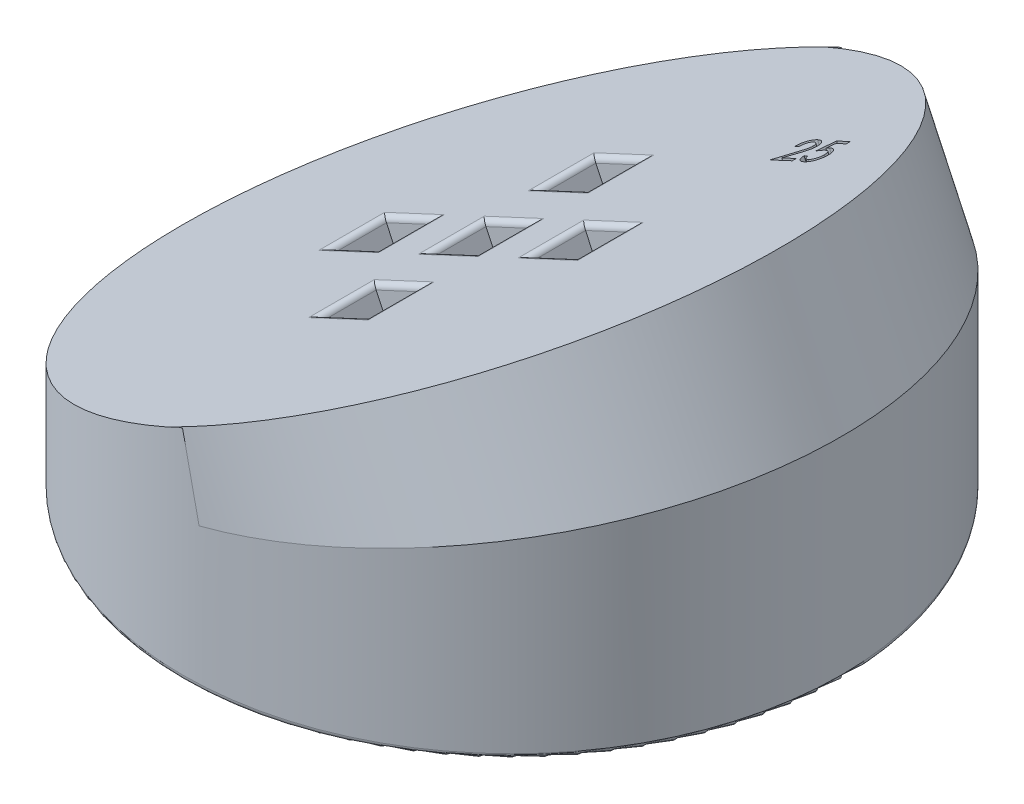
ISO-10303-21;
HEADER;
FILE_DESCRIPTION(('STEP AP214'),'2;1');
FILE_NAME('part.step','',(''),(''),'','','');
FILE_SCHEMA(('AUTOMOTIVE_DESIGN { 1 0 10303 214 1 1 1 1 }'));
ENDSEC;
DATA;
#1=APPLICATION_CONTEXT('core data for automotive mechanical design processes');
#2=APPLICATION_PROTOCOL_DEFINITION('international standard','automotive_design',2000,#1);
#3=PRODUCT_CONTEXT('',#1,'mechanical');
#4=PRODUCT('Part','Part','',(#3));
#5=PRODUCT_RELATED_PRODUCT_CATEGORY('part','',(#4));
#6=PRODUCT_DEFINITION_FORMATION('','',#4);
#7=PRODUCT_DEFINITION_CONTEXT('part definition',#1,'design');
#8=PRODUCT_DEFINITION('design','',#6,#7);
#9=PRODUCT_DEFINITION_SHAPE('','',#8);
#10=(LENGTH_UNIT() NAMED_UNIT(*) SI_UNIT(.MILLI.,.METRE.));
#11=(NAMED_UNIT(*) PLANE_ANGLE_UNIT() SI_UNIT($,.RADIAN.));
#12=(NAMED_UNIT(*) SI_UNIT($,.STERADIAN.) SOLID_ANGLE_UNIT());
#13=UNCERTAINTY_MEASURE_WITH_UNIT(LENGTH_MEASURE(1.E-05),#10,'distance_accuracy_value','');
#14=(GEOMETRIC_REPRESENTATION_CONTEXT(3) GLOBAL_UNCERTAINTY_ASSIGNED_CONTEXT((#13)) GLOBAL_UNIT_ASSIGNED_CONTEXT((#10,
#11,#12)) REPRESENTATION_CONTEXT('',''));
#15=CARTESIAN_POINT('',(0.,0.,0.));
#16=DIRECTION('',(0.,0.,1.));
#17=DIRECTION('',(1.,0.,0.));
#18=AXIS2_PLACEMENT_3D('',#15,#16,#17);
#19=CARTESIAN_POINT('',(-30.,6.,-41.5));
#20=DIRECTION('',(0.422618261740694,-0.906307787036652,0.));
#21=DIRECTION('',(0.906307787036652,0.422618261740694,0.));
#22=AXIS2_PLACEMENT_3D('',#19,#20,#21);
#23=PLANE('',#22);
#24=CARTESIAN_POINT('',(11.5888330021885,25.3931913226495,-15.844098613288));
#25=CARTESIAN_POINT('',(11.5701688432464,25.3844880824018,-15.8436762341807));
#26=CARTESIAN_POINT('',(11.5334515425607,25.3673665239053,-15.842845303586));
#27=CARTESIAN_POINT('',(11.4793762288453,25.3421507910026,-15.8342720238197));
#28=CARTESIAN_POINT('',(11.4274706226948,25.3179468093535,-15.8203130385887));
#29=CARTESIAN_POINT('',(11.3775596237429,25.2946729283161,-15.8009506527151));
#30=CARTESIAN_POINT('',(11.3292817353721,25.2721605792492,-15.7770630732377));
#31=CARTESIAN_POINT('',(11.2838174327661,25.2509602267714,-15.7461167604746));
#32=CARTESIAN_POINT('',(11.2404236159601,25.2307253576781,-15.7101166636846));
#33=CARTESIAN_POINT('',(11.1985266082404,25.2111884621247,-15.6697119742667));
#34=CARTESIAN_POINT('',(11.1603954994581,25.1934076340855,-15.6223092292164));
#35=CARTESIAN_POINT('',(11.126290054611,25.1775040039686,-15.5684701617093));
#36=CARTESIAN_POINT('',(11.0961736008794,25.163460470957,-15.5081361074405));
#37=CARTESIAN_POINT('',(11.0704314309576,25.151456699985,-15.44141261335));
#38=CARTESIAN_POINT('',(11.0490976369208,25.1415085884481,-15.368124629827));
#39=CARTESIAN_POINT('',(11.0319837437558,25.1335282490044,-15.2883612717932));
#40=CARTESIAN_POINT('',(11.0187530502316,25.1273586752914,-15.2020878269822));
#41=CARTESIAN_POINT('',(11.0134181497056,25.1248709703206,-15.142192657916));
#42=CARTESIAN_POINT('',(11.0106759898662,25.1235922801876,-15.1114063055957));
#43=B_SPLINE_CURVE_WITH_KNOTS('',3,(#24,#25,#26,#27,#28,#29,#30,#31,#32,#33,#34,#35,#36,#37,#38,
#39,#40,#41,#42),.UNSPECIFIED.,.F.,.F.,(4,1,1,1,1,1,1,1,1,1,1,1,1,1,1,1,4),(0.,
0.0569713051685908,0.112077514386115,0.166447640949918,0.219897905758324,0.273467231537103,
0.3277137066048,0.382641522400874,0.439172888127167,0.497361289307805,0.557599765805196,
0.620640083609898,0.687678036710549,0.758012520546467,0.833449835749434,0.914392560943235,1.),.UNSPECIFIED.);
#44=CARTESIAN_POINT('',(11.5888330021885,25.3931913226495,-15.844098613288));
#45=VERTEX_POINT('',#44);
#46=CARTESIAN_POINT('',(11.0106759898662,25.1235922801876,-15.1114063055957));
#47=VERTEX_POINT('',#46);
#48=EDGE_CURVE('E58',#45,#47,#43,.T.);
#49=ORIENTED_EDGE('',*,*,#48,.T.);
#50=DIRECTION('',(-0.906307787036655,-0.422618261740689,0.));
#51=VECTOR('',#50,1.);
#52=CARTESIAN_POINT('',(11.0106759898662,25.1235922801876,-15.1114063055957));
#53=LINE('',#52,#51);
#54=CARTESIAN_POINT('',(10.6457972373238,24.9534465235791,-15.1114063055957));
#55=VERTEX_POINT('',#54);
#56=EDGE_CURVE('E610',#47,#55,#53,.T.);
#57=ORIENTED_EDGE('',*,*,#56,.T.);
#58=CARTESIAN_POINT('',(10.6457972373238,24.9534465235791,-15.1114063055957));
#59=CARTESIAN_POINT('',(10.6475111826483,24.9542457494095,-15.1523729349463));
#60=CARTESIAN_POINT('',(10.6508634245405,24.9558089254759,-15.2324980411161));
#61=CARTESIAN_POINT('',(10.6657491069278,24.9627502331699,-15.3492492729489));
#62=CARTESIAN_POINT('',(10.689862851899,24.9739946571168,-15.4592587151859));
#63=CARTESIAN_POINT('',(10.7202994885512,24.9881874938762,-15.563458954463));
#64=CARTESIAN_POINT('',(10.7609011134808,25.0071203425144,-15.6605474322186));
#65=CARTESIAN_POINT('',(10.8077472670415,25.0289650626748,-15.7522166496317));
#66=CARTESIAN_POINT('',(10.864301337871,25.0553366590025,-15.8365454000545));
#67=CARTESIAN_POINT('',(10.9282105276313,25.0851380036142,-15.9136670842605));
#68=CARTESIAN_POINT('',(10.9975862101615,25.1174884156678,-15.9837351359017));
#69=CARTESIAN_POINT('',(11.0721653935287,25.1522652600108,-16.04415348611));
#70=CARTESIAN_POINT('',(11.1506874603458,25.1888807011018,-16.0956388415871));
#71=CARTESIAN_POINT('',(11.2331678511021,25.2273419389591,-16.1376512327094));
#72=CARTESIAN_POINT('',(11.3197680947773,25.2677242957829,-16.1701806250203));
#73=CARTESIAN_POINT('',(11.4102413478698,25.3099126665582,-16.1938514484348));
#74=CARTESIAN_POINT('',(11.5048762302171,25.3540416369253,-16.2080888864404));
#75=CARTESIAN_POINT('',(11.5693864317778,25.3841232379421,-16.2096522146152));
#76=CARTESIAN_POINT('',(11.6020908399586,25.3993735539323,-16.2104447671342));
#77=B_SPLINE_CURVE_WITH_KNOTS('',3,(#58,#59,#60,#61,#62,#63,#64,#65,#66,#67,#68,#69,#70,#71,#72,
#73,#74,#75,#76),.UNSPECIFIED.,.F.,.F.,(4,1,1,1,1,1,1,1,1,1,1,1,1,1,1,1,4),(0.,
0.0721852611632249,0.141184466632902,0.207190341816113,0.271289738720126,0.333603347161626,
0.395138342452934,0.456287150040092,0.517858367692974,0.578902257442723,0.638706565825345,
0.697285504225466,0.756078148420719,0.814867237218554,0.874716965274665,0.936485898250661,1.),.UNSPECIFIED.);
#78=CARTESIAN_POINT('',(11.6020908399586,25.3993735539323,-16.2104447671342));
#79=VERTEX_POINT('',#78);
#80=EDGE_CURVE('E2293',#55,#79,#77,.T.);
#81=ORIENTED_EDGE('',*,*,#80,.T.);
#82=CARTESIAN_POINT('',(11.6020908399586,25.3993735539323,-16.2104447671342));
#83=CARTESIAN_POINT('',(11.63633242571,25.4153406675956,-16.209671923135));
#84=CARTESIAN_POINT('',(11.7035238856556,25.4466725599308,-16.2081553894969));
#85=CARTESIAN_POINT('',(11.8013708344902,25.4922993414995,-16.1938846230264));
#86=CARTESIAN_POINT('',(11.8939740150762,25.5354809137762,-16.170873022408));
#87=CARTESIAN_POINT('',(11.9813605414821,25.5762299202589,-16.1394474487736));
#88=CARTESIAN_POINT('',(12.0633712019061,25.6144721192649,-16.0974861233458));
#89=CARTESIAN_POINT('',(12.1401677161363,25.6502829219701,-16.0468853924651));
#90=CARTESIAN_POINT('',(12.2110118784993,25.6833180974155,-15.9860651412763));
#91=CARTESIAN_POINT('',(12.2764178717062,25.7138174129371,-15.9180110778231));
#92=CARTESIAN_POINT('',(12.3341882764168,25.7407561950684,-15.8431510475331));
#93=CARTESIAN_POINT('',(12.3863668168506,25.765087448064,-15.766186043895));
#94=CARTESIAN_POINT('',(12.4294974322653,25.7851995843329,-15.6855551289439));
#95=CARTESIAN_POINT('',(12.4656300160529,25.8020484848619,-15.6027306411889));
#96=CARTESIAN_POINT('',(12.4934346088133,25.815013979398,-15.5170328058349));
#97=CARTESIAN_POINT('',(12.5130701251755,25.8241701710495,-15.4288103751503));
#98=CARTESIAN_POINT('',(12.5248399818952,25.8296585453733,-15.3380034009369));
#99=CARTESIAN_POINT('',(12.5264464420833,25.8304076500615,-15.2766006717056));
#100=CARTESIAN_POINT('',(12.5272573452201,25.8307857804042,-15.245606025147));
#101=B_SPLINE_CURVE_WITH_KNOTS('',3,(#82,#83,#84,#85,#86,#87,#88,#89,#90,#91,#92,#93,#94,#95,
#96,#97,#98,#99,#100),.UNSPECIFIED.,.F.,.F.,(4,1,1,1,1,1,1,1,1,1,1,1,1,1,1,1,4),(0.,
0.0722951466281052,0.141863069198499,0.208024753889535,0.272578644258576,0.335589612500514,
0.398578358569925,0.461082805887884,0.524813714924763,0.588114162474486,0.649073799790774,
0.708582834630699,0.767034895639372,0.824801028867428,0.882481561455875,0.940679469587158,1.),.UNSPECIFIED.);
#102=CARTESIAN_POINT('',(12.5272573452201,25.8307857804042,-15.245606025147));
#103=VERTEX_POINT('',#102);
#104=EDGE_CURVE('E2298',#79,#103,#101,.T.);
#105=ORIENTED_EDGE('',*,*,#104,.T.);
#106=CARTESIAN_POINT('',(12.5272573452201,25.8307857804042,-15.245606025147));
#107=CARTESIAN_POINT('',(12.5257817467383,25.8300976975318,-15.2022496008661));
#108=CARTESIAN_POINT('',(12.5228507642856,25.8287309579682,-15.116130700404));
#109=CARTESIAN_POINT('',(12.5002812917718,25.8182066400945,-14.9887227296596));
#110=CARTESIAN_POINT('',(12.4623393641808,25.8005140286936,-14.8654184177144));
#111=CARTESIAN_POINT('',(12.4185128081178,25.7800773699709,-14.7650163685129));
#112=CARTESIAN_POINT('',(12.3741875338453,25.7594081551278,-14.6838599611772));
#113=CARTESIAN_POINT('',(12.3335105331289,25.740440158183,-14.6168726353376));
#114=CARTESIAN_POINT('',(12.2857255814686,25.7181576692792,-14.5444390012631));
#115=CARTESIAN_POINT('',(12.2298079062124,25.692082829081,-14.4670439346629));
#116=CARTESIAN_POINT('',(12.1679810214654,25.6632524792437,-14.3829166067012));
#117=CARTESIAN_POINT('',(12.0977889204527,25.6305213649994,-14.2942272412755));
#118=CARTESIAN_POINT('',(12.0214041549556,25.5949025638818,-14.1991802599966));
#119=CARTESIAN_POINT('',(11.9669277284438,25.5694997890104,-14.1351800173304));
#120=CARTESIAN_POINT('',(11.9387246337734,25.5563484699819,-14.1020463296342));
#121=B_SPLINE_CURVE_WITH_KNOTS('',3,(#106,#107,#108,#109,#110,#111,#112,#113,#114,#115,#116,
#117,#118,#119,#120),.UNSPECIFIED.,.F.,.F.,(4,1,1,1,1,1,1,1,1,1,1,1,4),(0.,0.0963129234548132,
0.191306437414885,0.287260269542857,0.385041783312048,0.438291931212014,0.497750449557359,
0.56419160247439,0.637336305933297,0.717694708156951,0.8048808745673,0.898984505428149,1.),.UNSPECIFIED.);
#122=CARTESIAN_POINT('',(11.9387246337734,25.5563484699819,-14.1020463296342));
#123=VERTEX_POINT('',#122);
#124=EDGE_CURVE('E2306',#103,#123,#121,.T.);
#125=ORIENTED_EDGE('',*,*,#124,.T.);
#126=DIRECTION('',(-0.64059550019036,-0.29871458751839,0.707394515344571));
#127=VECTOR('',#126,1.);
#128=CARTESIAN_POINT('',(11.9387246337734,25.5563484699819,-14.1020463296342));
#129=LINE('',#128,#127);
#130=CARTESIAN_POINT('',(11.2308713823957,25.2262710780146,-13.3203806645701));
#131=VERTEX_POINT('',#130);
#132=EDGE_CURVE('E2314',#123,#131,#129,.T.);
#133=ORIENTED_EDGE('',*,*,#132,.T.);
#134=DIRECTION('',(0.906307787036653,0.422618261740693,0.));
#135=VECTOR('',#134,1.);
#136=CARTESIAN_POINT('',(11.2308713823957,25.2262710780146,-13.3203806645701));
#137=LINE('',#136,#135);
#138=CARTESIAN_POINT('',(12.5641487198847,25.8479885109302,-13.3203806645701));
#139=VERTEX_POINT('',#138);
#140=EDGE_CURVE('E2320',#131,#139,#137,.T.);
#141=ORIENTED_EDGE('',*,*,#140,.T.);
#142=DIRECTION('',(0.,0.,1.));
#143=VECTOR('',#142,1.);
#144=CARTESIAN_POINT('',(12.5641487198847,25.8479885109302,-13.3203806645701));
#145=LINE('',#144,#143);
#146=CARTESIAN_POINT('',(12.5641487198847,25.8479885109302,-12.9540345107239));
#147=VERTEX_POINT('',#146);
#148=EDGE_CURVE('E2323',#139,#147,#145,.T.);
#149=ORIENTED_EDGE('',*,*,#148,.T.);
#150=DIRECTION('',(-0.906307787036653,-0.422618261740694,0.));
#151=VECTOR('',#150,1.);
#152=CARTESIAN_POINT('',(12.5641487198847,25.8479885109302,-12.9540345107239));
#153=LINE('',#152,#151);
#154=CARTESIAN_POINT('',(10.5351231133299,24.9018383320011,-12.9540345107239));
#155=VERTEX_POINT('',#154);
#156=EDGE_CURVE('E2326',#147,#155,#153,.T.);
#157=ORIENTED_EDGE('',*,*,#156,.T.);
#158=DIRECTION('',(0.608379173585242,0.283691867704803,-0.74121097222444));
#159=VECTOR('',#158,1.);
#160=CARTESIAN_POINT('',(10.5351231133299,24.9018383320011,-12.9540345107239));
#161=LINE('',#160,#159);
#162=CARTESIAN_POINT('',(11.6361000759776,25.4152323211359,-14.2953956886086));
#163=VERTEX_POINT('',#162);
#164=EDGE_CURVE('E2329',#155,#163,#161,.T.);
#165=ORIENTED_EDGE('',*,*,#164,.T.);
#166=CARTESIAN_POINT('',(11.6361000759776,25.4152323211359,-14.2953956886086));
#167=CARTESIAN_POINT('',(11.6623238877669,25.4274606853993,-14.326254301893));
#168=CARTESIAN_POINT('',(11.7126478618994,25.4509271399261,-14.3854725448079));
#169=CARTESIAN_POINT('',(11.7835723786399,25.4839997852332,-14.4721585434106));
#170=CARTESIAN_POINT('',(11.8475621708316,25.5138387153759,-14.5522983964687));
#171=CARTESIAN_POINT('',(11.9049583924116,25.5406030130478,-14.6258342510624));
#172=CARTESIAN_POINT('',(11.9542580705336,25.5635918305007,-14.6937545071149));
#173=CARTESIAN_POINT('',(11.996787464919,25.5834236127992,-14.75505993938));
#174=CARTESIAN_POINT('',(12.0320651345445,25.5998738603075,-14.8100400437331));
#175=CARTESIAN_POINT('',(12.0687011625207,25.6169575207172,-14.8747562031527));
#176=CARTESIAN_POINT('',(12.1050037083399,25.6338856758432,-14.9523332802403));
#177=CARTESIAN_POINT('',(12.1358856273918,25.6482861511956,-15.0469664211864));
#178=CARTESIAN_POINT('',(12.1544162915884,25.6569271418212,-15.143607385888));
#179=CARTESIAN_POINT('',(12.1570338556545,25.6581477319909,-15.2086224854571));
#180=CARTESIAN_POINT('',(12.1583435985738,25.6587584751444,-15.2411539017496));
#181=B_SPLINE_CURVE_WITH_KNOTS('',3,(#166,#167,#168,#169,#170,#171,#172,#173,#174,#175,#176,
#177,#178,#179,#180),.UNSPECIFIED.,.F.,.F.,(4,1,1,1,1,1,1,1,1,1,1,1,4),(0.,0.11179670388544,
0.214539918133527,0.308625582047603,0.394072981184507,0.470989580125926,0.538563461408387,
0.598097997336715,0.648937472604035,0.74014971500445,0.828231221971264,0.914052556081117,1.),.UNSPECIFIED.);
#182=CARTESIAN_POINT('',(12.1583435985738,25.6587584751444,-15.2411539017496));
#183=VERTEX_POINT('',#182);
#184=EDGE_CURVE('E2332',#163,#183,#181,.T.);
#185=ORIENTED_EDGE('',*,*,#184,.T.);
#186=CARTESIAN_POINT('',(12.1583435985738,25.6587584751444,-15.2411539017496));
#187=CARTESIAN_POINT('',(12.1580208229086,25.6586079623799,-15.2613351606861));
#188=CARTESIAN_POINT('',(12.1573821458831,25.6583101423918,-15.3012678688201));
#189=CARTESIAN_POINT('',(12.148674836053,25.6542498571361,-15.3597445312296));
#190=CARTESIAN_POINT('',(12.1364090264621,25.6485302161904,-15.4164636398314));
#191=CARTESIAN_POINT('',(12.117438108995,25.6396839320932,-15.4705133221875));
#192=CARTESIAN_POINT('',(12.0945816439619,25.6290257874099,-15.5229569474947));
#193=CARTESIAN_POINT('',(12.0659922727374,25.6156943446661,-15.573116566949));
#194=CARTESIAN_POINT('',(12.0316615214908,25.5996856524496,-15.6205268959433));
#195=CARTESIAN_POINT('',(11.9934717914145,25.5818774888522,-15.6662546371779));
#196=CARTESIAN_POINT('',(11.9512329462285,25.5621811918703,-15.7075416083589));
#197=CARTESIAN_POINT('',(11.9066186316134,25.541377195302,-15.7445699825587));
#198=CARTESIAN_POINT('',(11.8590801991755,25.5192096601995,-15.7746418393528));
#199=CARTESIAN_POINT('',(11.8099174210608,25.4962846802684,-15.8009402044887));
#200=CARTESIAN_POINT('',(11.757602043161,25.4718896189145,-15.8195840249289));
#201=CARTESIAN_POINT('',(11.7034200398,25.4466241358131,-15.8334653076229));
#202=CARTESIAN_POINT('',(11.6469459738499,25.4202898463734,-15.8430811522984));
#203=CARTESIAN_POINT('',(11.6084651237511,25.40234593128,-15.8437548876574));
#204=CARTESIAN_POINT('',(11.5888330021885,25.3931913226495,-15.844098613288));
#205=B_SPLINE_CURVE_WITH_KNOTS('',3,(#186,#187,#188,#189,#190,#191,#192,#193,#194,#195,#196,
#197,#198,#199,#200,#201,#202,#203,#204),.UNSPECIFIED.,.F.,.F.,(4,1,1,1,1,1,1,1,1,1,1,1,1,1,1,1,
4),(0.,0.0624645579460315,0.123598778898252,0.183188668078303,0.242854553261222,
0.302791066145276,0.363304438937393,0.425993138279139,0.490604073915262,0.555743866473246,
0.618679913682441,0.681099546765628,0.742813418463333,0.80513618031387,0.868557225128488,
0.932940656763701,1.),.UNSPECIFIED.);
#206=EDGE_CURVE('E623',#183,#45,#205,.T.);
#207=ORIENTED_EDGE('',*,*,#206,.T.);
#208=EDGE_LOOP('',(#49,#57,#81,#105,#125,#133,#141,#149,#157,#165,#185,#207));
#209=FACE_BOUND('',#208,.T.);
#210=DIRECTION('',(-0.906307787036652,-0.422618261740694,0.));
#211=VECTOR('',#210,1.);
#212=CARTESIAN_POINT('',(-30.,6.,-3.));
#213=LINE('',#212,#211);
#214=CARTESIAN_POINT('',(-5.52968975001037,17.4106930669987,-3.));
#215=VERTEX_POINT('',#214);
#216=CARTESIAN_POINT('',(-0.0918430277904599,19.9464026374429,-3.));
#217=VERTEX_POINT('',#216);
#218=EDGE_CURVE('E1156',#215,#217,#213,.F.);
#219=ORIENTED_EDGE('',*,*,#218,.T.);
#220=DIRECTION('',(0.,0.,-1.));
#221=VECTOR('',#220,1.);
#222=CARTESIAN_POINT('',(-0.0918430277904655,19.9464026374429,-41.5));
#223=LINE('',#222,#221);
#224=CARTESIAN_POINT('',(-0.0918430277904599,19.9464026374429,3.));
#225=VERTEX_POINT('',#224);
#226=EDGE_CURVE('E1158',#217,#225,#223,.F.);
#227=ORIENTED_EDGE('',*,*,#226,.T.);
#228=DIRECTION('',(0.906307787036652,0.422618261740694,0.));
#229=VECTOR('',#228,1.);
#230=CARTESIAN_POINT('',(-30.,6.,3.00000000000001));
#231=LINE('',#230,#229);
#232=CARTESIAN_POINT('',(-5.52968975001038,17.4106930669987,3.));
#233=VERTEX_POINT('',#232);
#234=EDGE_CURVE('E1152',#225,#233,#231,.F.);
#235=ORIENTED_EDGE('',*,*,#234,.T.);
#236=DIRECTION('',(0.,0.,1.));
#237=VECTOR('',#236,1.);
#238=CARTESIAN_POINT('',(-5.52968975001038,17.4106930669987,-41.5));
#239=LINE('',#238,#237);
#240=EDGE_CURVE('E1154',#233,#215,#239,.F.);
#241=ORIENTED_EDGE('',*,*,#240,.T.);
#242=EDGE_LOOP('',(#219,#227,#235,#241));
#243=FACE_BOUND('',#242,.T.);
#244=DIRECTION('',(-0.906307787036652,-0.422618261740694,0.));
#245=VECTOR('',#244,1.);
#246=CARTESIAN_POINT('',(-30.,6.,7.00000000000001));
#247=LINE('',#246,#245);
#248=CARTESIAN_POINT('',(-5.52968975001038,17.4106930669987,7.));
#249=VERTEX_POINT('',#248);
#250=CARTESIAN_POINT('',(-0.0918430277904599,19.9464026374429,7.));
#251=VERTEX_POINT('',#250);
#252=EDGE_CURVE('E1129',#249,#251,#247,.F.);
#253=ORIENTED_EDGE('',*,*,#252,.T.);
#254=DIRECTION('',(0.,0.,-1.));
#255=VECTOR('',#254,1.);
#256=CARTESIAN_POINT('',(-0.0918430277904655,19.9464026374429,-41.5));
#257=LINE('',#256,#255);
#258=CARTESIAN_POINT('',(-0.0918430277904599,19.9464026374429,13.));
#259=VERTEX_POINT('',#258);
#260=EDGE_CURVE('E1131',#251,#259,#257,.F.);
#261=ORIENTED_EDGE('',*,*,#260,.T.);
#262=DIRECTION('',(0.906307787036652,0.422618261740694,0.));
#263=VECTOR('',#262,1.);
#264=CARTESIAN_POINT('',(-30.,6.,13.));
#265=LINE('',#264,#263);
#266=CARTESIAN_POINT('',(-5.52968975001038,17.4106930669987,13.));
#267=VERTEX_POINT('',#266);
#268=EDGE_CURVE('E1125',#259,#267,#265,.F.);
#269=ORIENTED_EDGE('',*,*,#268,.T.);
#270=DIRECTION('',(0.,0.,1.));
#271=VECTOR('',#270,1.);
#272=CARTESIAN_POINT('',(-5.52968975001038,17.4106930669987,-41.5));
#273=LINE('',#272,#271);
#274=EDGE_CURVE('E1127',#267,#249,#273,.F.);
#275=ORIENTED_EDGE('',*,*,#274,.T.);
#276=EDGE_LOOP('',(#253,#261,#269,#275));
#277=FACE_BOUND('',#276,.T.);
#278=DIRECTION('',(-0.906307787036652,-0.422618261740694,0.));
#279=VECTOR('',#278,1.);
#280=CARTESIAN_POINT('',(-30.,6.,-3.));
#281=LINE('',#280,#279);
#282=CARTESIAN_POINT('',(-14.5927676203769,13.1845104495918,-3.));
#283=VERTEX_POINT('',#282);
#284=CARTESIAN_POINT('',(-9.15492089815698,15.720220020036,-3.));
#285=VERTEX_POINT('',#284);
#286=EDGE_CURVE('E1101',#283,#285,#281,.F.);
#287=ORIENTED_EDGE('',*,*,#286,.T.);
#288=DIRECTION('',(0.,0.,-1.));
#289=VECTOR('',#288,1.);
#290=CARTESIAN_POINT('',(-9.15492089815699,15.720220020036,-41.5));
#291=LINE('',#290,#289);
#292=CARTESIAN_POINT('',(-9.15492089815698,15.720220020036,3.));
#293=VERTEX_POINT('',#292);
#294=EDGE_CURVE('E1103',#285,#293,#291,.F.);
#295=ORIENTED_EDGE('',*,*,#294,.T.);
#296=DIRECTION('',(0.906307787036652,0.422618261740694,0.));
#297=VECTOR('',#296,1.);
#298=CARTESIAN_POINT('',(-30.,6.,3.));
#299=LINE('',#298,#297);
#300=CARTESIAN_POINT('',(-14.5927676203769,13.1845104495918,3.));
#301=VERTEX_POINT('',#300);
#302=EDGE_CURVE('E1097',#293,#301,#299,.F.);
#303=ORIENTED_EDGE('',*,*,#302,.T.);
#304=DIRECTION('',(0.,0.,1.));
#305=VECTOR('',#304,1.);
#306=CARTESIAN_POINT('',(-14.5927676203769,13.1845104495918,-41.5));
#307=LINE('',#306,#305);
#308=EDGE_CURVE('E1099',#301,#283,#307,.F.);
#309=ORIENTED_EDGE('',*,*,#308,.T.);
#310=EDGE_LOOP('',(#287,#295,#303,#309));
#311=FACE_BOUND('',#310,.T.);
#312=DIRECTION('',(-0.906307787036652,-0.422618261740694,0.));
#313=VECTOR('',#312,1.);
#314=CARTESIAN_POINT('',(-30.,6.,-3.));
#315=LINE('',#314,#313);
#316=CARTESIAN_POINT('',(3.53338812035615,21.6368756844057,-3.));
#317=VERTEX_POINT('',#316);
#318=CARTESIAN_POINT('',(8.97123484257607,24.1725852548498,-3.));
#319=VERTEX_POINT('',#318);
#320=EDGE_CURVE('E1073',#317,#319,#315,.F.);
#321=ORIENTED_EDGE('',*,*,#320,.T.);
#322=DIRECTION('',(0.,0.,-1.));
#323=VECTOR('',#322,1.);
#324=CARTESIAN_POINT('',(8.97123484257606,24.1725852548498,-41.5));
#325=LINE('',#324,#323);
#326=CARTESIAN_POINT('',(8.97123484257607,24.1725852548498,3.));
#327=VERTEX_POINT('',#326);
#328=EDGE_CURVE('E1075',#319,#327,#325,.F.);
#329=ORIENTED_EDGE('',*,*,#328,.T.);
#330=DIRECTION('',(0.906307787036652,0.422618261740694,0.));
#331=VECTOR('',#330,1.);
#332=CARTESIAN_POINT('',(-30.,6.,3.00000000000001));
#333=LINE('',#332,#331);
#334=CARTESIAN_POINT('',(3.53338812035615,21.6368756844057,3.));
#335=VERTEX_POINT('',#334);
#336=EDGE_CURVE('E1069',#327,#335,#333,.F.);
#337=ORIENTED_EDGE('',*,*,#336,.T.);
#338=DIRECTION('',(0.,0.,1.));
#339=VECTOR('',#338,1.);
#340=CARTESIAN_POINT('',(3.53338812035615,21.6368756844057,-41.5));
#341=LINE('',#340,#339);
#342=EDGE_CURVE('E1071',#335,#317,#341,.F.);
#343=ORIENTED_EDGE('',*,*,#342,.T.);
#344=EDGE_LOOP('',(#321,#329,#337,#343));
#345=FACE_BOUND('',#344,.T.);
#346=DIRECTION('',(-0.906307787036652,-0.422618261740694,0.));
#347=VECTOR('',#346,1.);
#348=CARTESIAN_POINT('',(-30.,6.,-13.));
#349=LINE('',#348,#347);
#350=CARTESIAN_POINT('',(-5.52968975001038,17.4106930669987,-13.));
#351=VERTEX_POINT('',#350);
#352=CARTESIAN_POINT('',(-0.0918430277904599,19.9464026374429,-13.));
#353=VERTEX_POINT('',#352);
#354=EDGE_CURVE('E1045',#351,#353,#349,.F.);
#355=ORIENTED_EDGE('',*,*,#354,.T.);
#356=DIRECTION('',(0.,0.,-1.));
#357=VECTOR('',#356,1.);
#358=CARTESIAN_POINT('',(-0.0918430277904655,19.9464026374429,-41.5));
#359=LINE('',#358,#357);
#360=CARTESIAN_POINT('',(-0.0918430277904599,19.9464026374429,-7.));
#361=VERTEX_POINT('',#360);
#362=EDGE_CURVE('E1047',#353,#361,#359,.F.);
#363=ORIENTED_EDGE('',*,*,#362,.T.);
#364=DIRECTION('',(0.906307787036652,0.422618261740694,0.));
#365=VECTOR('',#364,1.);
#366=CARTESIAN_POINT('',(-30.,6.,-6.99999999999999));
#367=LINE('',#366,#365);
#368=CARTESIAN_POINT('',(-5.52968975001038,17.4106930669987,-7.));
#369=VERTEX_POINT('',#368);
#370=EDGE_CURVE('E1041',#361,#369,#367,.F.);
#371=ORIENTED_EDGE('',*,*,#370,.T.);
#372=DIRECTION('',(0.,0.,1.));
#373=VECTOR('',#372,1.);
#374=CARTESIAN_POINT('',(-5.52968975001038,17.4106930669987,-41.5));
#375=LINE('',#374,#373);
#376=EDGE_CURVE('E1043',#369,#351,#375,.F.);
#377=ORIENTED_EDGE('',*,*,#376,.T.);
#378=EDGE_LOOP('',(#355,#363,#371,#377));
#379=FACE_BOUND('',#378,.T.);
#380=CARTESIAN_POINT('',(-2.81076638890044,18.6785478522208,0.));
#381=DIRECTION('',(-0.422618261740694,0.906307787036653,0.));
#382=DIRECTION('',(-0.906307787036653,-0.422618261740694,0.));
#383=AXIS2_PLACEMENT_3D('',#380,#381,#382);
#384=CIRCLE('',#383,30.);
#385=CARTESIAN_POINT('',(-1.4744557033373,19.3016797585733,29.9637444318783));
#386=VERTEX_POINT('',#385);
#387=CARTESIAN_POINT('',(-1.4744557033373,19.3016797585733,-29.9637444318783));
#388=VERTEX_POINT('',#387);
#389=EDGE_CURVE('E652',#386,#388,#384,.T.);
#390=ORIENTED_EDGE('',*,*,#389,.T.);
#391=CARTESIAN_POINT('',(0.,19.9892297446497,0.));
#392=DIRECTION('',(0.422618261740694,-0.906307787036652,0.));
#393=DIRECTION('',(-0.906307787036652,-0.422618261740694,0.));
#394=AXIS2_PLACEMENT_3D('',#391,#392,#393);
#395=ELLIPSE('',#394,33.1013375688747,30.);
#396=EDGE_CURVE('E1038',#386,#388,#395,.T.);
#397=ORIENTED_EDGE('',*,*,#396,.F.);
#398=EDGE_LOOP('',(#390,#397));
#399=FACE_BOUND('',#398,.T.);
#400=DIRECTION('',(0.906307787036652,0.422618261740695,0.));
#401=VECTOR('',#400,1.);
#402=CARTESIAN_POINT('',(13.4195674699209,26.2468768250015,-16.1290345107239));
#403=LINE('',#402,#401);
#404=CARTESIAN_POINT('',(13.4195674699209,26.2468768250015,-16.1290345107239));
#405=VERTEX_POINT('',#404);
#406=CARTESIAN_POINT('',(14.6669570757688,26.8285441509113,-16.1290345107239));
#407=VERTEX_POINT('',#406);
#408=EDGE_CURVE('E50',#405,#407,#403,.T.);
#409=ORIENTED_EDGE('',*,*,#408,.T.);
#410=DIRECTION('',(0.,0.,1.));
#411=VECTOR('',#410,1.);
#412=CARTESIAN_POINT('',(14.6669570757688,26.8285441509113,-16.1290345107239));
#413=LINE('',#412,#411);
#414=CARTESIAN_POINT('',(14.6669570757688,26.8285441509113,-15.7626883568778));
#415=VERTEX_POINT('',#414);
#416=EDGE_CURVE('E607',#407,#415,#413,.T.);
#417=ORIENTED_EDGE('',*,*,#416,.T.);
#418=DIRECTION('',(-0.906307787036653,-0.422618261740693,0.));
#419=VECTOR('',#418,1.);
#420=CARTESIAN_POINT('',(14.6669570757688,26.8285441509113,-15.7626883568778));
#421=LINE('',#420,#419);
#422=CARTESIAN_POINT('',(13.7216155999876,26.3877241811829,-15.7626883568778));
#423=VERTEX_POINT('',#422);
#424=EDGE_CURVE('E2102',#415,#423,#421,.T.);
#425=ORIENTED_EDGE('',*,*,#424,.T.);
#426=DIRECTION('',(-0.200243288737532,-0.0933749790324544,0.97528649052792));
#427=VECTOR('',#426,1.);
#428=CARTESIAN_POINT('',(13.7216155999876,26.3877241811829,-15.7626883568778));
#429=LINE('',#428,#427);
#430=CARTESIAN_POINT('',(13.5671329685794,26.3156877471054,-15.0102795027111));
#431=VERTEX_POINT('',#430);
#432=EDGE_CURVE('E2105',#423,#431,#429,.T.);
#433=ORIENTED_EDGE('',*,*,#432,.T.);
#434=CARTESIAN_POINT('',(13.5671329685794,26.3156877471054,-15.0102795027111));
#435=CARTESIAN_POINT('',(13.5851553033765,26.3240916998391,-15.0198629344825));
#436=CARTESIAN_POINT('',(13.6222454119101,26.3413871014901,-15.0395857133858));
#437=CARTESIAN_POINT('',(13.6842544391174,26.3703023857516,-15.0567702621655));
#438=CARTESIAN_POINT('',(13.7515785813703,26.4016961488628,-15.0688612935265));
#439=CARTESIAN_POINT('',(13.7986121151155,26.4236282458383,-15.0700717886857));
#440=CARTESIAN_POINT('',(13.8230668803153,26.4350316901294,-15.0707011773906));
#441=B_SPLINE_CURVE_WITH_KNOTS('',3,(#434,#435,#436,#437,#438,#439,#440),.UNSPECIFIED.,.F.,.F.,
(4,1,1,1,4),(0.,0.22664444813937,0.466436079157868,0.722577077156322,1.),.UNSPECIFIED.);
#442=CARTESIAN_POINT('',(13.8230668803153,26.4350316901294,-15.0707011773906));
#443=VERTEX_POINT('',#442);
#444=EDGE_CURVE('E2108',#431,#443,#441,.T.);
#445=ORIENTED_EDGE('',*,*,#444,.T.);
#446=CARTESIAN_POINT('',(13.8230668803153,26.4350316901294,-15.0707011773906));
#447=CARTESIAN_POINT('',(13.8577022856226,26.4511824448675,-15.0700014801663));
#448=CARTESIAN_POINT('',(13.9257031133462,26.4828917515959,-15.0686277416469));
#449=CARTESIAN_POINT('',(14.0248088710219,26.5291055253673,-15.0532767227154));
#450=CARTESIAN_POINT('',(14.1192472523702,26.5731428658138,-15.0302788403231));
#451=CARTESIAN_POINT('',(14.2082413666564,26.6146415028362,-14.9959702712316));
#452=CARTESIAN_POINT('',(14.2928075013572,26.6540753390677,-14.953734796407));
#453=CARTESIAN_POINT('',(14.3720282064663,26.6910165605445,-14.9008832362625));
#454=CARTESIAN_POINT('',(14.4458212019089,26.7254267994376,-14.8383121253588));
#455=CARTESIAN_POINT('',(14.5140877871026,26.7572600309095,-14.7670868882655));
#456=CARTESIAN_POINT('',(14.576306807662,26.7862732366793,-14.6895055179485));
#457=CARTESIAN_POINT('',(14.6297445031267,26.8111916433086,-14.6057251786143));
#458=CARTESIAN_POINT('',(14.6760658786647,26.8327916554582,-14.5181933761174));
#459=CARTESIAN_POINT('',(14.7127826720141,26.84991297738,-14.4253974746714));
#460=CARTESIAN_POINT('',(14.741792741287,26.8634405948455,-14.3282973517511));
#461=CARTESIAN_POINT('',(14.7624239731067,26.8730610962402,-14.2264871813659));
#462=CARTESIAN_POINT('',(14.7755398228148,26.8791771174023,-14.1202720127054));
#463=CARTESIAN_POINT('',(14.7769277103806,26.8798243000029,-14.0478200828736));
#464=CARTESIAN_POINT('',(14.7776311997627,26.8801523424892,-14.0110958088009));
#465=B_SPLINE_CURVE_WITH_KNOTS('',3,(#446,#447,#448,#449,#450,#451,#452,#453,#454,#455,#456,
#457,#458,#459,#460,#461,#462,#463,#464),.UNSPECIFIED.,.F.,.F.,(4,1,1,1,1,1,1,1,1,1,1,1,1,1,1,1,
4),(0.,0.0684308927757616,0.134352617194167,0.197478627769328,0.259348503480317,
0.320372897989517,0.380701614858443,0.441942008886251,0.504021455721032,0.566203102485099,
0.627233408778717,0.687310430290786,0.747520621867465,0.808306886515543,0.870237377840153,
0.934226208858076,1.),.UNSPECIFIED.);
#466=CARTESIAN_POINT('',(14.7776311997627,26.8801523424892,-14.0110958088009));
#467=VERTEX_POINT('',#466);
#468=EDGE_CURVE('E2113',#443,#467,#465,.T.);
#469=ORIENTED_EDGE('',*,*,#468,.T.);
#470=CARTESIAN_POINT('',(14.7776311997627,26.8801523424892,-14.0110958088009));
#471=CARTESIAN_POINT('',(14.7770902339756,26.8799000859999,-13.9854337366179));
#472=CARTESIAN_POINT('',(14.7760201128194,26.8794010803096,-13.9346698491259));
#473=CARTESIAN_POINT('',(14.7704438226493,26.8768008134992,-13.859187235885));
#474=CARTESIAN_POINT('',(14.7597997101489,26.871837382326,-13.7853328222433));
#475=CARTESIAN_POINT('',(14.7456671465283,26.8652472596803,-13.7125361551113));
#476=CARTESIAN_POINT('',(14.7261935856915,26.8561665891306,-13.6414213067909));
#477=CARTESIAN_POINT('',(14.704025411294,26.8458293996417,-13.571042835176));
#478=CARTESIAN_POINT('',(14.6767900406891,26.833129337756,-13.5025227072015));
#479=CARTESIAN_POINT('',(14.6456964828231,26.8186301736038,-13.4358894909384));
#480=CARTESIAN_POINT('',(14.6111984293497,26.8025434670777,-13.3716308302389));
#481=CARTESIAN_POINT('',(14.5732144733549,26.7848312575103,-13.3105262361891));
#482=CARTESIAN_POINT('',(14.5316578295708,26.7654530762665,-13.2530642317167));
#483=CARTESIAN_POINT('',(14.4863810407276,26.7443401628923,-13.1997257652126));
#484=CARTESIAN_POINT('',(14.4386217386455,26.7220696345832,-13.1491390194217));
#485=CARTESIAN_POINT('',(14.3871340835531,26.6980605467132,-13.1026242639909));
#486=CARTESIAN_POINT('',(14.3320643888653,26.6723811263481,-13.0599861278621));
#487=CARTESIAN_POINT('',(14.2741981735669,26.645397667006,-13.0207585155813));
#488=CARTESIAN_POINT('',(14.2135631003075,26.6171230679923,-12.9853193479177));
#489=CARTESIAN_POINT('',(14.1498028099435,26.5873911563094,-12.9559764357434));
#490=CARTESIAN_POINT('',(14.0845001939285,26.5569400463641,-12.9293157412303));
#491=CARTESIAN_POINT('',(14.0160401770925,26.525016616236,-12.9093530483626));
#492=CARTESIAN_POINT('',(13.9457136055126,26.4922227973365,-12.8925552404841));
#493=CARTESIAN_POINT('',(13.8726764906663,26.4581650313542,-12.8814076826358));
#494=CARTESIAN_POINT('',(13.7974408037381,26.4230820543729,-12.8741397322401));
#495=CARTESIAN_POINT('',(13.7464164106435,26.3992889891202,-12.873135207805));
#496=CARTESIAN_POINT('',(13.7204627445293,26.387186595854,-12.8726242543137));
#497=B_SPLINE_CURVE_WITH_KNOTS('',3,(#470,#471,#472,#473,#474,#475,#476,#477,#478,#479,#480,
#481,#482,#483,#484,#485,#486,#487,#488,#489,#490,#491,#492,#493,#494,#495,#496),.UNSPECIFIED.,
.F.,.F.,(4,1,1,1,1,1,1,1,1,1,1,1,1,1,1,1,1,1,1,1,1,1,1,1,4),(0.,0.0421781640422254,
0.0834354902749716,0.124332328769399,0.164992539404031,0.205670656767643,0.246330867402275,
0.287365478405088,0.328500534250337,0.369428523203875,0.41001553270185,0.450169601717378,
0.490105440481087,0.530026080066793,0.570128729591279,0.610628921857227,0.651917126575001,
0.693212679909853,0.73488711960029,0.777094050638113,0.819352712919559,0.86315152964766,
0.907494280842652,0.952946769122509,1.),.UNSPECIFIED.);
#498=CARTESIAN_POINT('',(13.7204627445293,26.387186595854,-12.8726242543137));
#499=VERTEX_POINT('',#498);
#500=EDGE_CURVE('E2121',#467,#499,#497,.T.);
#501=ORIENTED_EDGE('',*,*,#500,.T.);
#502=CARTESIAN_POINT('',(13.7204627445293,26.387186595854,-12.8726242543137));
#503=CARTESIAN_POINT('',(13.6912312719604,26.373555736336,-12.8733985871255));
#504=CARTESIAN_POINT('',(13.6335636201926,26.3466648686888,-12.8749261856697));
#505=CARTESIAN_POINT('',(13.5488668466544,26.3071701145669,-12.8857610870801));
#506=CARTESIAN_POINT('',(13.467614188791,26.2692813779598,-12.9041447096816));
#507=CARTESIAN_POINT('',(13.3901499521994,26.233159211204,-12.9304606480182));
#508=CARTESIAN_POINT('',(13.3158977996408,26.1985348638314,-12.9634681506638));
#509=CARTESIAN_POINT('',(13.2454907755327,26.1657035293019,-13.0043003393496));
#510=CARTESIAN_POINT('',(13.1786552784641,26.1345376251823,-13.0525907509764));
#511=CARTESIAN_POINT('',(13.1153052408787,26.1049970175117,-13.107418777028));
#512=CARTESIAN_POINT('',(13.0575275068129,26.0780548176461,-13.1699629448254));
#513=CARTESIAN_POINT('',(13.0042691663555,26.0532200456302,-13.237293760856));
#514=CARTESIAN_POINT('',(12.9588926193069,26.0320606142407,-13.3118901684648));
#515=CARTESIAN_POINT('',(12.9189750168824,26.013446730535,-13.3916935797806));
#516=CARTESIAN_POINT('',(12.8846769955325,25.99745330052,-13.4773530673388));
#517=CARTESIAN_POINT('',(12.8573911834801,25.984729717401,-13.5690310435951));
#518=CARTESIAN_POINT('',(12.8355729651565,25.9745557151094,-13.6663803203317));
#519=CARTESIAN_POINT('',(12.826852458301,25.9704892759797,-13.7336837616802));
#520=CARTESIAN_POINT('',(12.8223883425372,25.9684076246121,-13.7681370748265));
#521=B_SPLINE_CURVE_WITH_KNOTS('',3,(#502,#503,#504,#505,#506,#507,#508,#509,#510,#511,#512,
#513,#514,#515,#516,#517,#518,#519,#520),.UNSPECIFIED.,.F.,.F.,(4,1,1,1,1,1,1,1,1,1,1,1,1,1,1,1,
4),(0.,0.065598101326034,0.129411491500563,0.191065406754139,0.251494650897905,
0.311073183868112,0.370482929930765,0.429688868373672,0.490167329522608,0.550854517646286,
0.611098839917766,0.671620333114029,0.733191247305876,0.796329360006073,0.861785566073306,
0.929246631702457,1.),.UNSPECIFIED.);
#522=CARTESIAN_POINT('',(12.8223883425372,25.9684076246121,-13.7681370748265));
#523=VERTEX_POINT('',#522);
#524=EDGE_CURVE('E2129',#499,#523,#521,.T.);
#525=ORIENTED_EDGE('',*,*,#524,.T.);
#526=DIRECTION('',(0.906307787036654,0.422618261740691,0.));
#527=VECTOR('',#526,1.);
#528=CARTESIAN_POINT('',(12.8223883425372,25.9684076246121,-13.7681370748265));
#529=LINE('',#528,#527);
#530=CARTESIAN_POINT('',(13.1826556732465,26.1364030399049,-13.7681370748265));
#531=VERTEX_POINT('',#530);
#532=EDGE_CURVE('E2137',#523,#531,#529,.T.);
#533=ORIENTED_EDGE('',*,*,#532,.T.);
#534=CARTESIAN_POINT('',(13.1826556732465,26.1364030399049,-13.7681370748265));
#535=CARTESIAN_POINT('',(13.1895123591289,26.1396003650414,-13.7348634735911));
#536=CARTESIAN_POINT('',(13.2023839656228,26.1456024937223,-13.6724011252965));
#537=CARTESIAN_POINT('',(13.23003589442,26.1584967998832,-13.5872919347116));
#538=CARTESIAN_POINT('',(13.2596726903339,26.172316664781,-13.5149058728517));
#539=CARTESIAN_POINT('',(13.2959211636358,26.1892196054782,-13.4557066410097));
#540=CARTESIAN_POINT('',(13.3375252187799,26.2086198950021,-13.4071132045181));
#541=CARTESIAN_POINT('',(13.3837027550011,26.2301528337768,-13.3649327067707));
#542=CARTESIAN_POINT('',(13.4344345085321,26.25380943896,-13.3270958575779));
#543=CARTESIAN_POINT('',(13.4902849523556,26.2798529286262,-13.2956880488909));
#544=CARTESIAN_POINT('',(13.5491295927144,26.3072926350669,-13.2702426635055));
#545=CARTESIAN_POINT('',(13.6102711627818,26.3358034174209,-13.252483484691));
#546=CARTESIAN_POINT('',(13.6724748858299,26.364809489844,-13.2413166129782));
#547=CARTESIAN_POINT('',(13.7144687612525,26.3843915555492,-13.2397520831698));
#548=CARTESIAN_POINT('',(13.7354498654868,26.3941752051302,-13.2389704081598));
#549=B_SPLINE_CURVE_WITH_KNOTS('',3,(#534,#535,#536,#537,#538,#539,#540,#541,#542,#543,#544,
#545,#546,#547,#548),.UNSPECIFIED.,.F.,.F.,(4,1,1,1,1,1,1,1,1,1,1,1,4),(0.,0.115454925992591,
0.216735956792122,0.305701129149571,0.383765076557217,0.457425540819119,0.531337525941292,
0.607408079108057,0.685762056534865,0.765096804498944,0.843121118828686,0.921619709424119,1.),.UNSPECIFIED.);
#550=CARTESIAN_POINT('',(13.7354498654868,26.3941752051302,-13.2389704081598));
#551=VERTEX_POINT('',#550);
#552=EDGE_CURVE('E2143',#531,#551,#549,.T.);
#553=ORIENTED_EDGE('',*,*,#552,.T.);
#554=CARTESIAN_POINT('',(13.7354498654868,26.3941752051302,-13.2389704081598));
#555=CARTESIAN_POINT('',(13.7581466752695,26.4047589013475,-13.2398111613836));
#556=CARTESIAN_POINT('',(13.802957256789,26.4256544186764,-13.2414710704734));
#557=CARTESIAN_POINT('',(13.8689704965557,26.4564368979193,-13.2514081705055));
#558=CARTESIAN_POINT('',(13.9321036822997,26.4858763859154,-13.2697891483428));
#559=CARTESIAN_POINT('',(13.993268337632,26.5143979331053,-13.2936142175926));
#560=CARTESIAN_POINT('',(14.0513961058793,26.5415033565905,-13.3260649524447));
#561=CARTESIAN_POINT('',(14.1079137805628,26.5678579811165,-13.3639553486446));
#562=CARTESIAN_POINT('',(14.1607604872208,26.5925008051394,-13.4104836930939));
#563=CARTESIAN_POINT('',(14.2114132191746,26.6161205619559,-13.4622177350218));
#564=CARTESIAN_POINT('',(14.2578060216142,26.6377538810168,-13.5195213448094));
#565=CARTESIAN_POINT('',(14.2982026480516,26.6565911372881,-13.5814353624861));
#566=CARTESIAN_POINT('',(14.3326627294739,26.672660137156,-13.6467165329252));
#567=CARTESIAN_POINT('',(14.3601244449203,26.6854657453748,-13.7157990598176));
#568=CARTESIAN_POINT('',(14.3824119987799,26.695858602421,-13.7880499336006));
#569=CARTESIAN_POINT('',(14.3977315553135,26.7030022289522,-13.8639626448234));
#570=CARTESIAN_POINT('',(14.4072893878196,26.7074591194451,-13.9433786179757));
#571=CARTESIAN_POINT('',(14.4082351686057,26.7079001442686,-13.9974933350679));
#572=CARTESIAN_POINT('',(14.4087174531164,26.7081250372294,-14.0250881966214));
#573=B_SPLINE_CURVE_WITH_KNOTS('',3,(#554,#555,#556,#557,#558,#559,#560,#561,#562,#563,#564,
#565,#566,#567,#568,#569,#570,#571,#572),.UNSPECIFIED.,.F.,.F.,(4,1,1,1,1,1,1,1,1,1,1,1,1,1,1,1,
4),(0.,0.0623438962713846,0.12308629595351,0.182468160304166,0.241388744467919,
0.300854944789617,0.361037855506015,0.422681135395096,0.486149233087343,0.550432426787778,
0.613550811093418,0.675727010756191,0.738088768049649,0.800995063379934,0.865382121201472,
0.9313539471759,1.),.UNSPECIFIED.);
#574=CARTESIAN_POINT('',(14.4087174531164,26.7081250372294,-14.0250881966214));
#575=VERTEX_POINT('',#574);
#576=EDGE_CURVE('E2148',#551,#575,#573,.T.);
#577=ORIENTED_EDGE('',*,*,#576,.T.);
#578=CARTESIAN_POINT('',(14.4087174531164,26.7081250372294,-14.0250881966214));
#579=CARTESIAN_POINT('',(14.4081440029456,26.7078576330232,-14.0497091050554));
#580=CARTESIAN_POINT('',(14.4070179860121,26.7073325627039,-14.0980542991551));
#581=CARTESIAN_POINT('',(14.3987696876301,26.7034863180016,-14.1687124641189));
#582=CARTESIAN_POINT('',(14.3856862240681,26.6973853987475,-14.2361116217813));
#583=CARTESIAN_POINT('',(14.3666748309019,26.6885202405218,-14.2996181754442));
#584=CARTESIAN_POINT('',(14.3422363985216,26.6771244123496,-14.3595835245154));
#585=CARTESIAN_POINT('',(14.3121846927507,26.663111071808,-14.415624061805));
#586=CARTESIAN_POINT('',(14.2766113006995,26.646522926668,-14.4680518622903));
#587=CARTESIAN_POINT('',(14.2366054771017,26.6278679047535,-14.5170368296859));
#588=CARTESIAN_POINT('',(14.1913180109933,26.6067500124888,-14.5608052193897));
#589=CARTESIAN_POINT('',(14.1426925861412,26.5840756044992,-14.5999771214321));
#590=CARTESIAN_POINT('',(14.0892526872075,26.5591561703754,-14.6316583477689));
#591=CARTESIAN_POINT('',(14.0329255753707,26.5328904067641,-14.658769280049));
#592=CARTESIAN_POINT('',(13.9724083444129,26.5046707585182,-14.6785829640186));
#593=CARTESIAN_POINT('',(13.9087850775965,26.4750027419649,-14.6945482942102));
#594=CARTESIAN_POINT('',(13.8408966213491,26.4433458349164,-14.7022187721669));
#595=CARTESIAN_POINT('',(13.794448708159,26.4216868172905,-14.7036305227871));
#596=CARTESIAN_POINT('',(13.7706119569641,26.4105715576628,-14.7043550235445));
#597=B_SPLINE_CURVE_WITH_KNOTS('',3,(#578,#579,#580,#581,#582,#583,#584,#585,#586,#587,#588,
#589,#590,#591,#592,#593,#594,#595,#596),.UNSPECIFIED.,.F.,.F.,(4,1,1,1,1,1,1,1,1,1,1,1,1,1,1,1,
4),(0.,0.0669695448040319,0.131500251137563,0.193498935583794,0.254237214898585,
0.313095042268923,0.372051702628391,0.430999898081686,0.491021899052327,0.551088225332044,
0.611433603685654,0.671322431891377,0.732820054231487,0.795581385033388,0.860520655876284,
0.928420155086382,1.),.UNSPECIFIED.);
#598=CARTESIAN_POINT('',(13.7706119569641,26.4105715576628,-14.7043550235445));
#599=VERTEX_POINT('',#598);
#600=EDGE_CURVE('E2156',#575,#599,#597,.T.);
#601=ORIENTED_EDGE('',*,*,#600,.T.);
#602=CARTESIAN_POINT('',(13.7706119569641,26.4105715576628,-14.7043550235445));
#603=CARTESIAN_POINT('',(13.7502282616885,26.4010664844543,-14.7038152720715));
#604=CARTESIAN_POINT('',(13.7074347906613,26.3811115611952,-14.7026821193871));
#605=CARTESIAN_POINT('',(13.6404706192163,26.3498856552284,-14.6944885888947));
#606=CARTESIAN_POINT('',(13.5676003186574,26.3159056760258,-14.6816013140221));
#607=CARTESIAN_POINT('',(13.4889391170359,26.27922535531,-14.6637775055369));
#608=CARTESIAN_POINT('',(13.4044114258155,26.2398094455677,-14.640556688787));
#609=CARTESIAN_POINT('',(13.313914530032,26.1976100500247,-14.6124187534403));
#610=CARTESIAN_POINT('',(13.2173482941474,26.1525804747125,-14.5795851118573));
#611=CARTESIAN_POINT('',(13.1514633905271,26.1218578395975,-14.554472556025));
#612=CARTESIAN_POINT('',(13.1175193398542,26.10602946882,-14.5415345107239));
#613=B_SPLINE_CURVE_WITH_KNOTS('',3,(#602,#603,#604,#605,#606,#607,#608,#609,#610,#611,#612),
.UNSPECIFIED.,.F.,.F.,(4,1,1,1,1,1,1,1,4),(0.,0.0909517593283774,0.190943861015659,
0.300331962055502,0.42022747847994,0.549160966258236,0.688963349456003,0.839753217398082,1.),.UNSPECIFIED.);
#614=CARTESIAN_POINT('',(13.1175193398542,26.10602946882,-14.5415345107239));
#615=VERTEX_POINT('',#614);
#616=EDGE_CURVE('E2164',#599,#615,#613,.T.);
#617=ORIENTED_EDGE('',*,*,#616,.T.);
#618=DIRECTION('',(0.186207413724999,0.0868299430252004,-0.978666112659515));
#619=VECTOR('',#618,1.);
#620=CARTESIAN_POINT('',(13.1175193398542,26.10602946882,-14.5415345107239));
#621=LINE('',#620,#619);
#622=EDGE_CURVE('E603',#615,#405,#621,.T.);
#623=ORIENTED_EDGE('',*,*,#622,.T.);
#624=EDGE_LOOP('',(#409,#417,#425,#433,#445,#469,#501,#525,#533,#553,#577,#601,#617,#623));
#625=FACE_BOUND('',#624,.T.);
#626=ADVANCED_FACE('F33',(#209,#243,#277,#311,#345,#379,#399,#625),#23,.F.);
#627=CARTESIAN_POINT('',(0.,50.,0.));
#628=DIRECTION('',(0.,-1.,0.));
#629=DIRECTION('',(0.,0.,-1.));
#630=AXIS2_PLACEMENT_3D('',#627,#628,#629);
#631=CYLINDRICAL_SURFACE('',#630,30.);
#632=CARTESIAN_POINT('',(0.,12.6508398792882,0.));
#633=DIRECTION('',(0.2164396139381,-0.976296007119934,0.));
#634=DIRECTION('',(-0.976296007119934,-0.2164396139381,0.));
#635=AXIS2_PLACEMENT_3D('',#632,#633,#634);
#636=ELLIPSE('',#635,30.7283854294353,30.);
#637=CARTESIAN_POINT('',(1.47445570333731,12.9777188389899,29.9637444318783));
#638=VERTEX_POINT('',#637);
#639=CARTESIAN_POINT('',(1.47445570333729,12.9777188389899,-29.9637444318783));
#640=VERTEX_POINT('',#639);
#641=EDGE_CURVE('E1515',#638,#640,#636,.F.);
#642=ORIENTED_EDGE('',*,*,#641,.F.);
#643=CARTESIAN_POINT('',(1.47445570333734,12.9777188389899,29.9637444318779));
#644=CARTESIAN_POINT('',(0.987286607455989,15.294364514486,29.9877029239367));
#645=CARTESIAN_POINT('',(0.50011122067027,17.6110401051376,29.9997871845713));
#646=CARTESIAN_POINT('',(0.00861969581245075,19.9482403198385,29.9999990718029));
#647=CARTESIAN_POINT('',(0.0043098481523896,19.9687350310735,30.0000000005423));
#648=CARTESIAN_POINT('',(0.,19.9892297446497,30.));
#649=B_SPLINE_CURVE_WITH_KNOTS('',3,(#643,#644,#645,#646,#647,#648),.UNSPECIFIED.,.F.,.F.,(4,2,
4),(0.,7.10212961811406,7.16495852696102),.UNSPECIFIED.);
#650=CARTESIAN_POINT('',(0.,19.9892297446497,30.));
#651=VERTEX_POINT('',#650);
#652=EDGE_CURVE('E668',#638,#651,#649,.T.);
#653=ORIENTED_EDGE('',*,*,#652,.T.);
#654=CARTESIAN_POINT('',(0.,19.9892297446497,0.));
#655=DIRECTION('',(-0.422618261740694,0.906307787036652,0.));
#656=DIRECTION('',(-0.906307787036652,-0.422618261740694,0.));
#657=AXIS2_PLACEMENT_3D('',#654,#655,#656);
#658=ELLIPSE('',#657,33.1013375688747,30.);
#659=EDGE_CURVE('E655',#386,#651,#658,.T.);
#660=ORIENTED_EDGE('',*,*,#659,.F.);
#661=ORIENTED_EDGE('',*,*,#396,.T.);
#662=CARTESIAN_POINT('',(0.,19.9892297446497,-30.));
#663=VERTEX_POINT('',#662);
#664=EDGE_CURVE('E1034',#388,#663,#395,.T.);
#665=ORIENTED_EDGE('',*,*,#664,.T.);
#666=CARTESIAN_POINT('',(1.47445570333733,12.9777188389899,-29.9637444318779));
#667=CARTESIAN_POINT('',(0.987286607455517,15.294364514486,-29.9877029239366));
#668=CARTESIAN_POINT('',(0.5001112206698,17.6110401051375,-29.9997871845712));
#669=CARTESIAN_POINT('',(0.00861969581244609,19.9482403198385,-29.9999990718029));
#670=CARTESIAN_POINT('',(0.00430984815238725,19.9687350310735,-30.0000000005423));
#671=CARTESIAN_POINT('',(0.,19.9892297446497,-30.));
#672=B_SPLINE_CURVE_WITH_KNOTS('',3,(#666,#667,#668,#669,#670,#671),.UNSPECIFIED.,.F.,.F.,(4,2,
4),(0.,7.10212961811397,7.16495852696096),.UNSPECIFIED.);
#673=EDGE_CURVE('E661',#663,#640,#672,.F.);
#674=ORIENTED_EDGE('',*,*,#673,.T.);
#675=EDGE_LOOP('',(#642,#653,#660,#661,#665,#674));
#676=FACE_BOUND('',#675,.T.);
#677=CARTESIAN_POINT('',(0.,0.5,0.));
#678=DIRECTION('',(0.,1.,0.));
#679=DIRECTION('',(0.,0.,1.));
#680=AXIS2_PLACEMENT_3D('',#677,#678,#679);
#681=CIRCLE('',#680,30.);
#682=CARTESIAN_POINT('',(0.,0.5,30.));
#683=VERTEX_POINT('',#682);
#684=EDGE_CURVE('E966',#683,#683,#681,.T.);
#685=ORIENTED_EDGE('',*,*,#684,.T.);
#686=EDGE_LOOP('',(#685));
#687=FACE_BOUND('',#686,.T.);
#688=ADVANCED_FACE('F673',(#676,#687),#631,.T.);
#689=CARTESIAN_POINT('',(0.,0.,0.));
#690=DIRECTION('',(0.,1.,0.));
#691=DIRECTION('',(0.,0.,1.));
#692=AXIS2_PLACEMENT_3D('',#689,#690,#691);
#693=PLANE('',#692);
#694=CARTESIAN_POINT('',(0.,0.,0.));
#695=DIRECTION('',(0.,1.,0.));
#696=DIRECTION('',(0.,0.,1.));
#697=AXIS2_PLACEMENT_3D('',#694,#695,#696);
#698=CIRCLE('',#697,29.5);
#699=CARTESIAN_POINT('',(0.,0.,29.5));
#700=VERTEX_POINT('',#699);
#701=EDGE_CURVE('E1385',#700,#700,#698,.F.);
#702=ORIENTED_EDGE('',*,*,#701,.T.);
#703=EDGE_LOOP('',(#702));
#704=FACE_BOUND('',#703,.T.);
#705=DIRECTION('',(-1.,0.,0.));
#706=VECTOR('',#705,1.);
#707=CARTESIAN_POINT('',(0.,0.,3.));
#708=LINE('',#707,#706);
#709=CARTESIAN_POINT('',(-3.,0.,3.));
#710=VERTEX_POINT('',#709);
#711=CARTESIAN_POINT('',(3.,0.,3.));
#712=VERTEX_POINT('',#711);
#713=EDGE_CURVE('E984',#710,#712,#708,.F.);
#714=ORIENTED_EDGE('',*,*,#713,.T.);
#715=DIRECTION('',(0.,0.,1.));
#716=VECTOR('',#715,1.);
#717=CARTESIAN_POINT('',(3.,0.,0.));
#718=LINE('',#717,#716);
#719=CARTESIAN_POINT('',(3.,0.,-3.));
#720=VERTEX_POINT('',#719);
#721=EDGE_CURVE('E1382',#712,#720,#718,.F.);
#722=ORIENTED_EDGE('',*,*,#721,.T.);
#723=DIRECTION('',(1.,0.,0.));
#724=VECTOR('',#723,1.);
#725=CARTESIAN_POINT('',(0.,0.,-3.));
#726=LINE('',#725,#724);
#727=CARTESIAN_POINT('',(-3.,0.,-3.));
#728=VERTEX_POINT('',#727);
#729=EDGE_CURVE('E1377',#720,#728,#726,.F.);
#730=ORIENTED_EDGE('',*,*,#729,.T.);
#731=DIRECTION('',(0.,0.,-1.));
#732=VECTOR('',#731,1.);
#733=CARTESIAN_POINT('',(-3.,0.,0.));
#734=LINE('',#733,#732);
#735=EDGE_CURVE('E1379',#728,#710,#734,.F.);
#736=ORIENTED_EDGE('',*,*,#735,.T.);
#737=EDGE_LOOP('',(#714,#722,#730,#736));
#738=FACE_BOUND('',#737,.T.);
#739=DIRECTION('',(-1.,0.,0.));
#740=VECTOR('',#739,1.);
#741=CARTESIAN_POINT('',(0.,0.,13.));
#742=LINE('',#741,#740);
#743=CARTESIAN_POINT('',(-3.,0.,13.));
#744=VERTEX_POINT('',#743);
#745=CARTESIAN_POINT('',(3.,0.,13.));
#746=VERTEX_POINT('',#745);
#747=EDGE_CURVE('E1372',#744,#746,#742,.F.);
#748=ORIENTED_EDGE('',*,*,#747,.T.);
#749=DIRECTION('',(0.,0.,1.));
#750=VECTOR('',#749,1.);
#751=CARTESIAN_POINT('',(3.,0.,0.));
#752=LINE('',#751,#750);
#753=CARTESIAN_POINT('',(3.,0.,7.));
#754=VERTEX_POINT('',#753);
#755=EDGE_CURVE('E1374',#746,#754,#752,.F.);
#756=ORIENTED_EDGE('',*,*,#755,.T.);
#757=DIRECTION('',(1.,0.,0.));
#758=VECTOR('',#757,1.);
#759=CARTESIAN_POINT('',(0.,0.,7.));
#760=LINE('',#759,#758);
#761=CARTESIAN_POINT('',(-3.,0.,7.));
#762=VERTEX_POINT('',#761);
#763=EDGE_CURVE('E1368',#754,#762,#760,.F.);
#764=ORIENTED_EDGE('',*,*,#763,.T.);
#765=DIRECTION('',(0.,0.,-1.));
#766=VECTOR('',#765,1.);
#767=CARTESIAN_POINT('',(-3.,0.,0.));
#768=LINE('',#767,#766);
#769=EDGE_CURVE('E1370',#762,#744,#768,.F.);
#770=ORIENTED_EDGE('',*,*,#769,.T.);
#771=EDGE_LOOP('',(#748,#756,#764,#770));
#772=FACE_BOUND('',#771,.T.);
#773=DIRECTION('',(-1.,0.,0.));
#774=VECTOR('',#773,1.);
#775=CARTESIAN_POINT('',(0.,0.,3.));
#776=LINE('',#775,#774);
#777=CARTESIAN_POINT('',(-13.,0.,3.));
#778=VERTEX_POINT('',#777);
#779=CARTESIAN_POINT('',(-7.,0.,3.));
#780=VERTEX_POINT('',#779);
#781=EDGE_CURVE('E1363',#778,#780,#776,.F.);
#782=ORIENTED_EDGE('',*,*,#781,.T.);
#783=DIRECTION('',(0.,0.,1.));
#784=VECTOR('',#783,1.);
#785=CARTESIAN_POINT('',(-7.,0.,0.));
#786=LINE('',#785,#784);
#787=CARTESIAN_POINT('',(-7.,0.,-3.));
#788=VERTEX_POINT('',#787);
#789=EDGE_CURVE('E1365',#780,#788,#786,.F.);
#790=ORIENTED_EDGE('',*,*,#789,.T.);
#791=DIRECTION('',(1.,0.,0.));
#792=VECTOR('',#791,1.);
#793=CARTESIAN_POINT('',(0.,0.,-3.));
#794=LINE('',#793,#792);
#795=CARTESIAN_POINT('',(-13.,0.,-3.));
#796=VERTEX_POINT('',#795);
#797=EDGE_CURVE('E1359',#788,#796,#794,.F.);
#798=ORIENTED_EDGE('',*,*,#797,.T.);
#799=DIRECTION('',(0.,0.,-1.));
#800=VECTOR('',#799,1.);
#801=CARTESIAN_POINT('',(-13.,0.,0.));
#802=LINE('',#801,#800);
#803=EDGE_CURVE('E1361',#796,#778,#802,.F.);
#804=ORIENTED_EDGE('',*,*,#803,.T.);
#805=EDGE_LOOP('',(#782,#790,#798,#804));
#806=FACE_BOUND('',#805,.T.);
#807=DIRECTION('',(-1.,0.,0.));
#808=VECTOR('',#807,1.);
#809=CARTESIAN_POINT('',(0.,0.,3.));
#810=LINE('',#809,#808);
#811=CARTESIAN_POINT('',(7.,0.,3.));
#812=VERTEX_POINT('',#811);
#813=CARTESIAN_POINT('',(13.,0.,3.));
#814=VERTEX_POINT('',#813);
#815=EDGE_CURVE('E1354',#812,#814,#810,.F.);
#816=ORIENTED_EDGE('',*,*,#815,.T.);
#817=DIRECTION('',(0.,0.,1.));
#818=VECTOR('',#817,1.);
#819=CARTESIAN_POINT('',(13.,0.,0.));
#820=LINE('',#819,#818);
#821=CARTESIAN_POINT('',(13.,0.,-2.99999999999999));
#822=VERTEX_POINT('',#821);
#823=EDGE_CURVE('E1356',#814,#822,#820,.F.);
#824=ORIENTED_EDGE('',*,*,#823,.T.);
#825=DIRECTION('',(1.,0.,0.));
#826=VECTOR('',#825,1.);
#827=CARTESIAN_POINT('',(0.,0.,-2.99999999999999));
#828=LINE('',#827,#826);
#829=CARTESIAN_POINT('',(7.,0.,-2.99999999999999));
#830=VERTEX_POINT('',#829);
#831=EDGE_CURVE('E1350',#822,#830,#828,.F.);
#832=ORIENTED_EDGE('',*,*,#831,.T.);
#833=DIRECTION('',(0.,0.,-1.));
#834=VECTOR('',#833,1.);
#835=CARTESIAN_POINT('',(7.,0.,0.));
#836=LINE('',#835,#834);
#837=EDGE_CURVE('E1352',#830,#812,#836,.F.);
#838=ORIENTED_EDGE('',*,*,#837,.T.);
#839=EDGE_LOOP('',(#816,#824,#832,#838));
#840=FACE_BOUND('',#839,.T.);
#841=DIRECTION('',(1.,0.,0.));
#842=VECTOR('',#841,1.);
#843=CARTESIAN_POINT('',(0.,0.,-13.));
#844=LINE('',#843,#842);
#845=CARTESIAN_POINT('',(3.,0.,-13.));
#846=VERTEX_POINT('',#845);
#847=CARTESIAN_POINT('',(-3.,0.,-13.));
#848=VERTEX_POINT('',#847);
#849=EDGE_CURVE('E1345',#846,#848,#844,.F.);
#850=ORIENTED_EDGE('',*,*,#849,.T.);
#851=DIRECTION('',(0.,0.,-1.));
#852=VECTOR('',#851,1.);
#853=CARTESIAN_POINT('',(-3.,0.,0.));
#854=LINE('',#853,#852);
#855=CARTESIAN_POINT('',(-3.,0.,-7.));
#856=VERTEX_POINT('',#855);
#857=EDGE_CURVE('E1347',#848,#856,#854,.F.);
#858=ORIENTED_EDGE('',*,*,#857,.T.);
#859=DIRECTION('',(-1.,0.,0.));
#860=VECTOR('',#859,1.);
#861=CARTESIAN_POINT('',(0.,0.,-7.));
#862=LINE('',#861,#860);
#863=CARTESIAN_POINT('',(3.,0.,-7.));
#864=VERTEX_POINT('',#863);
#865=EDGE_CURVE('E1341',#856,#864,#862,.F.);
#866=ORIENTED_EDGE('',*,*,#865,.T.);
#867=DIRECTION('',(0.,0.,1.));
#868=VECTOR('',#867,1.);
#869=CARTESIAN_POINT('',(3.,0.,0.));
#870=LINE('',#869,#868);
#871=EDGE_CURVE('E1343',#864,#846,#870,.F.);
#872=ORIENTED_EDGE('',*,*,#871,.T.);
#873=EDGE_LOOP('',(#850,#858,#866,#872));
#874=FACE_BOUND('',#873,.T.);
#875=ADVANCED_FACE('F678',(#704,#738,#772,#806,#840,#874),#693,.F.);
#876=CARTESIAN_POINT('',(-2.5,3.,-2.5));
#877=DIRECTION('',(-1.,0.,0.));
#878=DIRECTION('',(0.,0.,1.));
#879=AXIS2_PLACEMENT_3D('',#876,#877,#878);
#880=PLANE('',#879);
#881=DIRECTION('',(0.,-1.,0.));
#882=VECTOR('',#881,1.);
#883=CARTESIAN_POINT('',(-2.5,3.,2.5));
#884=LINE('',#883,#882);
#885=CARTESIAN_POINT('',(-2.5,3.,2.5));
#886=VERTEX_POINT('',#885);
#887=CARTESIAN_POINT('',(-2.5,0.5,2.5));
#888=VERTEX_POINT('',#887);
#889=EDGE_CURVE('E958',#886,#888,#884,.T.);
#890=ORIENTED_EDGE('',*,*,#889,.T.);
#891=DIRECTION('',(0.,0.,-1.));
#892=VECTOR('',#891,1.);
#893=CARTESIAN_POINT('',(-2.5,0.5,-2.5));
#894=LINE('',#893,#892);
#895=CARTESIAN_POINT('',(-2.5,0.5,-2.5));
#896=VERTEX_POINT('',#895);
#897=EDGE_CURVE('E960',#888,#896,#894,.T.);
#898=ORIENTED_EDGE('',*,*,#897,.T.);
#899=DIRECTION('',(0.,-1.,0.));
#900=VECTOR('',#899,1.);
#901=CARTESIAN_POINT('',(-2.5,3.,-2.5));
#902=LINE('',#901,#900);
#903=CARTESIAN_POINT('',(-2.5,3.,-2.5));
#904=VERTEX_POINT('',#903);
#905=EDGE_CURVE('E1331',#904,#896,#902,.T.);
#906=ORIENTED_EDGE('',*,*,#905,.F.);
#907=DIRECTION('',(0.,0.,-1.));
#908=VECTOR('',#907,1.);
#909=CARTESIAN_POINT('',(-2.5,3.,-2.5));
#910=LINE('',#909,#908);
#911=EDGE_CURVE('E963',#886,#904,#910,.T.);
#912=ORIENTED_EDGE('',*,*,#911,.F.);
#913=EDGE_LOOP('',(#890,#898,#906,#912));
#914=FACE_BOUND('',#913,.T.);
#915=ADVANCED_FACE('F943',(#914),#880,.F.);
#916=CARTESIAN_POINT('',(2.5,3.,2.5));
#917=DIRECTION('',(0.,0.,1.));
#918=DIRECTION('',(1.,0.,0.));
#919=AXIS2_PLACEMENT_3D('',#916,#917,#918);
#920=PLANE('',#919);
#921=DIRECTION('',(0.,-1.,0.));
#922=VECTOR('',#921,1.);
#923=CARTESIAN_POINT('',(2.5,3.,2.5));
#924=LINE('',#923,#922);
#925=CARTESIAN_POINT('',(2.5,3.,2.5));
#926=VERTEX_POINT('',#925);
#927=CARTESIAN_POINT('',(2.5,0.5,2.5));
#928=VERTEX_POINT('',#927);
#929=EDGE_CURVE('E967',#926,#928,#924,.T.);
#930=ORIENTED_EDGE('',*,*,#929,.T.);
#931=DIRECTION('',(-1.,0.,0.));
#932=VECTOR('',#931,1.);
#933=CARTESIAN_POINT('',(2.5,0.5,2.5));
#934=LINE('',#933,#932);
#935=EDGE_CURVE('E979',#928,#888,#934,.T.);
#936=ORIENTED_EDGE('',*,*,#935,.T.);
#937=ORIENTED_EDGE('',*,*,#889,.F.);
#938=DIRECTION('',(-1.,0.,0.));
#939=VECTOR('',#938,1.);
#940=CARTESIAN_POINT('',(2.5,3.,2.5));
#941=LINE('',#940,#939);
#942=EDGE_CURVE('E1330',#926,#886,#941,.T.);
#943=ORIENTED_EDGE('',*,*,#942,.F.);
#944=EDGE_LOOP('',(#930,#936,#937,#943));
#945=FACE_BOUND('',#944,.T.);
#946=ADVANCED_FACE('F939',(#945),#920,.F.);
#947=CARTESIAN_POINT('',(2.5,3.,-2.5));
#948=DIRECTION('',(1.,0.,0.));
#949=DIRECTION('',(0.,0.,-1.));
#950=AXIS2_PLACEMENT_3D('',#947,#948,#949);
#951=PLANE('',#950);
#952=DIRECTION('',(0.,-1.,0.));
#953=VECTOR('',#952,1.);
#954=CARTESIAN_POINT('',(2.5,3.,-2.5));
#955=LINE('',#954,#953);
#956=CARTESIAN_POINT('',(2.5,3.,-2.5));
#957=VERTEX_POINT('',#956);
#958=CARTESIAN_POINT('',(2.5,0.5,-2.5));
#959=VERTEX_POINT('',#958);
#960=EDGE_CURVE('E1335',#957,#959,#955,.T.);
#961=ORIENTED_EDGE('',*,*,#960,.T.);
#962=DIRECTION('',(0.,0.,1.));
#963=VECTOR('',#962,1.);
#964=CARTESIAN_POINT('',(2.5,0.5,-2.5));
#965=LINE('',#964,#963);
#966=EDGE_CURVE('E1388',#959,#928,#965,.T.);
#967=ORIENTED_EDGE('',*,*,#966,.T.);
#968=ORIENTED_EDGE('',*,*,#929,.F.);
#969=DIRECTION('',(0.,0.,1.));
#970=VECTOR('',#969,1.);
#971=CARTESIAN_POINT('',(2.5,3.,-2.5));
#972=LINE('',#971,#970);
#973=EDGE_CURVE('E1327',#957,#926,#972,.T.);
#974=ORIENTED_EDGE('',*,*,#973,.F.);
#975=EDGE_LOOP('',(#961,#967,#968,#974));
#976=FACE_BOUND('',#975,.T.);
#977=ADVANCED_FACE('F942',(#976),#951,.F.);
#978=CARTESIAN_POINT('',(2.5,3.,-2.5));
#979=DIRECTION('',(0.,0.,-1.));
#980=DIRECTION('',(-1.,0.,0.));
#981=AXIS2_PLACEMENT_3D('',#978,#979,#980);
#982=PLANE('',#981);
#983=ORIENTED_EDGE('',*,*,#905,.T.);
#984=DIRECTION('',(1.,0.,0.));
#985=VECTOR('',#984,1.);
#986=CARTESIAN_POINT('',(2.5,0.5,-2.5));
#987=LINE('',#986,#985);
#988=EDGE_CURVE('E978',#896,#959,#987,.T.);
#989=ORIENTED_EDGE('',*,*,#988,.T.);
#990=ORIENTED_EDGE('',*,*,#960,.F.);
#991=DIRECTION('',(1.,0.,0.));
#992=VECTOR('',#991,1.);
#993=CARTESIAN_POINT('',(2.5,3.,-2.5));
#994=LINE('',#993,#992);
#995=EDGE_CURVE('E1324',#904,#957,#994,.T.);
#996=ORIENTED_EDGE('',*,*,#995,.F.);
#997=EDGE_LOOP('',(#983,#989,#990,#996));
#998=FACE_BOUND('',#997,.T.);
#999=ADVANCED_FACE('F937',(#998),#982,.F.);
#1000=CARTESIAN_POINT('',(0.,3.,0.));
#1001=DIRECTION('',(0.,-1.,0.));
#1002=DIRECTION('',(0.,0.,-1.));
#1003=AXIS2_PLACEMENT_3D('',#1000,#1001,#1002);
#1004=PLANE('',#1003);
#1005=ORIENTED_EDGE('',*,*,#911,.T.);
#1006=ORIENTED_EDGE('',*,*,#995,.T.);
#1007=ORIENTED_EDGE('',*,*,#973,.T.);
#1008=ORIENTED_EDGE('',*,*,#942,.T.);
#1009=EDGE_LOOP('',(#1005,#1006,#1007,#1008));
#1010=FACE_BOUND('',#1009,.T.);
#1011=ADVANCED_FACE('F933',(#1010),#1004,.T.);
#1012=CARTESIAN_POINT('',(-2.5,3.,7.5));
#1013=DIRECTION('',(-1.,0.,0.));
#1014=DIRECTION('',(0.,0.,1.));
#1015=AXIS2_PLACEMENT_3D('',#1012,#1013,#1014);
#1016=PLANE('',#1015);
#1017=DIRECTION('',(0.,-1.,0.));
#1018=VECTOR('',#1017,1.);
#1019=CARTESIAN_POINT('',(-2.5,3.,12.5));
#1020=LINE('',#1019,#1018);
#1021=CARTESIAN_POINT('',(-2.5,3.,12.5));
#1022=VERTEX_POINT('',#1021);
#1023=CARTESIAN_POINT('',(-2.5,0.5,12.5));
#1024=VERTEX_POINT('',#1023);
#1025=EDGE_CURVE('E1312',#1022,#1024,#1020,.T.);
#1026=ORIENTED_EDGE('',*,*,#1025,.T.);
#1027=DIRECTION('',(0.,0.,-1.));
#1028=VECTOR('',#1027,1.);
#1029=CARTESIAN_POINT('',(-2.5,0.5,7.5));
#1030=LINE('',#1029,#1028);
#1031=CARTESIAN_POINT('',(-2.5,0.5,7.5));
#1032=VERTEX_POINT('',#1031);
#1033=EDGE_CURVE('E1397',#1024,#1032,#1030,.T.);
#1034=ORIENTED_EDGE('',*,*,#1033,.T.);
#1035=DIRECTION('',(0.,-1.,0.));
#1036=VECTOR('',#1035,1.);
#1037=CARTESIAN_POINT('',(-2.5,3.,7.5));
#1038=LINE('',#1037,#1036);
#1039=CARTESIAN_POINT('',(-2.5,3.,7.5));
#1040=VERTEX_POINT('',#1039);
#1041=EDGE_CURVE('E1311',#1040,#1032,#1038,.T.);
#1042=ORIENTED_EDGE('',*,*,#1041,.F.);
#1043=DIRECTION('',(0.,0.,-1.));
#1044=VECTOR('',#1043,1.);
#1045=CARTESIAN_POINT('',(-2.5,3.,7.5));
#1046=LINE('',#1045,#1044);
#1047=EDGE_CURVE('E1291',#1022,#1040,#1046,.T.);
#1048=ORIENTED_EDGE('',*,*,#1047,.F.);
#1049=EDGE_LOOP('',(#1026,#1034,#1042,#1048));
#1050=FACE_BOUND('',#1049,.T.);
#1051=ADVANCED_FACE('F923',(#1050),#1016,.F.);
#1052=CARTESIAN_POINT('',(2.5,3.,12.5));
#1053=DIRECTION('',(0.,0.,1.));
#1054=DIRECTION('',(1.,0.,0.));
#1055=AXIS2_PLACEMENT_3D('',#1052,#1053,#1054);
#1056=PLANE('',#1055);
#1057=DIRECTION('',(0.,-1.,0.));
#1058=VECTOR('',#1057,1.);
#1059=CARTESIAN_POINT('',(2.5,3.,12.5));
#1060=LINE('',#1059,#1058);
#1061=CARTESIAN_POINT('',(2.5,3.,12.5));
#1062=VERTEX_POINT('',#1061);
#1063=CARTESIAN_POINT('',(2.5,0.5,12.5));
#1064=VERTEX_POINT('',#1063);
#1065=EDGE_CURVE('E1315',#1062,#1064,#1060,.T.);
#1066=ORIENTED_EDGE('',*,*,#1065,.T.);
#1067=DIRECTION('',(-1.,0.,0.));
#1068=VECTOR('',#1067,1.);
#1069=CARTESIAN_POINT('',(2.5,0.5,12.5));
#1070=LINE('',#1069,#1068);
#1071=EDGE_CURVE('E1395',#1064,#1024,#1070,.T.);
#1072=ORIENTED_EDGE('',*,*,#1071,.T.);
#1073=ORIENTED_EDGE('',*,*,#1025,.F.);
#1074=DIRECTION('',(-1.,0.,0.));
#1075=VECTOR('',#1074,1.);
#1076=CARTESIAN_POINT('',(2.5,3.,12.5));
#1077=LINE('',#1076,#1075);
#1078=EDGE_CURVE('E1308',#1062,#1022,#1077,.T.);
#1079=ORIENTED_EDGE('',*,*,#1078,.F.);
#1080=EDGE_LOOP('',(#1066,#1072,#1073,#1079));
#1081=FACE_BOUND('',#1080,.T.);
#1082=ADVANCED_FACE('F919',(#1081),#1056,.F.);
#1083=CARTESIAN_POINT('',(2.5,3.,7.5));
#1084=DIRECTION('',(1.,0.,0.));
#1085=DIRECTION('',(0.,0.,-1.));
#1086=AXIS2_PLACEMENT_3D('',#1083,#1084,#1085);
#1087=PLANE('',#1086);
#1088=DIRECTION('',(0.,-1.,0.));
#1089=VECTOR('',#1088,1.);
#1090=CARTESIAN_POINT('',(2.5,3.,7.5));
#1091=LINE('',#1090,#1089);
#1092=CARTESIAN_POINT('',(2.5,3.,7.5));
#1093=VERTEX_POINT('',#1092);
#1094=CARTESIAN_POINT('',(2.5,0.5,7.5));
#1095=VERTEX_POINT('',#1094);
#1096=EDGE_CURVE('E1318',#1093,#1095,#1091,.T.);
#1097=ORIENTED_EDGE('',*,*,#1096,.T.);
#1098=DIRECTION('',(0.,0.,1.));
#1099=VECTOR('',#1098,1.);
#1100=CARTESIAN_POINT('',(2.5,0.5,7.5));
#1101=LINE('',#1100,#1099);
#1102=EDGE_CURVE('E1392',#1095,#1064,#1101,.T.);
#1103=ORIENTED_EDGE('',*,*,#1102,.T.);
#1104=ORIENTED_EDGE('',*,*,#1065,.F.);
#1105=DIRECTION('',(0.,0.,1.));
#1106=VECTOR('',#1105,1.);
#1107=CARTESIAN_POINT('',(2.5,3.,7.5));
#1108=LINE('',#1107,#1106);
#1109=EDGE_CURVE('E1305',#1093,#1062,#1108,.T.);
#1110=ORIENTED_EDGE('',*,*,#1109,.F.);
#1111=EDGE_LOOP('',(#1097,#1103,#1104,#1110));
#1112=FACE_BOUND('',#1111,.T.);
#1113=ADVANCED_FACE('F922',(#1112),#1087,.F.);
#1114=CARTESIAN_POINT('',(2.5,3.,7.5));
#1115=DIRECTION('',(0.,0.,-1.));
#1116=DIRECTION('',(-1.,0.,0.));
#1117=AXIS2_PLACEMENT_3D('',#1114,#1115,#1116);
#1118=PLANE('',#1117);
#1119=ORIENTED_EDGE('',*,*,#1041,.T.);
#1120=DIRECTION('',(1.,0.,0.));
#1121=VECTOR('',#1120,1.);
#1122=CARTESIAN_POINT('',(2.5,0.5,7.5));
#1123=LINE('',#1122,#1121);
#1124=EDGE_CURVE('E1399',#1032,#1095,#1123,.T.);
#1125=ORIENTED_EDGE('',*,*,#1124,.T.);
#1126=ORIENTED_EDGE('',*,*,#1096,.F.);
#1127=DIRECTION('',(1.,0.,0.));
#1128=VECTOR('',#1127,1.);
#1129=CARTESIAN_POINT('',(2.5,3.,7.5));
#1130=LINE('',#1129,#1128);
#1131=EDGE_CURVE('E1302',#1040,#1093,#1130,.T.);
#1132=ORIENTED_EDGE('',*,*,#1131,.F.);
#1133=EDGE_LOOP('',(#1119,#1125,#1126,#1132));
#1134=FACE_BOUND('',#1133,.T.);
#1135=ADVANCED_FACE('F917',(#1134),#1118,.F.);
#1136=CARTESIAN_POINT('',(0.,3.,0.));
#1137=DIRECTION('',(0.,-1.,0.));
#1138=DIRECTION('',(0.,0.,-1.));
#1139=AXIS2_PLACEMENT_3D('',#1136,#1137,#1138);
#1140=PLANE('',#1139);
#1141=ORIENTED_EDGE('',*,*,#1047,.T.);
#1142=ORIENTED_EDGE('',*,*,#1131,.T.);
#1143=ORIENTED_EDGE('',*,*,#1109,.T.);
#1144=ORIENTED_EDGE('',*,*,#1078,.T.);
#1145=EDGE_LOOP('',(#1141,#1142,#1143,#1144));
#1146=FACE_BOUND('',#1145,.T.);
#1147=ADVANCED_FACE('F913',(#1146),#1140,.T.);
#1148=CARTESIAN_POINT('',(-12.5,3.,-2.5));
#1149=DIRECTION('',(-1.,0.,0.));
#1150=DIRECTION('',(0.,0.,1.));
#1151=AXIS2_PLACEMENT_3D('',#1148,#1149,#1150);
#1152=PLANE('',#1151);
#1153=DIRECTION('',(0.,-1.,0.));
#1154=VECTOR('',#1153,1.);
#1155=CARTESIAN_POINT('',(-12.5,3.,2.5));
#1156=LINE('',#1155,#1154);
#1157=CARTESIAN_POINT('',(-12.5,3.,2.5));
#1158=VERTEX_POINT('',#1157);
#1159=CARTESIAN_POINT('',(-12.5,0.5,2.5));
#1160=VERTEX_POINT('',#1159);
#1161=EDGE_CURVE('E1288',#1158,#1160,#1156,.T.);
#1162=ORIENTED_EDGE('',*,*,#1161,.T.);
#1163=DIRECTION('',(0.,0.,-1.));
#1164=VECTOR('',#1163,1.);
#1165=CARTESIAN_POINT('',(-12.5,0.5,-2.5));
#1166=LINE('',#1165,#1164);
#1167=CARTESIAN_POINT('',(-12.5,0.5,-2.5));
#1168=VERTEX_POINT('',#1167);
#1169=EDGE_CURVE('E1406',#1160,#1168,#1166,.T.);
#1170=ORIENTED_EDGE('',*,*,#1169,.T.);
#1171=DIRECTION('',(0.,-1.,0.));
#1172=VECTOR('',#1171,1.);
#1173=CARTESIAN_POINT('',(-12.5,3.,-2.5));
#1174=LINE('',#1173,#1172);
#1175=CARTESIAN_POINT('',(-12.5,3.,-2.5));
#1176=VERTEX_POINT('',#1175);
#1177=EDGE_CURVE('E1287',#1176,#1168,#1174,.T.);
#1178=ORIENTED_EDGE('',*,*,#1177,.F.);
#1179=DIRECTION('',(0.,0.,-1.));
#1180=VECTOR('',#1179,1.);
#1181=CARTESIAN_POINT('',(-12.5,3.,-2.5));
#1182=LINE('',#1181,#1180);
#1183=EDGE_CURVE('E1267',#1158,#1176,#1182,.T.);
#1184=ORIENTED_EDGE('',*,*,#1183,.F.);
#1185=EDGE_LOOP('',(#1162,#1170,#1178,#1184));
#1186=FACE_BOUND('',#1185,.T.);
#1187=ADVANCED_FACE('F903',(#1186),#1152,.F.);
#1188=CARTESIAN_POINT('',(-7.5,3.,2.5));
#1189=DIRECTION('',(0.,0.,1.));
#1190=DIRECTION('',(1.,0.,0.));
#1191=AXIS2_PLACEMENT_3D('',#1188,#1189,#1190);
#1192=PLANE('',#1191);
#1193=DIRECTION('',(0.,-1.,0.));
#1194=VECTOR('',#1193,1.);
#1195=CARTESIAN_POINT('',(-7.5,3.,2.5));
#1196=LINE('',#1195,#1194);
#1197=CARTESIAN_POINT('',(-7.5,3.,2.5));
#1198=VERTEX_POINT('',#1197);
#1199=CARTESIAN_POINT('',(-7.5,0.5,2.5));
#1200=VERTEX_POINT('',#1199);
#1201=EDGE_CURVE('E1292',#1198,#1200,#1196,.T.);
#1202=ORIENTED_EDGE('',*,*,#1201,.T.);
#1203=DIRECTION('',(-1.,0.,0.));
#1204=VECTOR('',#1203,1.);
#1205=CARTESIAN_POINT('',(-7.5,0.5,2.5));
#1206=LINE('',#1205,#1204);
#1207=EDGE_CURVE('E1404',#1200,#1160,#1206,.T.);
#1208=ORIENTED_EDGE('',*,*,#1207,.T.);
#1209=ORIENTED_EDGE('',*,*,#1161,.F.);
#1210=DIRECTION('',(-1.,0.,0.));
#1211=VECTOR('',#1210,1.);
#1212=CARTESIAN_POINT('',(-7.5,3.,2.5));
#1213=LINE('',#1212,#1211);
#1214=EDGE_CURVE('E1284',#1198,#1158,#1213,.T.);
#1215=ORIENTED_EDGE('',*,*,#1214,.F.);
#1216=EDGE_LOOP('',(#1202,#1208,#1209,#1215));
#1217=FACE_BOUND('',#1216,.T.);
#1218=ADVANCED_FACE('F899',(#1217),#1192,.F.);
#1219=CARTESIAN_POINT('',(-7.5,3.,-2.5));
#1220=DIRECTION('',(1.,0.,0.));
#1221=DIRECTION('',(0.,0.,-1.));
#1222=AXIS2_PLACEMENT_3D('',#1219,#1220,#1221);
#1223=PLANE('',#1222);
#1224=DIRECTION('',(0.,-1.,0.));
#1225=VECTOR('',#1224,1.);
#1226=CARTESIAN_POINT('',(-7.5,3.,-2.5));
#1227=LINE('',#1226,#1225);
#1228=CARTESIAN_POINT('',(-7.5,3.,-2.5));
#1229=VERTEX_POINT('',#1228);
#1230=CARTESIAN_POINT('',(-7.5,0.5,-2.5));
#1231=VERTEX_POINT('',#1230);
#1232=EDGE_CURVE('E1295',#1229,#1231,#1227,.T.);
#1233=ORIENTED_EDGE('',*,*,#1232,.T.);
#1234=DIRECTION('',(0.,0.,1.));
#1235=VECTOR('',#1234,1.);
#1236=CARTESIAN_POINT('',(-7.5,0.5,-2.5));
#1237=LINE('',#1236,#1235);
#1238=EDGE_CURVE('E1401',#1231,#1200,#1237,.T.);
#1239=ORIENTED_EDGE('',*,*,#1238,.T.);
#1240=ORIENTED_EDGE('',*,*,#1201,.F.);
#1241=DIRECTION('',(0.,0.,1.));
#1242=VECTOR('',#1241,1.);
#1243=CARTESIAN_POINT('',(-7.5,3.,-2.5));
#1244=LINE('',#1243,#1242);
#1245=EDGE_CURVE('E1281',#1229,#1198,#1244,.T.);
#1246=ORIENTED_EDGE('',*,*,#1245,.F.);
#1247=EDGE_LOOP('',(#1233,#1239,#1240,#1246));
#1248=FACE_BOUND('',#1247,.T.);
#1249=ADVANCED_FACE('F902',(#1248),#1223,.F.);
#1250=CARTESIAN_POINT('',(-7.5,3.,-2.5));
#1251=DIRECTION('',(0.,0.,-1.));
#1252=DIRECTION('',(-1.,0.,0.));
#1253=AXIS2_PLACEMENT_3D('',#1250,#1251,#1252);
#1254=PLANE('',#1253);
#1255=ORIENTED_EDGE('',*,*,#1177,.T.);
#1256=DIRECTION('',(1.,0.,0.));
#1257=VECTOR('',#1256,1.);
#1258=CARTESIAN_POINT('',(-7.5,0.5,-2.5));
#1259=LINE('',#1258,#1257);
#1260=EDGE_CURVE('E1408',#1168,#1231,#1259,.T.);
#1261=ORIENTED_EDGE('',*,*,#1260,.T.);
#1262=ORIENTED_EDGE('',*,*,#1232,.F.);
#1263=DIRECTION('',(1.,0.,0.));
#1264=VECTOR('',#1263,1.);
#1265=CARTESIAN_POINT('',(-7.5,3.,-2.5));
#1266=LINE('',#1265,#1264);
#1267=EDGE_CURVE('E1278',#1176,#1229,#1266,.T.);
#1268=ORIENTED_EDGE('',*,*,#1267,.F.);
#1269=EDGE_LOOP('',(#1255,#1261,#1262,#1268));
#1270=FACE_BOUND('',#1269,.T.);
#1271=ADVANCED_FACE('F897',(#1270),#1254,.F.);
#1272=CARTESIAN_POINT('',(0.,3.,0.));
#1273=DIRECTION('',(0.,-1.,0.));
#1274=DIRECTION('',(0.,0.,-1.));
#1275=AXIS2_PLACEMENT_3D('',#1272,#1273,#1274);
#1276=PLANE('',#1275);
#1277=ORIENTED_EDGE('',*,*,#1183,.T.);
#1278=ORIENTED_EDGE('',*,*,#1267,.T.);
#1279=ORIENTED_EDGE('',*,*,#1245,.T.);
#1280=ORIENTED_EDGE('',*,*,#1214,.T.);
#1281=EDGE_LOOP('',(#1277,#1278,#1279,#1280));
#1282=FACE_BOUND('',#1281,.T.);
#1283=ADVANCED_FACE('F893',(#1282),#1276,.T.);
#1284=CARTESIAN_POINT('',(7.5,3.,-2.49999999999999));
#1285=DIRECTION('',(-1.,0.,0.));
#1286=DIRECTION('',(0.,0.,1.));
#1287=AXIS2_PLACEMENT_3D('',#1284,#1285,#1286);
#1288=PLANE('',#1287);
#1289=DIRECTION('',(0.,-1.,0.));
#1290=VECTOR('',#1289,1.);
#1291=CARTESIAN_POINT('',(7.5,3.,2.5));
#1292=LINE('',#1291,#1290);
#1293=CARTESIAN_POINT('',(7.5,3.,2.5));
#1294=VERTEX_POINT('',#1293);
#1295=CARTESIAN_POINT('',(7.5,0.5,2.5));
#1296=VERTEX_POINT('',#1295);
#1297=EDGE_CURVE('E1264',#1294,#1296,#1292,.T.);
#1298=ORIENTED_EDGE('',*,*,#1297,.T.);
#1299=DIRECTION('',(0.,0.,-1.));
#1300=VECTOR('',#1299,1.);
#1301=CARTESIAN_POINT('',(7.5,0.5,-2.49999999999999));
#1302=LINE('',#1301,#1300);
#1303=CARTESIAN_POINT('',(7.5,0.5,-2.49999999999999));
#1304=VERTEX_POINT('',#1303);
#1305=EDGE_CURVE('E1415',#1296,#1304,#1302,.T.);
#1306=ORIENTED_EDGE('',*,*,#1305,.T.);
#1307=DIRECTION('',(0.,-1.,0.));
#1308=VECTOR('',#1307,1.);
#1309=CARTESIAN_POINT('',(7.5,3.,-2.49999999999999));
#1310=LINE('',#1309,#1308);
#1311=CARTESIAN_POINT('',(7.5,3.,-2.49999999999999));
#1312=VERTEX_POINT('',#1311);
#1313=EDGE_CURVE('E1263',#1312,#1304,#1310,.T.);
#1314=ORIENTED_EDGE('',*,*,#1313,.F.);
#1315=DIRECTION('',(0.,0.,-1.));
#1316=VECTOR('',#1315,1.);
#1317=CARTESIAN_POINT('',(7.5,3.,-2.49999999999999));
#1318=LINE('',#1317,#1316);
#1319=EDGE_CURVE('E1243',#1294,#1312,#1318,.T.);
#1320=ORIENTED_EDGE('',*,*,#1319,.F.);
#1321=EDGE_LOOP('',(#1298,#1306,#1314,#1320));
#1322=FACE_BOUND('',#1321,.T.);
#1323=ADVANCED_FACE('F883',(#1322),#1288,.F.);
#1324=CARTESIAN_POINT('',(12.5,3.,2.5));
#1325=DIRECTION('',(0.,0.,1.));
#1326=DIRECTION('',(1.,0.,0.));
#1327=AXIS2_PLACEMENT_3D('',#1324,#1325,#1326);
#1328=PLANE('',#1327);
#1329=DIRECTION('',(0.,-1.,0.));
#1330=VECTOR('',#1329,1.);
#1331=CARTESIAN_POINT('',(12.5,3.,2.5));
#1332=LINE('',#1331,#1330);
#1333=CARTESIAN_POINT('',(12.5,3.,2.5));
#1334=VERTEX_POINT('',#1333);
#1335=CARTESIAN_POINT('',(12.5,0.5,2.5));
#1336=VERTEX_POINT('',#1335);
#1337=EDGE_CURVE('E1268',#1334,#1336,#1332,.T.);
#1338=ORIENTED_EDGE('',*,*,#1337,.T.);
#1339=DIRECTION('',(-1.,0.,0.));
#1340=VECTOR('',#1339,1.);
#1341=CARTESIAN_POINT('',(12.5,0.5,2.5));
#1342=LINE('',#1341,#1340);
#1343=EDGE_CURVE('E1413',#1336,#1296,#1342,.T.);
#1344=ORIENTED_EDGE('',*,*,#1343,.T.);
#1345=ORIENTED_EDGE('',*,*,#1297,.F.);
#1346=DIRECTION('',(-1.,0.,0.));
#1347=VECTOR('',#1346,1.);
#1348=CARTESIAN_POINT('',(12.5,3.,2.5));
#1349=LINE('',#1348,#1347);
#1350=EDGE_CURVE('E1260',#1334,#1294,#1349,.T.);
#1351=ORIENTED_EDGE('',*,*,#1350,.F.);
#1352=EDGE_LOOP('',(#1338,#1344,#1345,#1351));
#1353=FACE_BOUND('',#1352,.T.);
#1354=ADVANCED_FACE('F879',(#1353),#1328,.F.);
#1355=CARTESIAN_POINT('',(12.5,3.,-2.49999999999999));
#1356=DIRECTION('',(1.,0.,0.));
#1357=DIRECTION('',(0.,0.,-1.));
#1358=AXIS2_PLACEMENT_3D('',#1355,#1356,#1357);
#1359=PLANE('',#1358);
#1360=DIRECTION('',(0.,-1.,0.));
#1361=VECTOR('',#1360,1.);
#1362=CARTESIAN_POINT('',(12.5,3.,-2.49999999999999));
#1363=LINE('',#1362,#1361);
#1364=CARTESIAN_POINT('',(12.5,3.,-2.49999999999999));
#1365=VERTEX_POINT('',#1364);
#1366=CARTESIAN_POINT('',(12.5,0.5,-2.49999999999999));
#1367=VERTEX_POINT('',#1366);
#1368=EDGE_CURVE('E1271',#1365,#1367,#1363,.T.);
#1369=ORIENTED_EDGE('',*,*,#1368,.T.);
#1370=DIRECTION('',(0.,0.,1.));
#1371=VECTOR('',#1370,1.);
#1372=CARTESIAN_POINT('',(12.5,0.5,-2.49999999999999));
#1373=LINE('',#1372,#1371);
#1374=EDGE_CURVE('E1410',#1367,#1336,#1373,.T.);
#1375=ORIENTED_EDGE('',*,*,#1374,.T.);
#1376=ORIENTED_EDGE('',*,*,#1337,.F.);
#1377=DIRECTION('',(0.,0.,1.));
#1378=VECTOR('',#1377,1.);
#1379=CARTESIAN_POINT('',(12.5,3.,-2.49999999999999));
#1380=LINE('',#1379,#1378);
#1381=EDGE_CURVE('E1257',#1365,#1334,#1380,.T.);
#1382=ORIENTED_EDGE('',*,*,#1381,.F.);
#1383=EDGE_LOOP('',(#1369,#1375,#1376,#1382));
#1384=FACE_BOUND('',#1383,.T.);
#1385=ADVANCED_FACE('F882',(#1384),#1359,.F.);
#1386=CARTESIAN_POINT('',(12.5,3.,-2.49999999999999));
#1387=DIRECTION('',(0.,0.,-1.));
#1388=DIRECTION('',(-1.,0.,0.));
#1389=AXIS2_PLACEMENT_3D('',#1386,#1387,#1388);
#1390=PLANE('',#1389);
#1391=ORIENTED_EDGE('',*,*,#1313,.T.);
#1392=DIRECTION('',(1.,0.,0.));
#1393=VECTOR('',#1392,1.);
#1394=CARTESIAN_POINT('',(12.5,0.5,-2.49999999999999));
#1395=LINE('',#1394,#1393);
#1396=EDGE_CURVE('E1417',#1304,#1367,#1395,.T.);
#1397=ORIENTED_EDGE('',*,*,#1396,.T.);
#1398=ORIENTED_EDGE('',*,*,#1368,.F.);
#1399=DIRECTION('',(1.,0.,0.));
#1400=VECTOR('',#1399,1.);
#1401=CARTESIAN_POINT('',(12.5,3.,-2.49999999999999));
#1402=LINE('',#1401,#1400);
#1403=EDGE_CURVE('E1254',#1312,#1365,#1402,.T.);
#1404=ORIENTED_EDGE('',*,*,#1403,.F.);
#1405=EDGE_LOOP('',(#1391,#1397,#1398,#1404));
#1406=FACE_BOUND('',#1405,.T.);
#1407=ADVANCED_FACE('F877',(#1406),#1390,.F.);
#1408=CARTESIAN_POINT('',(0.,3.,0.));
#1409=DIRECTION('',(0.,-1.,0.));
#1410=DIRECTION('',(0.,0.,-1.));
#1411=AXIS2_PLACEMENT_3D('',#1408,#1409,#1410);
#1412=PLANE('',#1411);
#1413=ORIENTED_EDGE('',*,*,#1319,.T.);
#1414=ORIENTED_EDGE('',*,*,#1403,.T.);
#1415=ORIENTED_EDGE('',*,*,#1381,.T.);
#1416=ORIENTED_EDGE('',*,*,#1350,.T.);
#1417=EDGE_LOOP('',(#1413,#1414,#1415,#1416));
#1418=FACE_BOUND('',#1417,.T.);
#1419=ADVANCED_FACE('F873',(#1418),#1412,.T.);
#1420=CARTESIAN_POINT('',(2.5,3.,-7.5));
#1421=DIRECTION('',(1.,0.,0.));
#1422=DIRECTION('',(0.,0.,-1.));
#1423=AXIS2_PLACEMENT_3D('',#1420,#1421,#1422);
#1424=PLANE('',#1423);
#1425=DIRECTION('',(0.,-1.,0.));
#1426=VECTOR('',#1425,1.);
#1427=CARTESIAN_POINT('',(2.5,3.,-12.5));
#1428=LINE('',#1427,#1426);
#1429=CARTESIAN_POINT('',(2.5,3.,-12.5));
#1430=VERTEX_POINT('',#1429);
#1431=CARTESIAN_POINT('',(2.5,0.5,-12.5));
#1432=VERTEX_POINT('',#1431);
#1433=EDGE_CURVE('E1240',#1430,#1432,#1428,.T.);
#1434=ORIENTED_EDGE('',*,*,#1433,.T.);
#1435=DIRECTION('',(0.,0.,1.));
#1436=VECTOR('',#1435,1.);
#1437=CARTESIAN_POINT('',(2.5,0.5,-7.5));
#1438=LINE('',#1437,#1436);
#1439=CARTESIAN_POINT('',(2.5,0.5,-7.5));
#1440=VERTEX_POINT('',#1439);
#1441=EDGE_CURVE('E1424',#1432,#1440,#1438,.T.);
#1442=ORIENTED_EDGE('',*,*,#1441,.T.);
#1443=DIRECTION('',(0.,-1.,0.));
#1444=VECTOR('',#1443,1.);
#1445=CARTESIAN_POINT('',(2.5,3.,-7.5));
#1446=LINE('',#1445,#1444);
#1447=CARTESIAN_POINT('',(2.5,3.,-7.5));
#1448=VERTEX_POINT('',#1447);
#1449=EDGE_CURVE('E1239',#1448,#1440,#1446,.T.);
#1450=ORIENTED_EDGE('',*,*,#1449,.F.);
#1451=DIRECTION('',(0.,0.,1.));
#1452=VECTOR('',#1451,1.);
#1453=CARTESIAN_POINT('',(2.5,3.,-7.5));
#1454=LINE('',#1453,#1452);
#1455=EDGE_CURVE('E987',#1430,#1448,#1454,.T.);
#1456=ORIENTED_EDGE('',*,*,#1455,.F.);
#1457=EDGE_LOOP('',(#1434,#1442,#1450,#1456));
#1458=FACE_BOUND('',#1457,.T.);
#1459=ADVANCED_FACE('F863',(#1458),#1424,.F.);
#1460=CARTESIAN_POINT('',(-2.5,3.,-12.5));
#1461=DIRECTION('',(0.,0.,-1.));
#1462=DIRECTION('',(-1.,0.,0.));
#1463=AXIS2_PLACEMENT_3D('',#1460,#1461,#1462);
#1464=PLANE('',#1463);
#1465=DIRECTION('',(0.,-1.,0.));
#1466=VECTOR('',#1465,1.);
#1467=CARTESIAN_POINT('',(-2.5,3.,-12.5));
#1468=LINE('',#1467,#1466);
#1469=CARTESIAN_POINT('',(-2.5,3.,-12.5));
#1470=VERTEX_POINT('',#1469);
#1471=CARTESIAN_POINT('',(-2.5,0.5,-12.5));
#1472=VERTEX_POINT('',#1471);
#1473=EDGE_CURVE('E1244',#1470,#1472,#1468,.T.);
#1474=ORIENTED_EDGE('',*,*,#1473,.T.);
#1475=DIRECTION('',(1.,0.,0.));
#1476=VECTOR('',#1475,1.);
#1477=CARTESIAN_POINT('',(-2.5,0.5,-12.5));
#1478=LINE('',#1477,#1476);
#1479=EDGE_CURVE('E1422',#1472,#1432,#1478,.T.);
#1480=ORIENTED_EDGE('',*,*,#1479,.T.);
#1481=ORIENTED_EDGE('',*,*,#1433,.F.);
#1482=DIRECTION('',(1.,0.,0.));
#1483=VECTOR('',#1482,1.);
#1484=CARTESIAN_POINT('',(-2.5,3.,-12.5));
#1485=LINE('',#1484,#1483);
#1486=EDGE_CURVE('E1236',#1470,#1430,#1485,.T.);
#1487=ORIENTED_EDGE('',*,*,#1486,.F.);
#1488=EDGE_LOOP('',(#1474,#1480,#1481,#1487));
#1489=FACE_BOUND('',#1488,.T.);
#1490=ADVANCED_FACE('F859',(#1489),#1464,.F.);
#1491=CARTESIAN_POINT('',(-2.5,3.,-7.5));
#1492=DIRECTION('',(-1.,0.,0.));
#1493=DIRECTION('',(0.,0.,1.));
#1494=AXIS2_PLACEMENT_3D('',#1491,#1492,#1493);
#1495=PLANE('',#1494);
#1496=DIRECTION('',(0.,-1.,0.));
#1497=VECTOR('',#1496,1.);
#1498=CARTESIAN_POINT('',(-2.5,3.,-7.5));
#1499=LINE('',#1498,#1497);
#1500=CARTESIAN_POINT('',(-2.5,3.,-7.5));
#1501=VERTEX_POINT('',#1500);
#1502=CARTESIAN_POINT('',(-2.5,0.5,-7.5));
#1503=VERTEX_POINT('',#1502);
#1504=EDGE_CURVE('E1247',#1501,#1503,#1499,.T.);
#1505=ORIENTED_EDGE('',*,*,#1504,.T.);
#1506=DIRECTION('',(0.,0.,-1.));
#1507=VECTOR('',#1506,1.);
#1508=CARTESIAN_POINT('',(-2.5,0.5,-7.5));
#1509=LINE('',#1508,#1507);
#1510=EDGE_CURVE('E1419',#1503,#1472,#1509,.T.);
#1511=ORIENTED_EDGE('',*,*,#1510,.T.);
#1512=ORIENTED_EDGE('',*,*,#1473,.F.);
#1513=DIRECTION('',(0.,0.,-1.));
#1514=VECTOR('',#1513,1.);
#1515=CARTESIAN_POINT('',(-2.5,3.,-7.5));
#1516=LINE('',#1515,#1514);
#1517=EDGE_CURVE('E1233',#1501,#1470,#1516,.T.);
#1518=ORIENTED_EDGE('',*,*,#1517,.F.);
#1519=EDGE_LOOP('',(#1505,#1511,#1512,#1518));
#1520=FACE_BOUND('',#1519,.T.);
#1521=ADVANCED_FACE('F862',(#1520),#1495,.F.);
#1522=CARTESIAN_POINT('',(-2.5,3.,-7.5));
#1523=DIRECTION('',(0.,0.,1.));
#1524=DIRECTION('',(1.,0.,0.));
#1525=AXIS2_PLACEMENT_3D('',#1522,#1523,#1524);
#1526=PLANE('',#1525);
#1527=ORIENTED_EDGE('',*,*,#1449,.T.);
#1528=DIRECTION('',(-1.,0.,0.));
#1529=VECTOR('',#1528,1.);
#1530=CARTESIAN_POINT('',(-2.5,0.5,-7.5));
#1531=LINE('',#1530,#1529);
#1532=EDGE_CURVE('E1426',#1440,#1503,#1531,.T.);
#1533=ORIENTED_EDGE('',*,*,#1532,.T.);
#1534=ORIENTED_EDGE('',*,*,#1504,.F.);
#1535=DIRECTION('',(-1.,0.,0.));
#1536=VECTOR('',#1535,1.);
#1537=CARTESIAN_POINT('',(-2.5,3.,-7.5));
#1538=LINE('',#1537,#1536);
#1539=EDGE_CURVE('E1230',#1448,#1501,#1538,.T.);
#1540=ORIENTED_EDGE('',*,*,#1539,.F.);
#1541=EDGE_LOOP('',(#1527,#1533,#1534,#1540));
#1542=FACE_BOUND('',#1541,.T.);
#1543=ADVANCED_FACE('F857',(#1542),#1526,.F.);
#1544=CARTESIAN_POINT('',(0.,3.,0.));
#1545=DIRECTION('',(0.,-1.,0.));
#1546=DIRECTION('',(0.,0.,-1.));
#1547=AXIS2_PLACEMENT_3D('',#1544,#1545,#1546);
#1548=PLANE('',#1547);
#1549=ORIENTED_EDGE('',*,*,#1455,.T.);
#1550=ORIENTED_EDGE('',*,*,#1539,.T.);
#1551=ORIENTED_EDGE('',*,*,#1517,.T.);
#1552=ORIENTED_EDGE('',*,*,#1486,.T.);
#1553=EDGE_LOOP('',(#1549,#1550,#1551,#1552));
#1554=FACE_BOUND('',#1553,.T.);
#1555=ADVANCED_FACE('F686',(#1554),#1548,.T.);
#1556=CARTESIAN_POINT('',(0.,0.5,0.));
#1557=DIRECTION('',(0.,1.,0.));
#1558=DIRECTION('',(0.,0.,1.));
#1559=AXIS2_PLACEMENT_3D('',#1556,#1557,#1558);
#1560=TOROIDAL_SURFACE('',#1559,29.5,0.5);
#1561=ORIENTED_EDGE('',*,*,#701,.F.);
#1562=EDGE_LOOP('',(#1561));
#1563=FACE_BOUND('',#1562,.T.);
#1564=ORIENTED_EDGE('',*,*,#684,.F.);
#1565=EDGE_LOOP('',(#1564));
#1566=FACE_BOUND('',#1565,.T.);
#1567=ADVANCED_FACE('F681',(#1563,#1566),#1560,.T.);
#1568=CARTESIAN_POINT('',(-3.,0.5,-2.5));
#1569=DIRECTION('',(0.,0.,-1.));
#1570=DIRECTION('',(-1.,0.,0.));
#1571=AXIS2_PLACEMENT_3D('',#1568,#1569,#1570);
#1572=CYLINDRICAL_SURFACE('',#1571,0.5);
#1573=CARTESIAN_POINT('',(-3.,0.5,3.));
#1574=DIRECTION('',(-0.707106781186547,0.,-0.707106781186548));
#1575=DIRECTION('',(-0.707106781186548,0.,0.707106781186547));
#1576=AXIS2_PLACEMENT_3D('',#1573,#1574,#1575);
#1577=ELLIPSE('',#1576,0.707106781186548,0.5);
#1578=EDGE_CURVE('E973',#710,#888,#1577,.F.);
#1579=ORIENTED_EDGE('',*,*,#1578,.F.);
#1580=ORIENTED_EDGE('',*,*,#735,.F.);
#1581=CARTESIAN_POINT('',(-3.,0.5,-3.));
#1582=DIRECTION('',(0.707106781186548,0.,-0.707106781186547));
#1583=DIRECTION('',(-0.707106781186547,0.,-0.707106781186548));
#1584=AXIS2_PLACEMENT_3D('',#1581,#1582,#1583);
#1585=ELLIPSE('',#1584,0.707106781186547,0.5);
#1586=EDGE_CURVE('E976',#896,#728,#1585,.T.);
#1587=ORIENTED_EDGE('',*,*,#1586,.F.);
#1588=ORIENTED_EDGE('',*,*,#897,.F.);
#1589=EDGE_LOOP('',(#1579,#1580,#1587,#1588));
#1590=FACE_BOUND('',#1589,.T.);
#1591=ADVANCED_FACE('F685',(#1590),#1572,.T.);
#1592=CARTESIAN_POINT('',(2.5,0.5,-3.));
#1593=DIRECTION('',(1.,0.,0.));
#1594=DIRECTION('',(0.,0.,-1.));
#1595=AXIS2_PLACEMENT_3D('',#1592,#1593,#1594);
#1596=CYLINDRICAL_SURFACE('',#1595,0.5);
#1597=ORIENTED_EDGE('',*,*,#1586,.T.);
#1598=ORIENTED_EDGE('',*,*,#729,.F.);
#1599=CARTESIAN_POINT('',(3.,0.5,-3.));
#1600=DIRECTION('',(0.707106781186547,0.,0.707106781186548));
#1601=DIRECTION('',(-0.707106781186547,0.,0.707106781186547));
#1602=AXIS2_PLACEMENT_3D('',#1599,#1600,#1601);
#1603=ELLIPSE('',#1602,0.707106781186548,0.5);
#1604=EDGE_CURVE('E985',#959,#720,#1603,.T.);
#1605=ORIENTED_EDGE('',*,*,#1604,.F.);
#1606=ORIENTED_EDGE('',*,*,#988,.F.);
#1607=EDGE_LOOP('',(#1597,#1598,#1605,#1606));
#1608=FACE_BOUND('',#1607,.T.);
#1609=ADVANCED_FACE('F696',(#1608),#1596,.T.);
#1610=CARTESIAN_POINT('',(2.5,0.5,3.));
#1611=DIRECTION('',(-1.,0.,0.));
#1612=DIRECTION('',(0.,0.,1.));
#1613=AXIS2_PLACEMENT_3D('',#1610,#1611,#1612);
#1614=CYLINDRICAL_SURFACE('',#1613,0.5);
#1615=ORIENTED_EDGE('',*,*,#1578,.T.);
#1616=ORIENTED_EDGE('',*,*,#935,.F.);
#1617=CARTESIAN_POINT('',(3.,0.5,3.));
#1618=DIRECTION('',(-0.707106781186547,0.,0.707106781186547));
#1619=DIRECTION('',(0.707106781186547,0.,0.707106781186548));
#1620=AXIS2_PLACEMENT_3D('',#1617,#1618,#1619);
#1621=ELLIPSE('',#1620,0.707106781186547,0.5);
#1622=EDGE_CURVE('E989',#712,#928,#1621,.F.);
#1623=ORIENTED_EDGE('',*,*,#1622,.F.);
#1624=ORIENTED_EDGE('',*,*,#713,.F.);
#1625=EDGE_LOOP('',(#1615,#1616,#1623,#1624));
#1626=FACE_BOUND('',#1625,.T.);
#1627=ADVANCED_FACE('F692',(#1626),#1614,.T.);
#1628=CARTESIAN_POINT('',(3.,0.5,-2.5));
#1629=DIRECTION('',(0.,0.,1.));
#1630=DIRECTION('',(1.,0.,0.));
#1631=AXIS2_PLACEMENT_3D('',#1628,#1629,#1630);
#1632=CYLINDRICAL_SURFACE('',#1631,0.5);
#1633=ORIENTED_EDGE('',*,*,#1604,.T.);
#1634=ORIENTED_EDGE('',*,*,#721,.F.);
#1635=ORIENTED_EDGE('',*,*,#1622,.T.);
#1636=ORIENTED_EDGE('',*,*,#966,.F.);
#1637=EDGE_LOOP('',(#1633,#1634,#1635,#1636));
#1638=FACE_BOUND('',#1637,.T.);
#1639=ADVANCED_FACE('F688',(#1638),#1632,.T.);
#1640=CARTESIAN_POINT('',(-3.,0.5,7.5));
#1641=DIRECTION('',(0.,0.,-1.));
#1642=DIRECTION('',(-1.,0.,0.));
#1643=AXIS2_PLACEMENT_3D('',#1640,#1641,#1642);
#1644=CYLINDRICAL_SURFACE('',#1643,0.5);
#1645=CARTESIAN_POINT('',(-3.,0.5,13.));
#1646=DIRECTION('',(-0.707106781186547,0.,-0.707106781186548));
#1647=DIRECTION('',(-0.707106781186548,0.,0.707106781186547));
#1648=AXIS2_PLACEMENT_3D('',#1645,#1646,#1647);
#1649=ELLIPSE('',#1648,0.707106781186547,0.5);
#1650=EDGE_CURVE('E998',#744,#1024,#1649,.F.);
#1651=ORIENTED_EDGE('',*,*,#1650,.F.);
#1652=ORIENTED_EDGE('',*,*,#769,.F.);
#1653=CARTESIAN_POINT('',(-3.,0.5,7.));
#1654=DIRECTION('',(0.707106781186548,0.,-0.707106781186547));
#1655=DIRECTION('',(-0.707106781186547,0.,-0.707106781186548));
#1656=AXIS2_PLACEMENT_3D('',#1653,#1654,#1655);
#1657=ELLIPSE('',#1656,0.707106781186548,0.5);
#1658=EDGE_CURVE('E1001',#1032,#762,#1657,.T.);
#1659=ORIENTED_EDGE('',*,*,#1658,.F.);
#1660=ORIENTED_EDGE('',*,*,#1033,.F.);
#1661=EDGE_LOOP('',(#1651,#1652,#1659,#1660));
#1662=FACE_BOUND('',#1661,.T.);
#1663=ADVANCED_FACE('F691',(#1662),#1644,.T.);
#1664=CARTESIAN_POINT('',(2.5,0.5,7.));
#1665=DIRECTION('',(1.,0.,0.));
#1666=DIRECTION('',(0.,0.,-1.));
#1667=AXIS2_PLACEMENT_3D('',#1664,#1665,#1666);
#1668=CYLINDRICAL_SURFACE('',#1667,0.5);
#1669=ORIENTED_EDGE('',*,*,#1658,.T.);
#1670=ORIENTED_EDGE('',*,*,#763,.F.);
#1671=CARTESIAN_POINT('',(3.,0.5,7.));
#1672=DIRECTION('',(0.707106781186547,0.,0.707106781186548));
#1673=DIRECTION('',(-0.707106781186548,0.,0.707106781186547));
#1674=AXIS2_PLACEMENT_3D('',#1671,#1672,#1673);
#1675=ELLIPSE('',#1674,0.707106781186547,0.5);
#1676=EDGE_CURVE('E995',#1095,#754,#1675,.T.);
#1677=ORIENTED_EDGE('',*,*,#1676,.F.);
#1678=ORIENTED_EDGE('',*,*,#1124,.F.);
#1679=EDGE_LOOP('',(#1669,#1670,#1677,#1678));
#1680=FACE_BOUND('',#1679,.T.);
#1681=ADVANCED_FACE('F712',(#1680),#1668,.T.);
#1682=CARTESIAN_POINT('',(2.5,0.5,13.));
#1683=DIRECTION('',(-1.,0.,0.));
#1684=DIRECTION('',(0.,0.,1.));
#1685=AXIS2_PLACEMENT_3D('',#1682,#1683,#1684);
#1686=CYLINDRICAL_SURFACE('',#1685,0.5);
#1687=ORIENTED_EDGE('',*,*,#1650,.T.);
#1688=ORIENTED_EDGE('',*,*,#1071,.F.);
#1689=CARTESIAN_POINT('',(3.,0.5,13.));
#1690=DIRECTION('',(-0.707106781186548,0.,0.707106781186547));
#1691=DIRECTION('',(0.707106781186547,0.,0.707106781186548));
#1692=AXIS2_PLACEMENT_3D('',#1689,#1690,#1691);
#1693=ELLIPSE('',#1692,0.707106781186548,0.5);
#1694=EDGE_CURVE('E993',#746,#1064,#1693,.F.);
#1695=ORIENTED_EDGE('',*,*,#1694,.F.);
#1696=ORIENTED_EDGE('',*,*,#747,.F.);
#1697=EDGE_LOOP('',(#1687,#1688,#1695,#1696));
#1698=FACE_BOUND('',#1697,.T.);
#1699=ADVANCED_FACE('F708',(#1698),#1686,.T.);
#1700=CARTESIAN_POINT('',(3.,0.5,7.5));
#1701=DIRECTION('',(0.,0.,1.));
#1702=DIRECTION('',(1.,0.,0.));
#1703=AXIS2_PLACEMENT_3D('',#1700,#1701,#1702);
#1704=CYLINDRICAL_SURFACE('',#1703,0.5);
#1705=ORIENTED_EDGE('',*,*,#1676,.T.);
#1706=ORIENTED_EDGE('',*,*,#755,.F.);
#1707=ORIENTED_EDGE('',*,*,#1694,.T.);
#1708=ORIENTED_EDGE('',*,*,#1102,.F.);
#1709=EDGE_LOOP('',(#1705,#1706,#1707,#1708));
#1710=FACE_BOUND('',#1709,.T.);
#1711=ADVANCED_FACE('F704',(#1710),#1704,.T.);
#1712=CARTESIAN_POINT('',(-13.,0.5,-2.5));
#1713=DIRECTION('',(0.,0.,-1.));
#1714=DIRECTION('',(-1.,0.,0.));
#1715=AXIS2_PLACEMENT_3D('',#1712,#1713,#1714);
#1716=CYLINDRICAL_SURFACE('',#1715,0.5);
#1717=CARTESIAN_POINT('',(-13.,0.5,3.));
#1718=DIRECTION('',(-0.707106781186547,0.,-0.707106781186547));
#1719=DIRECTION('',(-0.707106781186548,0.,0.707106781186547));
#1720=AXIS2_PLACEMENT_3D('',#1717,#1718,#1719);
#1721=ELLIPSE('',#1720,0.707106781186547,0.5);
#1722=EDGE_CURVE('E1009',#778,#1160,#1721,.F.);
#1723=ORIENTED_EDGE('',*,*,#1722,.F.);
#1724=ORIENTED_EDGE('',*,*,#803,.F.);
#1725=CARTESIAN_POINT('',(-13.,0.5,-3.));
#1726=DIRECTION('',(0.707106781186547,0.,-0.707106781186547));
#1727=DIRECTION('',(-0.707106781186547,0.,-0.707106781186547));
#1728=AXIS2_PLACEMENT_3D('',#1725,#1726,#1727);
#1729=ELLIPSE('',#1728,0.707106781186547,0.5);
#1730=EDGE_CURVE('E996',#1168,#796,#1729,.T.);
#1731=ORIENTED_EDGE('',*,*,#1730,.F.);
#1732=ORIENTED_EDGE('',*,*,#1169,.F.);
#1733=EDGE_LOOP('',(#1723,#1724,#1731,#1732));
#1734=FACE_BOUND('',#1733,.T.);
#1735=ADVANCED_FACE('F707',(#1734),#1716,.T.);
#1736=CARTESIAN_POINT('',(-7.5,0.5,-3.));
#1737=DIRECTION('',(1.,0.,0.));
#1738=DIRECTION('',(0.,0.,-1.));
#1739=AXIS2_PLACEMENT_3D('',#1736,#1737,#1738);
#1740=CYLINDRICAL_SURFACE('',#1739,0.5);
#1741=ORIENTED_EDGE('',*,*,#1730,.T.);
#1742=ORIENTED_EDGE('',*,*,#797,.F.);
#1743=CARTESIAN_POINT('',(-7.,0.5,-3.));
#1744=DIRECTION('',(0.707106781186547,0.,0.707106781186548));
#1745=DIRECTION('',(-0.707106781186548,0.,0.707106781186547));
#1746=AXIS2_PLACEMENT_3D('',#1743,#1744,#1745);
#1747=ELLIPSE('',#1746,0.707106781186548,0.5);
#1748=EDGE_CURVE('E1006',#1231,#788,#1747,.T.);
#1749=ORIENTED_EDGE('',*,*,#1748,.F.);
#1750=ORIENTED_EDGE('',*,*,#1260,.F.);
#1751=EDGE_LOOP('',(#1741,#1742,#1749,#1750));
#1752=FACE_BOUND('',#1751,.T.);
#1753=ADVANCED_FACE('F728',(#1752),#1740,.T.);
#1754=CARTESIAN_POINT('',(-7.5,0.5,3.));
#1755=DIRECTION('',(-1.,0.,0.));
#1756=DIRECTION('',(0.,0.,1.));
#1757=AXIS2_PLACEMENT_3D('',#1754,#1755,#1756);
#1758=CYLINDRICAL_SURFACE('',#1757,0.5);
#1759=ORIENTED_EDGE('',*,*,#1722,.T.);
#1760=ORIENTED_EDGE('',*,*,#1207,.F.);
#1761=CARTESIAN_POINT('',(-7.,0.5,3.));
#1762=DIRECTION('',(-0.707106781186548,0.,0.707106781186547));
#1763=DIRECTION('',(0.707106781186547,0.,0.707106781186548));
#1764=AXIS2_PLACEMENT_3D('',#1761,#1762,#1763);
#1765=ELLIPSE('',#1764,0.707106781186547,0.5);
#1766=EDGE_CURVE('E1004',#780,#1200,#1765,.F.);
#1767=ORIENTED_EDGE('',*,*,#1766,.F.);
#1768=ORIENTED_EDGE('',*,*,#781,.F.);
#1769=EDGE_LOOP('',(#1759,#1760,#1767,#1768));
#1770=FACE_BOUND('',#1769,.T.);
#1771=ADVANCED_FACE('F724',(#1770),#1758,.T.);
#1772=CARTESIAN_POINT('',(-7.,0.5,-2.5));
#1773=DIRECTION('',(0.,0.,1.));
#1774=DIRECTION('',(1.,0.,0.));
#1775=AXIS2_PLACEMENT_3D('',#1772,#1773,#1774);
#1776=CYLINDRICAL_SURFACE('',#1775,0.5);
#1777=ORIENTED_EDGE('',*,*,#1748,.T.);
#1778=ORIENTED_EDGE('',*,*,#789,.F.);
#1779=ORIENTED_EDGE('',*,*,#1766,.T.);
#1780=ORIENTED_EDGE('',*,*,#1238,.F.);
#1781=EDGE_LOOP('',(#1777,#1778,#1779,#1780));
#1782=FACE_BOUND('',#1781,.T.);
#1783=ADVANCED_FACE('F720',(#1782),#1776,.T.);
#1784=CARTESIAN_POINT('',(7.,0.5,-2.49999999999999));
#1785=DIRECTION('',(0.,0.,-1.));
#1786=DIRECTION('',(-1.,0.,0.));
#1787=AXIS2_PLACEMENT_3D('',#1784,#1785,#1786);
#1788=CYLINDRICAL_SURFACE('',#1787,0.5);
#1789=CARTESIAN_POINT('',(7.,0.5,3.));
#1790=DIRECTION('',(-0.707106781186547,0.,-0.707106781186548));
#1791=DIRECTION('',(-0.707106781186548,0.,0.707106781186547));
#1792=AXIS2_PLACEMENT_3D('',#1789,#1790,#1791);
#1793=ELLIPSE('',#1792,0.707106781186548,0.5);
#1794=EDGE_CURVE('E1019',#812,#1296,#1793,.F.);
#1795=ORIENTED_EDGE('',*,*,#1794,.F.);
#1796=ORIENTED_EDGE('',*,*,#837,.F.);
#1797=CARTESIAN_POINT('',(7.,0.5,-2.99999999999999));
#1798=DIRECTION('',(0.707106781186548,0.,-0.707106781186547));
#1799=DIRECTION('',(-0.707106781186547,0.,-0.707106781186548));
#1800=AXIS2_PLACEMENT_3D('',#1797,#1798,#1799);
#1801=ELLIPSE('',#1800,0.707106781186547,0.5);
#1802=EDGE_CURVE('E1007',#1304,#830,#1801,.T.);
#1803=ORIENTED_EDGE('',*,*,#1802,.F.);
#1804=ORIENTED_EDGE('',*,*,#1305,.F.);
#1805=EDGE_LOOP('',(#1795,#1796,#1803,#1804));
#1806=FACE_BOUND('',#1805,.T.);
#1807=ADVANCED_FACE('F723',(#1806),#1788,.T.);
#1808=CARTESIAN_POINT('',(12.5,0.5,-2.99999999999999));
#1809=DIRECTION('',(1.,0.,0.));
#1810=DIRECTION('',(0.,0.,-1.));
#1811=AXIS2_PLACEMENT_3D('',#1808,#1809,#1810);
#1812=CYLINDRICAL_SURFACE('',#1811,0.5);
#1813=ORIENTED_EDGE('',*,*,#1802,.T.);
#1814=ORIENTED_EDGE('',*,*,#831,.F.);
#1815=CARTESIAN_POINT('',(13.,0.5,-2.99999999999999));
#1816=DIRECTION('',(0.707106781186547,0.,0.707106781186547));
#1817=DIRECTION('',(-0.707106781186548,0.,0.707106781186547));
#1818=AXIS2_PLACEMENT_3D('',#1815,#1816,#1817);
#1819=ELLIPSE('',#1818,0.707106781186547,0.5);
#1820=EDGE_CURVE('E1016',#1367,#822,#1819,.T.);
#1821=ORIENTED_EDGE('',*,*,#1820,.F.);
#1822=ORIENTED_EDGE('',*,*,#1396,.F.);
#1823=EDGE_LOOP('',(#1813,#1814,#1821,#1822));
#1824=FACE_BOUND('',#1823,.T.);
#1825=ADVANCED_FACE('F744',(#1824),#1812,.T.);
#1826=CARTESIAN_POINT('',(12.5,0.5,3.));
#1827=DIRECTION('',(-1.,0.,0.));
#1828=DIRECTION('',(0.,0.,1.));
#1829=AXIS2_PLACEMENT_3D('',#1826,#1827,#1828);
#1830=CYLINDRICAL_SURFACE('',#1829,0.5);
#1831=ORIENTED_EDGE('',*,*,#1794,.T.);
#1832=ORIENTED_EDGE('',*,*,#1343,.F.);
#1833=CARTESIAN_POINT('',(13.,0.5,3.));
#1834=DIRECTION('',(-0.707106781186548,0.,0.707106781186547));
#1835=DIRECTION('',(0.707106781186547,0.,0.707106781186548));
#1836=AXIS2_PLACEMENT_3D('',#1833,#1834,#1835);
#1837=ELLIPSE('',#1836,0.707106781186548,0.5);
#1838=EDGE_CURVE('E1014',#814,#1336,#1837,.F.);
#1839=ORIENTED_EDGE('',*,*,#1838,.F.);
#1840=ORIENTED_EDGE('',*,*,#815,.F.);
#1841=EDGE_LOOP('',(#1831,#1832,#1839,#1840));
#1842=FACE_BOUND('',#1841,.T.);
#1843=ADVANCED_FACE('F740',(#1842),#1830,.T.);
#1844=CARTESIAN_POINT('',(13.,0.5,-2.49999999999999));
#1845=DIRECTION('',(0.,0.,1.));
#1846=DIRECTION('',(1.,0.,0.));
#1847=AXIS2_PLACEMENT_3D('',#1844,#1845,#1846);
#1848=CYLINDRICAL_SURFACE('',#1847,0.5);
#1849=ORIENTED_EDGE('',*,*,#1820,.T.);
#1850=ORIENTED_EDGE('',*,*,#823,.F.);
#1851=ORIENTED_EDGE('',*,*,#1838,.T.);
#1852=ORIENTED_EDGE('',*,*,#1374,.F.);
#1853=EDGE_LOOP('',(#1849,#1850,#1851,#1852));
#1854=FACE_BOUND('',#1853,.T.);
#1855=ADVANCED_FACE('F736',(#1854),#1848,.T.);
#1856=CARTESIAN_POINT('',(3.,0.5,-7.5));
#1857=DIRECTION('',(0.,0.,1.));
#1858=DIRECTION('',(1.,0.,0.));
#1859=AXIS2_PLACEMENT_3D('',#1856,#1857,#1858);
#1860=CYLINDRICAL_SURFACE('',#1859,0.5);
#1861=CARTESIAN_POINT('',(3.,0.5,-13.));
#1862=DIRECTION('',(0.707106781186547,0.,0.707106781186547));
#1863=DIRECTION('',(0.707106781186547,0.,-0.707106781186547));
#1864=AXIS2_PLACEMENT_3D('',#1861,#1862,#1863);
#1865=ELLIPSE('',#1864,0.707106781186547,0.5);
#1866=EDGE_CURVE('E1029',#846,#1432,#1865,.F.);
#1867=ORIENTED_EDGE('',*,*,#1866,.F.);
#1868=ORIENTED_EDGE('',*,*,#871,.F.);
#1869=CARTESIAN_POINT('',(3.,0.5,-7.));
#1870=DIRECTION('',(-0.707106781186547,0.,0.707106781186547));
#1871=DIRECTION('',(0.707106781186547,0.,0.707106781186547));
#1872=AXIS2_PLACEMENT_3D('',#1869,#1870,#1871);
#1873=ELLIPSE('',#1872,0.707106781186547,0.5);
#1874=EDGE_CURVE('E1017',#1440,#864,#1873,.T.);
#1875=ORIENTED_EDGE('',*,*,#1874,.F.);
#1876=ORIENTED_EDGE('',*,*,#1441,.F.);
#1877=EDGE_LOOP('',(#1867,#1868,#1875,#1876));
#1878=FACE_BOUND('',#1877,.T.);
#1879=ADVANCED_FACE('F739',(#1878),#1860,.T.);
#1880=CARTESIAN_POINT('',(-2.5,0.5,-7.));
#1881=DIRECTION('',(-1.,0.,0.));
#1882=DIRECTION('',(0.,0.,1.));
#1883=AXIS2_PLACEMENT_3D('',#1880,#1881,#1882);
#1884=CYLINDRICAL_SURFACE('',#1883,0.5);
#1885=ORIENTED_EDGE('',*,*,#1874,.T.);
#1886=ORIENTED_EDGE('',*,*,#865,.F.);
#1887=CARTESIAN_POINT('',(-3.,0.5,-7.));
#1888=DIRECTION('',(-0.707106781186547,0.,-0.707106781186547));
#1889=DIRECTION('',(0.707106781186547,0.,-0.707106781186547));
#1890=AXIS2_PLACEMENT_3D('',#1887,#1888,#1889);
#1891=ELLIPSE('',#1890,0.707106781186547,0.5);
#1892=EDGE_CURVE('E1026',#1503,#856,#1891,.T.);
#1893=ORIENTED_EDGE('',*,*,#1892,.F.);
#1894=ORIENTED_EDGE('',*,*,#1532,.F.);
#1895=EDGE_LOOP('',(#1885,#1886,#1893,#1894));
#1896=FACE_BOUND('',#1895,.T.);
#1897=ADVANCED_FACE('F760',(#1896),#1884,.T.);
#1898=CARTESIAN_POINT('',(-2.5,0.5,-13.));
#1899=DIRECTION('',(1.,0.,0.));
#1900=DIRECTION('',(0.,0.,-1.));
#1901=AXIS2_PLACEMENT_3D('',#1898,#1899,#1900);
#1902=CYLINDRICAL_SURFACE('',#1901,0.5);
#1903=ORIENTED_EDGE('',*,*,#1866,.T.);
#1904=ORIENTED_EDGE('',*,*,#1479,.F.);
#1905=CARTESIAN_POINT('',(-3.,0.5,-13.));
#1906=DIRECTION('',(0.707106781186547,0.,-0.707106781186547));
#1907=DIRECTION('',(-0.707106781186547,0.,-0.707106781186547));
#1908=AXIS2_PLACEMENT_3D('',#1905,#1906,#1907);
#1909=ELLIPSE('',#1908,0.707106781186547,0.5);
#1910=EDGE_CURVE('E1024',#848,#1472,#1909,.F.);
#1911=ORIENTED_EDGE('',*,*,#1910,.F.);
#1912=ORIENTED_EDGE('',*,*,#849,.F.);
#1913=EDGE_LOOP('',(#1903,#1904,#1911,#1912));
#1914=FACE_BOUND('',#1913,.T.);
#1915=ADVANCED_FACE('F756',(#1914),#1902,.T.);
#1916=CARTESIAN_POINT('',(-3.,0.5,-7.5));
#1917=DIRECTION('',(0.,0.,-1.));
#1918=DIRECTION('',(-1.,0.,0.));
#1919=AXIS2_PLACEMENT_3D('',#1916,#1917,#1918);
#1920=CYLINDRICAL_SURFACE('',#1919,0.5);
#1921=ORIENTED_EDGE('',*,*,#1892,.T.);
#1922=ORIENTED_EDGE('',*,*,#857,.F.);
#1923=ORIENTED_EDGE('',*,*,#1910,.T.);
#1924=ORIENTED_EDGE('',*,*,#1510,.F.);
#1925=EDGE_LOOP('',(#1921,#1922,#1923,#1924));
#1926=FACE_BOUND('',#1925,.T.);
#1927=ADVANCED_FACE('F752',(#1926),#1920,.T.);
#1928=CARTESIAN_POINT('',(-12.8717589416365,10.6768962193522,2.5));
#1929=DIRECTION('',(-0.906307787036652,-0.422618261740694,0.));
#1930=DIRECTION('',(0.422618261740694,-0.906307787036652,0.));
#1931=AXIS2_PLACEMENT_3D('',#1928,#1929,#1930);
#1932=PLANE('',#1931);
#1933=DIRECTION('',(-0.422618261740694,0.906307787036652,0.));
#1934=VECTOR('',#1933,1.);
#1935=CARTESIAN_POINT('',(-12.8717589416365,10.6768962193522,-2.5));
#1936=LINE('',#1935,#1934);
#1937=CARTESIAN_POINT('',(-12.8717589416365,10.6768962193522,-2.5));
#1938=VERTEX_POINT('',#1937);
#1939=CARTESIAN_POINT('',(-13.9283045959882,12.9426656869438,-2.5));
#1940=VERTEX_POINT('',#1939);
#1941=EDGE_CURVE('E1027',#1938,#1940,#1936,.T.);
#1942=ORIENTED_EDGE('',*,*,#1941,.T.);
#1943=DIRECTION('',(0.,0.,1.));
#1944=VECTOR('',#1943,1.);
#1945=CARTESIAN_POINT('',(-13.9283045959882,12.9426656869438,2.5));
#1946=LINE('',#1945,#1944);
#1947=CARTESIAN_POINT('',(-13.9283045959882,12.9426656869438,2.5));
#1948=VERTEX_POINT('',#1947);
#1949=EDGE_CURVE('E1108',#1940,#1948,#1946,.T.);
#1950=ORIENTED_EDGE('',*,*,#1949,.T.);
#1951=DIRECTION('',(-0.422618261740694,0.906307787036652,0.));
#1952=VECTOR('',#1951,1.);
#1953=CARTESIAN_POINT('',(-12.8717589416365,10.6768962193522,2.5));
#1954=LINE('',#1953,#1952);
#1955=CARTESIAN_POINT('',(-12.8717589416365,10.6768962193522,2.5));
#1956=VERTEX_POINT('',#1955);
#1957=EDGE_CURVE('E1217',#1956,#1948,#1954,.T.);
#1958=ORIENTED_EDGE('',*,*,#1957,.F.);
#1959=DIRECTION('',(0.,0.,1.));
#1960=VECTOR('',#1959,1.);
#1961=CARTESIAN_POINT('',(-12.8717589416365,10.6768962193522,2.5));
#1962=LINE('',#1961,#1960);
#1963=EDGE_CURVE('E1198',#1938,#1956,#1962,.T.);
#1964=ORIENTED_EDGE('',*,*,#1963,.F.);
#1965=EDGE_LOOP('',(#1942,#1950,#1958,#1964));
#1966=FACE_BOUND('',#1965,.T.);
#1967=ADVANCED_FACE('F755',(#1966),#1932,.F.);
#1968=CARTESIAN_POINT('',(-8.34022000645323,12.7899875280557,-2.5));
#1969=DIRECTION('',(0.,0.,-1.));
#1970=DIRECTION('',(-1.,0.,0.));
#1971=AXIS2_PLACEMENT_3D('',#1968,#1969,#1970);
#1972=PLANE('',#1971);
#1973=DIRECTION('',(-0.422618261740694,0.906307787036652,0.));
#1974=VECTOR('',#1973,1.);
#1975=CARTESIAN_POINT('',(-8.34022000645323,12.7899875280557,-2.5));
#1976=LINE('',#1975,#1974);
#1977=CARTESIAN_POINT('',(-8.34022000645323,12.7899875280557,-2.5));
#1978=VERTEX_POINT('',#1977);
#1979=CARTESIAN_POINT('',(-9.39676566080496,15.0557569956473,-2.5));
#1980=VERTEX_POINT('',#1979);
#1981=EDGE_CURVE('E1220',#1978,#1980,#1976,.T.);
#1982=ORIENTED_EDGE('',*,*,#1981,.T.);
#1983=DIRECTION('',(-0.906307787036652,-0.422618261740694,0.));
#1984=VECTOR('',#1983,1.);
#1985=CARTESIAN_POINT('',(-9.39676566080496,15.0557569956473,-2.5));
#1986=LINE('',#1985,#1984);
#1987=EDGE_CURVE('E1106',#1980,#1940,#1986,.T.);
#1988=ORIENTED_EDGE('',*,*,#1987,.T.);
#1989=ORIENTED_EDGE('',*,*,#1941,.F.);
#1990=DIRECTION('',(-0.906307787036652,-0.422618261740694,0.));
#1991=VECTOR('',#1990,1.);
#1992=CARTESIAN_POINT('',(-8.34022000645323,12.7899875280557,-2.5));
#1993=LINE('',#1992,#1991);
#1994=EDGE_CURVE('E1214',#1978,#1938,#1993,.T.);
#1995=ORIENTED_EDGE('',*,*,#1994,.F.);
#1996=EDGE_LOOP('',(#1982,#1988,#1989,#1995));
#1997=FACE_BOUND('',#1996,.T.);
#1998=ADVANCED_FACE('F1619',(#1997),#1972,.F.);
#1999=CARTESIAN_POINT('',(-8.34022000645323,12.7899875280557,2.5));
#2000=DIRECTION('',(0.906307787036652,0.422618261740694,0.));
#2001=DIRECTION('',(-0.422618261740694,0.906307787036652,0.));
#2002=AXIS2_PLACEMENT_3D('',#1999,#2000,#2001);
#2003=PLANE('',#2002);
#2004=DIRECTION('',(-0.422618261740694,0.906307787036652,0.));
#2005=VECTOR('',#2004,1.);
#2006=CARTESIAN_POINT('',(-8.34022000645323,12.7899875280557,2.5));
#2007=LINE('',#2006,#2005);
#2008=CARTESIAN_POINT('',(-8.34022000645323,12.7899875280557,2.5));
#2009=VERTEX_POINT('',#2008);
#2010=CARTESIAN_POINT('',(-9.39676566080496,15.0557569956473,2.5));
#2011=VERTEX_POINT('',#2010);
#2012=EDGE_CURVE('E1223',#2009,#2011,#2007,.T.);
#2013=ORIENTED_EDGE('',*,*,#2012,.T.);
#2014=DIRECTION('',(0.,0.,-1.));
#2015=VECTOR('',#2014,1.);
#2016=CARTESIAN_POINT('',(-9.39676566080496,15.0557569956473,2.5));
#2017=LINE('',#2016,#2015);
#2018=EDGE_CURVE('E1084',#2011,#1980,#2017,.T.);
#2019=ORIENTED_EDGE('',*,*,#2018,.T.);
#2020=ORIENTED_EDGE('',*,*,#1981,.F.);
#2021=DIRECTION('',(0.,0.,-1.));
#2022=VECTOR('',#2021,1.);
#2023=CARTESIAN_POINT('',(-8.34022000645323,12.7899875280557,2.5));
#2024=LINE('',#2023,#2022);
#2025=EDGE_CURVE('E1211',#2009,#1978,#2024,.T.);
#2026=ORIENTED_EDGE('',*,*,#2025,.F.);
#2027=EDGE_LOOP('',(#2013,#2019,#2020,#2026));
#2028=FACE_BOUND('',#2027,.T.);
#2029=ADVANCED_FACE('F1622',(#2028),#2003,.F.);
#2030=CARTESIAN_POINT('',(-8.34022000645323,12.7899875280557,2.5));
#2031=DIRECTION('',(0.,0.,1.));
#2032=DIRECTION('',(1.,0.,0.));
#2033=AXIS2_PLACEMENT_3D('',#2030,#2031,#2032);
#2034=PLANE('',#2033);
#2035=ORIENTED_EDGE('',*,*,#1957,.T.);
#2036=DIRECTION('',(0.906307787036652,0.422618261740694,0.));
#2037=VECTOR('',#2036,1.);
#2038=CARTESIAN_POINT('',(-9.39676566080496,15.0557569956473,2.5));
#2039=LINE('',#2038,#2037);
#2040=EDGE_CURVE('E1110',#1948,#2011,#2039,.T.);
#2041=ORIENTED_EDGE('',*,*,#2040,.T.);
#2042=ORIENTED_EDGE('',*,*,#2012,.F.);
#2043=DIRECTION('',(0.906307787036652,0.422618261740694,0.));
#2044=VECTOR('',#2043,1.);
#2045=CARTESIAN_POINT('',(-8.34022000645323,12.7899875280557,2.5));
#2046=LINE('',#2045,#2044);
#2047=EDGE_CURVE('E1208',#1956,#2009,#2046,.T.);
#2048=ORIENTED_EDGE('',*,*,#2047,.F.);
#2049=EDGE_LOOP('',(#2035,#2041,#2042,#2048));
#2050=FACE_BOUND('',#2049,.T.);
#2051=ADVANCED_FACE('F1613',(#2050),#2034,.F.);
#2052=CARTESIAN_POINT('',(-6.3884643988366,13.7001061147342,0.));
#2053=DIRECTION('',(-0.422618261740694,0.906307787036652,0.));
#2054=DIRECTION('',(-0.906307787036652,-0.422618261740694,0.));
#2055=AXIS2_PLACEMENT_3D('',#2052,#2053,#2054);
#2056=PLANE('',#2055);
#2057=ORIENTED_EDGE('',*,*,#1963,.T.);
#2058=ORIENTED_EDGE('',*,*,#2047,.T.);
#2059=ORIENTED_EDGE('',*,*,#2025,.T.);
#2060=ORIENTED_EDGE('',*,*,#1994,.T.);
#2061=EDGE_LOOP('',(#2057,#2058,#2059,#2060));
#2062=FACE_BOUND('',#2061,.T.);
#2063=ADVANCED_FACE('F1606',(#2062),#2056,.T.);
#2064=CARTESIAN_POINT('',(-3.80868107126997,14.9030788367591,2.5));
#2065=DIRECTION('',(-0.906307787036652,-0.422618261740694,0.));
#2066=DIRECTION('',(0.422618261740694,-0.906307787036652,0.));
#2067=AXIS2_PLACEMENT_3D('',#2064,#2065,#2066);
#2068=PLANE('',#2067);
#2069=DIRECTION('',(-0.422618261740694,0.906307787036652,0.));
#2070=VECTOR('',#2069,1.);
#2071=CARTESIAN_POINT('',(-3.80868107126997,14.9030788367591,-2.5));
#2072=LINE('',#2071,#2070);
#2073=CARTESIAN_POINT('',(-3.80868107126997,14.9030788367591,-2.5));
#2074=VERTEX_POINT('',#2073);
#2075=CARTESIAN_POINT('',(-4.8652267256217,17.1688483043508,-2.5));
#2076=VERTEX_POINT('',#2075);
#2077=EDGE_CURVE('E1196',#2074,#2076,#2072,.T.);
#2078=ORIENTED_EDGE('',*,*,#2077,.T.);
#2079=DIRECTION('',(0.,0.,1.));
#2080=VECTOR('',#2079,1.);
#2081=CARTESIAN_POINT('',(-4.8652267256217,17.1688483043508,2.5));
#2082=LINE('',#2081,#2080);
#2083=CARTESIAN_POINT('',(-4.8652267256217,17.1688483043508,2.5));
#2084=VERTEX_POINT('',#2083);
#2085=EDGE_CURVE('E42',#2076,#2084,#2082,.T.);
#2086=ORIENTED_EDGE('',*,*,#2085,.T.);
#2087=DIRECTION('',(-0.422618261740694,0.906307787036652,0.));
#2088=VECTOR('',#2087,1.);
#2089=CARTESIAN_POINT('',(-3.80868107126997,14.9030788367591,2.5));
#2090=LINE('',#2089,#2088);
#2091=CARTESIAN_POINT('',(-3.80868107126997,14.9030788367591,2.5));
#2092=VERTEX_POINT('',#2091);
#2093=EDGE_CURVE('E1200',#2092,#2084,#2090,.T.);
#2094=ORIENTED_EDGE('',*,*,#2093,.F.);
#2095=DIRECTION('',(0.,0.,1.));
#2096=VECTOR('',#2095,1.);
#2097=CARTESIAN_POINT('',(-3.80868107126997,14.9030788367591,2.5));
#2098=LINE('',#2097,#2096);
#2099=EDGE_CURVE('E1582',#2074,#2092,#2098,.T.);
#2100=ORIENTED_EDGE('',*,*,#2099,.F.);
#2101=EDGE_LOOP('',(#2078,#2086,#2094,#2100));
#2102=FACE_BOUND('',#2101,.T.);
#2103=ADVANCED_FACE('F1604',(#2102),#2068,.F.);
#2104=CARTESIAN_POINT('',(0.722857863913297,17.0161701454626,-2.5));
#2105=DIRECTION('',(0.,0.,-1.));
#2106=DIRECTION('',(-1.,0.,0.));
#2107=AXIS2_PLACEMENT_3D('',#2104,#2105,#2106);
#2108=PLANE('',#2107);
#2109=DIRECTION('',(-0.422618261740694,0.906307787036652,0.));
#2110=VECTOR('',#2109,1.);
#2111=CARTESIAN_POINT('',(0.722857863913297,17.0161701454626,-2.5));
#2112=LINE('',#2111,#2110);
#2113=CARTESIAN_POINT('',(0.722857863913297,17.0161701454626,-2.5));
#2114=VERTEX_POINT('',#2113);
#2115=CARTESIAN_POINT('',(-0.333687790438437,19.2819396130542,-2.5));
#2116=VERTEX_POINT('',#2115);
#2117=EDGE_CURVE('E1189',#2114,#2116,#2112,.T.);
#2118=ORIENTED_EDGE('',*,*,#2117,.T.);
#2119=DIRECTION('',(-0.906307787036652,-0.422618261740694,0.));
#2120=VECTOR('',#2119,1.);
#2121=CARTESIAN_POINT('',(-0.333687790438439,19.2819396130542,-2.5));
#2122=LINE('',#2121,#2120);
#2123=EDGE_CURVE('E1161',#2116,#2076,#2122,.T.);
#2124=ORIENTED_EDGE('',*,*,#2123,.T.);
#2125=ORIENTED_EDGE('',*,*,#2077,.F.);
#2126=DIRECTION('',(-0.906307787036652,-0.422618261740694,0.));
#2127=VECTOR('',#2126,1.);
#2128=CARTESIAN_POINT('',(0.722857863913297,17.0161701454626,-2.5));
#2129=LINE('',#2128,#2127);
#2130=EDGE_CURVE('E1195',#2114,#2074,#2129,.T.);
#2131=ORIENTED_EDGE('',*,*,#2130,.F.);
#2132=EDGE_LOOP('',(#2118,#2124,#2125,#2131));
#2133=FACE_BOUND('',#2132,.T.);
#2134=ADVANCED_FACE('F1193',(#2133),#2108,.F.);
#2135=CARTESIAN_POINT('',(0.722857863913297,17.0161701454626,2.5));
#2136=DIRECTION('',(0.906307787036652,0.422618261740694,0.));
#2137=DIRECTION('',(-0.422618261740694,0.906307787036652,0.));
#2138=AXIS2_PLACEMENT_3D('',#2135,#2136,#2137);
#2139=PLANE('',#2138);
#2140=DIRECTION('',(-0.422618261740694,0.906307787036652,0.));
#2141=VECTOR('',#2140,1.);
#2142=CARTESIAN_POINT('',(0.722857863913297,17.0161701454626,2.5));
#2143=LINE('',#2142,#2141);
#2144=CARTESIAN_POINT('',(0.722857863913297,17.0161701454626,2.5));
#2145=VERTEX_POINT('',#2144);
#2146=CARTESIAN_POINT('',(-0.333687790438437,19.2819396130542,2.5));
#2147=VERTEX_POINT('',#2146);
#2148=EDGE_CURVE('E1191',#2145,#2147,#2143,.T.);
#2149=ORIENTED_EDGE('',*,*,#2148,.T.);
#2150=DIRECTION('',(0.,0.,-1.));
#2151=VECTOR('',#2150,1.);
#2152=CARTESIAN_POINT('',(-0.333687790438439,19.2819396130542,2.5));
#2153=LINE('',#2152,#2151);
#2154=EDGE_CURVE('E1140',#2147,#2116,#2153,.T.);
#2155=ORIENTED_EDGE('',*,*,#2154,.T.);
#2156=ORIENTED_EDGE('',*,*,#2117,.F.);
#2157=DIRECTION('',(0.,0.,-1.));
#2158=VECTOR('',#2157,1.);
#2159=CARTESIAN_POINT('',(0.722857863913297,17.0161701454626,2.5));
#2160=LINE('',#2159,#2158);
#2161=EDGE_CURVE('E1596',#2145,#2114,#2160,.T.);
#2162=ORIENTED_EDGE('',*,*,#2161,.F.);
#2163=EDGE_LOOP('',(#2149,#2155,#2156,#2162));
#2164=FACE_BOUND('',#2163,.T.);
#2165=ADVANCED_FACE('F1187',(#2164),#2139,.F.);
#2166=CARTESIAN_POINT('',(0.722857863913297,17.0161701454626,2.5));
#2167=DIRECTION('',(0.,0.,1.));
#2168=DIRECTION('',(1.,0.,0.));
#2169=AXIS2_PLACEMENT_3D('',#2166,#2167,#2168);
#2170=PLANE('',#2169);
#2171=ORIENTED_EDGE('',*,*,#2093,.T.);
#2172=DIRECTION('',(0.906307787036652,0.422618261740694,0.));
#2173=VECTOR('',#2172,1.);
#2174=CARTESIAN_POINT('',(-0.333687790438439,19.2819396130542,2.5));
#2175=LINE('',#2174,#2173);
#2176=EDGE_CURVE('E11',#2084,#2147,#2175,.T.);
#2177=ORIENTED_EDGE('',*,*,#2176,.T.);
#2178=ORIENTED_EDGE('',*,*,#2148,.F.);
#2179=DIRECTION('',(0.906307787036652,0.422618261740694,0.));
#2180=VECTOR('',#2179,1.);
#2181=CARTESIAN_POINT('',(0.722857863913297,17.0161701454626,2.5));
#2182=LINE('',#2181,#2180);
#2183=EDGE_CURVE('E1593',#2092,#2145,#2182,.T.);
#2184=ORIENTED_EDGE('',*,*,#2183,.F.);
#2185=EDGE_LOOP('',(#2171,#2177,#2178,#2184));
#2186=FACE_BOUND('',#2185,.T.);
#2187=ADVANCED_FACE('F1602',(#2186),#2170,.F.);
#2188=CARTESIAN_POINT('',(-6.3884643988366,13.7001061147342,0.));
#2189=DIRECTION('',(-0.422618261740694,0.906307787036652,0.));
#2190=DIRECTION('',(-0.906307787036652,-0.422618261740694,0.));
#2191=AXIS2_PLACEMENT_3D('',#2188,#2189,#2190);
#2192=PLANE('',#2191);
#2193=ORIENTED_EDGE('',*,*,#2099,.T.);
#2194=ORIENTED_EDGE('',*,*,#2183,.T.);
#2195=ORIENTED_EDGE('',*,*,#2161,.T.);
#2196=ORIENTED_EDGE('',*,*,#2130,.T.);
#2197=EDGE_LOOP('',(#2193,#2194,#2195,#2196));
#2198=FACE_BOUND('',#2197,.T.);
#2199=ADVANCED_FACE('F1598',(#2198),#2192,.T.);
#2200=CARTESIAN_POINT('',(5.25439679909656,19.1292614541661,2.5));
#2201=DIRECTION('',(-0.906307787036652,-0.422618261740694,0.));
#2202=DIRECTION('',(0.422618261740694,-0.906307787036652,0.));
#2203=AXIS2_PLACEMENT_3D('',#2200,#2201,#2202);
#2204=PLANE('',#2203);
#2205=DIRECTION('',(-0.422618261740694,0.906307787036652,0.));
#2206=VECTOR('',#2205,1.);
#2207=CARTESIAN_POINT('',(5.25439679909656,19.1292614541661,-2.5));
#2208=LINE('',#2207,#2206);
#2209=CARTESIAN_POINT('',(5.25439679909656,19.1292614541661,-2.5));
#2210=VERTEX_POINT('',#2209);
#2211=CARTESIAN_POINT('',(4.19785114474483,21.3950309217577,-2.5));
#2212=VERTEX_POINT('',#2211);
#2213=EDGE_CURVE('E1579',#2210,#2212,#2208,.T.);
#2214=ORIENTED_EDGE('',*,*,#2213,.T.);
#2215=DIRECTION('',(0.,0.,1.));
#2216=VECTOR('',#2215,1.);
#2217=CARTESIAN_POINT('',(4.19785114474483,21.3950309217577,2.5));
#2218=LINE('',#2217,#2216);
#2219=CARTESIAN_POINT('',(4.19785114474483,21.3950309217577,2.5));
#2220=VERTEX_POINT('',#2219);
#2221=EDGE_CURVE('E1080',#2212,#2220,#2218,.T.);
#2222=ORIENTED_EDGE('',*,*,#2221,.T.);
#2223=DIRECTION('',(-0.422618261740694,0.906307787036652,0.));
#2224=VECTOR('',#2223,1.);
#2225=CARTESIAN_POINT('',(5.25439679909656,19.1292614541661,2.5));
#2226=LINE('',#2225,#2224);
#2227=CARTESIAN_POINT('',(5.25439679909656,19.1292614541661,2.5));
#2228=VERTEX_POINT('',#2227);
#2229=EDGE_CURVE('E1578',#2228,#2220,#2226,.T.);
#2230=ORIENTED_EDGE('',*,*,#2229,.F.);
#2231=DIRECTION('',(0.,0.,1.));
#2232=VECTOR('',#2231,1.);
#2233=CARTESIAN_POINT('',(5.25439679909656,19.1292614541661,2.5));
#2234=LINE('',#2233,#2232);
#2235=EDGE_CURVE('E1558',#2210,#2228,#2234,.T.);
#2236=ORIENTED_EDGE('',*,*,#2235,.F.);
#2237=EDGE_LOOP('',(#2214,#2222,#2230,#2236));
#2238=FACE_BOUND('',#2237,.T.);
#2239=ADVANCED_FACE('F2450',(#2238),#2204,.F.);
#2240=CARTESIAN_POINT('',(9.78593573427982,21.2423527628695,-2.5));
#2241=DIRECTION('',(0.,0.,-1.));
#2242=DIRECTION('',(-1.,0.,0.));
#2243=AXIS2_PLACEMENT_3D('',#2240,#2241,#2242);
#2244=PLANE('',#2243);
#2245=DIRECTION('',(-0.422618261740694,0.906307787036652,0.));
#2246=VECTOR('',#2245,1.);
#2247=CARTESIAN_POINT('',(9.78593573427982,21.2423527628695,-2.5));
#2248=LINE('',#2247,#2246);
#2249=CARTESIAN_POINT('',(9.78593573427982,21.2423527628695,-2.5));
#2250=VERTEX_POINT('',#2249);
#2251=CARTESIAN_POINT('',(8.72939007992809,23.5081222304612,-2.5));
#2252=VERTEX_POINT('',#2251);
#2253=EDGE_CURVE('E1583',#2250,#2252,#2248,.T.);
#2254=ORIENTED_EDGE('',*,*,#2253,.T.);
#2255=DIRECTION('',(-0.906307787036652,-0.422618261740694,0.));
#2256=VECTOR('',#2255,1.);
#2257=CARTESIAN_POINT('',(8.72939007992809,23.5081222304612,-2.5));
#2258=LINE('',#2257,#2256);
#2259=EDGE_CURVE('E1078',#2252,#2212,#2258,.T.);
#2260=ORIENTED_EDGE('',*,*,#2259,.T.);
#2261=ORIENTED_EDGE('',*,*,#2213,.F.);
#2262=DIRECTION('',(-0.906307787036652,-0.422618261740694,0.));
#2263=VECTOR('',#2262,1.);
#2264=CARTESIAN_POINT('',(9.78593573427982,21.2423527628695,-2.5));
#2265=LINE('',#2264,#2263);
#2266=EDGE_CURVE('E1575',#2250,#2210,#2265,.T.);
#2267=ORIENTED_EDGE('',*,*,#2266,.F.);
#2268=EDGE_LOOP('',(#2254,#2260,#2261,#2267));
#2269=FACE_BOUND('',#2268,.T.);
#2270=ADVANCED_FACE('F2458',(#2269),#2244,.F.);
#2271=CARTESIAN_POINT('',(9.78593573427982,21.2423527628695,2.5));
#2272=DIRECTION('',(0.906307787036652,0.422618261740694,0.));
#2273=DIRECTION('',(-0.422618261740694,0.906307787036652,0.));
#2274=AXIS2_PLACEMENT_3D('',#2271,#2272,#2273);
#2275=PLANE('',#2274);
#2276=DIRECTION('',(-0.422618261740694,0.906307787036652,0.));
#2277=VECTOR('',#2276,1.);
#2278=CARTESIAN_POINT('',(9.78593573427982,21.2423527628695,2.5));
#2279=LINE('',#2278,#2277);
#2280=CARTESIAN_POINT('',(9.78593573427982,21.2423527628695,2.5));
#2281=VERTEX_POINT('',#2280);
#2282=CARTESIAN_POINT('',(8.72939007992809,23.5081222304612,2.5));
#2283=VERTEX_POINT('',#2282);
#2284=EDGE_CURVE('E1586',#2281,#2283,#2279,.T.);
#2285=ORIENTED_EDGE('',*,*,#2284,.T.);
#2286=DIRECTION('',(0.,0.,-1.));
#2287=VECTOR('',#2286,1.);
#2288=CARTESIAN_POINT('',(8.72939007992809,23.5081222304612,2.5));
#2289=LINE('',#2288,#2287);
#2290=EDGE_CURVE('E1056',#2283,#2252,#2289,.T.);
#2291=ORIENTED_EDGE('',*,*,#2290,.T.);
#2292=ORIENTED_EDGE('',*,*,#2253,.F.);
#2293=DIRECTION('',(0.,0.,-1.));
#2294=VECTOR('',#2293,1.);
#2295=CARTESIAN_POINT('',(9.78593573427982,21.2423527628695,2.5));
#2296=LINE('',#2295,#2294);
#2297=EDGE_CURVE('E1572',#2281,#2250,#2296,.T.);
#2298=ORIENTED_EDGE('',*,*,#2297,.F.);
#2299=EDGE_LOOP('',(#2285,#2291,#2292,#2298));
#2300=FACE_BOUND('',#2299,.T.);
#2301=ADVANCED_FACE('F2467',(#2300),#2275,.F.);
#2302=CARTESIAN_POINT('',(9.78593573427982,21.2423527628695,2.5));
#2303=DIRECTION('',(0.,0.,1.));
#2304=DIRECTION('',(1.,0.,0.));
#2305=AXIS2_PLACEMENT_3D('',#2302,#2303,#2304);
#2306=PLANE('',#2305);
#2307=ORIENTED_EDGE('',*,*,#2229,.T.);
#2308=DIRECTION('',(0.906307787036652,0.422618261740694,0.));
#2309=VECTOR('',#2308,1.);
#2310=CARTESIAN_POINT('',(8.72939007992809,23.5081222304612,2.5));
#2311=LINE('',#2310,#2309);
#2312=EDGE_CURVE('E1082',#2220,#2283,#2311,.T.);
#2313=ORIENTED_EDGE('',*,*,#2312,.T.);
#2314=ORIENTED_EDGE('',*,*,#2284,.F.);
#2315=DIRECTION('',(0.906307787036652,0.422618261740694,0.));
#2316=VECTOR('',#2315,1.);
#2317=CARTESIAN_POINT('',(9.78593573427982,21.2423527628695,2.5));
#2318=LINE('',#2317,#2316);
#2319=EDGE_CURVE('E1569',#2228,#2281,#2318,.T.);
#2320=ORIENTED_EDGE('',*,*,#2319,.F.);
#2321=EDGE_LOOP('',(#2307,#2313,#2314,#2320));
#2322=FACE_BOUND('',#2321,.T.);
#2323=ADVANCED_FACE('F2475',(#2322),#2306,.F.);
#2324=CARTESIAN_POINT('',(-6.3884643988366,13.7001061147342,0.));
#2325=DIRECTION('',(-0.422618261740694,0.906307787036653,0.));
#2326=DIRECTION('',(-0.906307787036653,-0.422618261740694,0.));
#2327=AXIS2_PLACEMENT_3D('',#2324,#2325,#2326);
#2328=PLANE('',#2327);
#2329=ORIENTED_EDGE('',*,*,#2235,.T.);
#2330=ORIENTED_EDGE('',*,*,#2319,.T.);
#2331=ORIENTED_EDGE('',*,*,#2297,.T.);
#2332=ORIENTED_EDGE('',*,*,#2266,.T.);
#2333=EDGE_LOOP('',(#2329,#2330,#2331,#2332));
#2334=FACE_BOUND('',#2333,.T.);
#2335=ADVANCED_FACE('F1702',(#2334),#2328,.T.);
#2336=CARTESIAN_POINT('',(-3.80868107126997,14.9030788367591,12.5));
#2337=DIRECTION('',(-0.906307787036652,-0.422618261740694,0.));
#2338=DIRECTION('',(0.422618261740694,-0.906307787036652,0.));
#2339=AXIS2_PLACEMENT_3D('',#2336,#2337,#2338);
#2340=PLANE('',#2339);
#2341=DIRECTION('',(-0.422618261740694,0.906307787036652,0.));
#2342=VECTOR('',#2341,1.);
#2343=CARTESIAN_POINT('',(-3.80868107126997,14.9030788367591,7.5));
#2344=LINE('',#2343,#2342);
#2345=CARTESIAN_POINT('',(-3.80868107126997,14.9030788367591,7.5));
#2346=VERTEX_POINT('',#2345);
#2347=CARTESIAN_POINT('',(-4.8652267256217,17.1688483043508,7.5));
#2348=VERTEX_POINT('',#2347);
#2349=EDGE_CURVE('E1555',#2346,#2348,#2344,.T.);
#2350=ORIENTED_EDGE('',*,*,#2349,.T.);
#2351=DIRECTION('',(0.,0.,1.));
#2352=VECTOR('',#2351,1.);
#2353=CARTESIAN_POINT('',(-4.8652267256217,17.1688483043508,12.5));
#2354=LINE('',#2353,#2352);
#2355=CARTESIAN_POINT('',(-4.8652267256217,17.1688483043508,12.5));
#2356=VERTEX_POINT('',#2355);
#2357=EDGE_CURVE('E1136',#2348,#2356,#2354,.T.);
#2358=ORIENTED_EDGE('',*,*,#2357,.T.);
#2359=DIRECTION('',(-0.422618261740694,0.906307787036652,0.));
#2360=VECTOR('',#2359,1.);
#2361=CARTESIAN_POINT('',(-3.80868107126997,14.9030788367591,12.5));
#2362=LINE('',#2361,#2360);
#2363=CARTESIAN_POINT('',(-3.80868107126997,14.9030788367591,12.5));
#2364=VERTEX_POINT('',#2363);
#2365=EDGE_CURVE('E1554',#2364,#2356,#2362,.T.);
#2366=ORIENTED_EDGE('',*,*,#2365,.F.);
#2367=DIRECTION('',(0.,0.,1.));
#2368=VECTOR('',#2367,1.);
#2369=CARTESIAN_POINT('',(-3.80868107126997,14.9030788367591,12.5));
#2370=LINE('',#2369,#2368);
#2371=EDGE_CURVE('E1534',#2346,#2364,#2370,.T.);
#2372=ORIENTED_EDGE('',*,*,#2371,.F.);
#2373=EDGE_LOOP('',(#2350,#2358,#2366,#2372));
#2374=FACE_BOUND('',#2373,.T.);
#2375=ADVANCED_FACE('F1696',(#2374),#2340,.F.);
#2376=CARTESIAN_POINT('',(0.722857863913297,17.0161701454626,7.5));
#2377=DIRECTION('',(0.,0.,-1.));
#2378=DIRECTION('',(-1.,0.,0.));
#2379=AXIS2_PLACEMENT_3D('',#2376,#2377,#2378);
#2380=PLANE('',#2379);
#2381=DIRECTION('',(-0.422618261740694,0.906307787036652,0.));
#2382=VECTOR('',#2381,1.);
#2383=CARTESIAN_POINT('',(0.722857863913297,17.0161701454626,7.5));
#2384=LINE('',#2383,#2382);
#2385=CARTESIAN_POINT('',(0.722857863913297,17.0161701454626,7.5));
#2386=VERTEX_POINT('',#2385);
#2387=CARTESIAN_POINT('',(-0.333687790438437,19.2819396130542,7.5));
#2388=VERTEX_POINT('',#2387);
#2389=EDGE_CURVE('E1559',#2386,#2388,#2384,.T.);
#2390=ORIENTED_EDGE('',*,*,#2389,.T.);
#2391=DIRECTION('',(-0.906307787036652,-0.422618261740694,0.));
#2392=VECTOR('',#2391,1.);
#2393=CARTESIAN_POINT('',(-0.333687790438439,19.2819396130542,7.5));
#2394=LINE('',#2393,#2392);
#2395=EDGE_CURVE('E1134',#2388,#2348,#2394,.T.);
#2396=ORIENTED_EDGE('',*,*,#2395,.T.);
#2397=ORIENTED_EDGE('',*,*,#2349,.F.);
#2398=DIRECTION('',(-0.906307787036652,-0.422618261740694,0.));
#2399=VECTOR('',#2398,1.);
#2400=CARTESIAN_POINT('',(0.722857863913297,17.0161701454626,7.5));
#2401=LINE('',#2400,#2399);
#2402=EDGE_CURVE('E1551',#2386,#2346,#2401,.T.);
#2403=ORIENTED_EDGE('',*,*,#2402,.F.);
#2404=EDGE_LOOP('',(#2390,#2396,#2397,#2403));
#2405=FACE_BOUND('',#2404,.T.);
#2406=ADVANCED_FACE('F1701',(#2405),#2380,.F.);
#2407=CARTESIAN_POINT('',(0.722857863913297,17.0161701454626,12.5));
#2408=DIRECTION('',(0.906307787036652,0.422618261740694,0.));
#2409=DIRECTION('',(-0.422618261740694,0.906307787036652,0.));
#2410=AXIS2_PLACEMENT_3D('',#2407,#2408,#2409);
#2411=PLANE('',#2410);
#2412=DIRECTION('',(-0.422618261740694,0.906307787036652,0.));
#2413=VECTOR('',#2412,1.);
#2414=CARTESIAN_POINT('',(0.722857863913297,17.0161701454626,12.5));
#2415=LINE('',#2414,#2413);
#2416=CARTESIAN_POINT('',(0.722857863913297,17.0161701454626,12.5));
#2417=VERTEX_POINT('',#2416);
#2418=CARTESIAN_POINT('',(-0.333687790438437,19.2819396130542,12.5));
#2419=VERTEX_POINT('',#2418);
#2420=EDGE_CURVE('E1562',#2417,#2419,#2415,.T.);
#2421=ORIENTED_EDGE('',*,*,#2420,.T.);
#2422=DIRECTION('',(0.,0.,-1.));
#2423=VECTOR('',#2422,1.);
#2424=CARTESIAN_POINT('',(-0.333687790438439,19.2819396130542,12.5));
#2425=LINE('',#2424,#2423);
#2426=EDGE_CURVE('E1112',#2419,#2388,#2425,.T.);
#2427=ORIENTED_EDGE('',*,*,#2426,.T.);
#2428=ORIENTED_EDGE('',*,*,#2389,.F.);
#2429=DIRECTION('',(0.,0.,-1.));
#2430=VECTOR('',#2429,1.);
#2431=CARTESIAN_POINT('',(0.722857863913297,17.0161701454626,12.5));
#2432=LINE('',#2431,#2430);
#2433=EDGE_CURVE('E1548',#2417,#2386,#2432,.T.);
#2434=ORIENTED_EDGE('',*,*,#2433,.F.);
#2435=EDGE_LOOP('',(#2421,#2427,#2428,#2434));
#2436=FACE_BOUND('',#2435,.T.);
#2437=ADVANCED_FACE('F1714',(#2436),#2411,.F.);
#2438=CARTESIAN_POINT('',(0.722857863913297,17.0161701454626,12.5));
#2439=DIRECTION('',(0.,0.,1.));
#2440=DIRECTION('',(1.,0.,0.));
#2441=AXIS2_PLACEMENT_3D('',#2438,#2439,#2440);
#2442=PLANE('',#2441);
#2443=ORIENTED_EDGE('',*,*,#2365,.T.);
#2444=DIRECTION('',(0.906307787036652,0.422618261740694,0.));
#2445=VECTOR('',#2444,1.);
#2446=CARTESIAN_POINT('',(-0.333687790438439,19.2819396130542,12.5));
#2447=LINE('',#2446,#2445);
#2448=EDGE_CURVE('E1138',#2356,#2419,#2447,.T.);
#2449=ORIENTED_EDGE('',*,*,#2448,.T.);
#2450=ORIENTED_EDGE('',*,*,#2420,.F.);
#2451=DIRECTION('',(0.906307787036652,0.422618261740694,0.));
#2452=VECTOR('',#2451,1.);
#2453=CARTESIAN_POINT('',(0.722857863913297,17.0161701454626,12.5));
#2454=LINE('',#2453,#2452);
#2455=EDGE_CURVE('E1545',#2364,#2417,#2454,.T.);
#2456=ORIENTED_EDGE('',*,*,#2455,.F.);
#2457=EDGE_LOOP('',(#2443,#2449,#2450,#2456));
#2458=FACE_BOUND('',#2457,.T.);
#2459=ADVANCED_FACE('F1724',(#2458),#2442,.F.);
#2460=CARTESIAN_POINT('',(-6.3884643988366,13.7001061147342,0.));
#2461=DIRECTION('',(-0.422618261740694,0.906307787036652,0.));
#2462=DIRECTION('',(-0.906307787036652,-0.422618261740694,0.));
#2463=AXIS2_PLACEMENT_3D('',#2460,#2461,#2462);
#2464=PLANE('',#2463);
#2465=ORIENTED_EDGE('',*,*,#2371,.T.);
#2466=ORIENTED_EDGE('',*,*,#2455,.T.);
#2467=ORIENTED_EDGE('',*,*,#2433,.T.);
#2468=ORIENTED_EDGE('',*,*,#2402,.T.);
#2469=EDGE_LOOP('',(#2465,#2466,#2467,#2468));
#2470=FACE_BOUND('',#2469,.T.);
#2471=ADVANCED_FACE('F1734',(#2470),#2464,.T.);
#2472=CARTESIAN_POINT('',(-3.80868107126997,14.9030788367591,-7.5));
#2473=DIRECTION('',(-0.906307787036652,-0.422618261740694,0.));
#2474=DIRECTION('',(0.422618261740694,-0.906307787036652,0.));
#2475=AXIS2_PLACEMENT_3D('',#2472,#2473,#2474);
#2476=PLANE('',#2475);
#2477=DIRECTION('',(-0.422618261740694,0.906307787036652,0.));
#2478=VECTOR('',#2477,1.);
#2479=CARTESIAN_POINT('',(-3.80868107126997,14.9030788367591,-12.5));
#2480=LINE('',#2479,#2478);
#2481=CARTESIAN_POINT('',(-3.80868107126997,14.9030788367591,-12.5));
#2482=VERTEX_POINT('',#2481);
#2483=CARTESIAN_POINT('',(-4.8652267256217,17.1688483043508,-12.5));
#2484=VERTEX_POINT('',#2483);
#2485=EDGE_CURVE('E1531',#2482,#2484,#2480,.T.);
#2486=ORIENTED_EDGE('',*,*,#2485,.T.);
#2487=DIRECTION('',(0.,0.,1.));
#2488=VECTOR('',#2487,1.);
#2489=CARTESIAN_POINT('',(-4.8652267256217,17.1688483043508,-7.5));
#2490=LINE('',#2489,#2488);
#2491=CARTESIAN_POINT('',(-4.8652267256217,17.1688483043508,-7.5));
#2492=VERTEX_POINT('',#2491);
#2493=EDGE_CURVE('E1052',#2484,#2492,#2490,.T.);
#2494=ORIENTED_EDGE('',*,*,#2493,.T.);
#2495=DIRECTION('',(-0.422618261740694,0.906307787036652,0.));
#2496=VECTOR('',#2495,1.);
#2497=CARTESIAN_POINT('',(-3.80868107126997,14.9030788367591,-7.5));
#2498=LINE('',#2497,#2496);
#2499=CARTESIAN_POINT('',(-3.80868107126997,14.9030788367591,-7.5));
#2500=VERTEX_POINT('',#2499);
#2501=EDGE_CURVE('E1530',#2500,#2492,#2498,.T.);
#2502=ORIENTED_EDGE('',*,*,#2501,.F.);
#2503=DIRECTION('',(0.,0.,1.));
#2504=VECTOR('',#2503,1.);
#2505=CARTESIAN_POINT('',(-3.80868107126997,14.9030788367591,-7.5));
#2506=LINE('',#2505,#2504);
#2507=EDGE_CURVE('E1517',#2482,#2500,#2506,.T.);
#2508=ORIENTED_EDGE('',*,*,#2507,.F.);
#2509=EDGE_LOOP('',(#2486,#2494,#2502,#2508));
#2510=FACE_BOUND('',#2509,.T.);
#2511=ADVANCED_FACE('F2496',(#2510),#2476,.F.);
#2512=CARTESIAN_POINT('',(0.722857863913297,17.0161701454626,-12.5));
#2513=DIRECTION('',(0.,0.,-1.));
#2514=DIRECTION('',(-1.,0.,0.));
#2515=AXIS2_PLACEMENT_3D('',#2512,#2513,#2514);
#2516=PLANE('',#2515);
#2517=DIRECTION('',(-0.422618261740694,0.906307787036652,0.));
#2518=VECTOR('',#2517,1.);
#2519=CARTESIAN_POINT('',(0.722857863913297,17.0161701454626,-12.5));
#2520=LINE('',#2519,#2518);
#2521=CARTESIAN_POINT('',(0.722857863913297,17.0161701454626,-12.5));
#2522=VERTEX_POINT('',#2521);
#2523=CARTESIAN_POINT('',(-0.333687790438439,19.2819396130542,-12.5));
#2524=VERTEX_POINT('',#2523);
#2525=EDGE_CURVE('E1535',#2522,#2524,#2520,.T.);
#2526=ORIENTED_EDGE('',*,*,#2525,.T.);
#2527=DIRECTION('',(-0.906307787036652,-0.422618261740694,0.));
#2528=VECTOR('',#2527,1.);
#2529=CARTESIAN_POINT('',(-0.333687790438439,19.2819396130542,-12.5));
#2530=LINE('',#2529,#2528);
#2531=EDGE_CURVE('E1050',#2524,#2484,#2530,.T.);
#2532=ORIENTED_EDGE('',*,*,#2531,.T.);
#2533=ORIENTED_EDGE('',*,*,#2485,.F.);
#2534=DIRECTION('',(-0.906307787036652,-0.422618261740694,0.));
#2535=VECTOR('',#2534,1.);
#2536=CARTESIAN_POINT('',(0.722857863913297,17.0161701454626,-12.5));
#2537=LINE('',#2536,#2535);
#2538=EDGE_CURVE('E1527',#2522,#2482,#2537,.T.);
#2539=ORIENTED_EDGE('',*,*,#2538,.F.);
#2540=EDGE_LOOP('',(#2526,#2532,#2533,#2539));
#2541=FACE_BOUND('',#2540,.T.);
#2542=ADVANCED_FACE('F2546',(#2541),#2516,.F.);
#2543=CARTESIAN_POINT('',(0.722857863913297,17.0161701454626,-7.5));
#2544=DIRECTION('',(0.906307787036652,0.422618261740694,0.));
#2545=DIRECTION('',(-0.422618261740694,0.906307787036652,0.));
#2546=AXIS2_PLACEMENT_3D('',#2543,#2544,#2545);
#2547=PLANE('',#2546);
#2548=DIRECTION('',(-0.422618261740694,0.906307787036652,0.));
#2549=VECTOR('',#2548,1.);
#2550=CARTESIAN_POINT('',(0.722857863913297,17.0161701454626,-7.5));
#2551=LINE('',#2550,#2549);
#2552=CARTESIAN_POINT('',(0.722857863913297,17.0161701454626,-7.5));
#2553=VERTEX_POINT('',#2552);
#2554=CARTESIAN_POINT('',(-0.333687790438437,19.2819396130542,-7.5));
#2555=VERTEX_POINT('',#2554);
#2556=EDGE_CURVE('E1538',#2553,#2555,#2551,.T.);
#2557=ORIENTED_EDGE('',*,*,#2556,.T.);
#2558=DIRECTION('',(0.,0.,-1.));
#2559=VECTOR('',#2558,1.);
#2560=CARTESIAN_POINT('',(-0.333687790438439,19.2819396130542,-7.5));
#2561=LINE('',#2560,#2559);
#2562=EDGE_CURVE('E1037',#2555,#2524,#2561,.T.);
#2563=ORIENTED_EDGE('',*,*,#2562,.T.);
#2564=ORIENTED_EDGE('',*,*,#2525,.F.);
#2565=DIRECTION('',(0.,0.,-1.));
#2566=VECTOR('',#2565,1.);
#2567=CARTESIAN_POINT('',(0.722857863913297,17.0161701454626,-7.5));
#2568=LINE('',#2567,#2566);
#2569=EDGE_CURVE('E1524',#2553,#2522,#2568,.T.);
#2570=ORIENTED_EDGE('',*,*,#2569,.F.);
#2571=EDGE_LOOP('',(#2557,#2563,#2564,#2570));
#2572=FACE_BOUND('',#2571,.T.);
#2573=ADVANCED_FACE('F2556',(#2572),#2547,.F.);
#2574=CARTESIAN_POINT('',(0.722857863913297,17.0161701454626,-7.5));
#2575=DIRECTION('',(0.,0.,1.));
#2576=DIRECTION('',(1.,0.,0.));
#2577=AXIS2_PLACEMENT_3D('',#2574,#2575,#2576);
#2578=PLANE('',#2577);
#2579=ORIENTED_EDGE('',*,*,#2501,.T.);
#2580=DIRECTION('',(0.906307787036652,0.422618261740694,0.));
#2581=VECTOR('',#2580,1.);
#2582=CARTESIAN_POINT('',(-0.333687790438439,19.2819396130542,-7.5));
#2583=LINE('',#2582,#2581);
#2584=EDGE_CURVE('E1054',#2492,#2555,#2583,.T.);
#2585=ORIENTED_EDGE('',*,*,#2584,.T.);
#2586=ORIENTED_EDGE('',*,*,#2556,.F.);
#2587=DIRECTION('',(0.906307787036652,0.422618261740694,0.));
#2588=VECTOR('',#2587,1.);
#2589=CARTESIAN_POINT('',(0.722857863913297,17.0161701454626,-7.5));
#2590=LINE('',#2589,#2588);
#2591=EDGE_CURVE('E1519',#2500,#2553,#2590,.T.);
#2592=ORIENTED_EDGE('',*,*,#2591,.F.);
#2593=EDGE_LOOP('',(#2579,#2585,#2586,#2592));
#2594=FACE_BOUND('',#2593,.T.);
#2595=ADVANCED_FACE('F2509',(#2594),#2578,.F.);
#2596=CARTESIAN_POINT('',(-6.3884643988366,13.7001061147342,0.));
#2597=DIRECTION('',(-0.422618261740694,0.906307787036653,0.));
#2598=DIRECTION('',(-0.906307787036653,-0.422618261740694,0.));
#2599=AXIS2_PLACEMENT_3D('',#2596,#2597,#2598);
#2600=PLANE('',#2599);
#2601=ORIENTED_EDGE('',*,*,#2507,.T.);
#2602=ORIENTED_EDGE('',*,*,#2591,.T.);
#2603=ORIENTED_EDGE('',*,*,#2569,.T.);
#2604=ORIENTED_EDGE('',*,*,#2538,.T.);
#2605=EDGE_LOOP('',(#2601,#2602,#2603,#2604));
#2606=FACE_BOUND('',#2605,.T.);
#2607=ADVANCED_FACE('F2504',(#2606),#2600,.T.);
#2608=CARTESIAN_POINT('',(39.451059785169,-71.9522308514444,0.));
#2609=DIRECTION('',(-0.422618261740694,0.906307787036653,0.));
#2610=DIRECTION('',(-0.906307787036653,-0.422618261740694,0.));
#2611=AXIS2_PLACEMENT_3D('',#2608,#2609,#2610);
#2612=CYLINDRICAL_SURFACE('',#2611,30.);
#2613=ORIENTED_EDGE('',*,*,#641,.T.);
#2614=DIRECTION('',(-0.422618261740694,0.906307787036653,0.));
#2615=VECTOR('',#2614,1.);
#2616=CARTESIAN_POINT('',(40.7873704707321,-71.329098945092,-29.9637444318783));
#2617=LINE('',#2616,#2615);
#2618=EDGE_CURVE('E659',#640,#388,#2617,.T.);
#2619=ORIENTED_EDGE('',*,*,#2618,.T.);
#2620=ORIENTED_EDGE('',*,*,#389,.F.);
#2621=DIRECTION('',(-0.422618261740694,0.906307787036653,0.));
#2622=VECTOR('',#2621,1.);
#2623=CARTESIAN_POINT('',(40.7873704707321,-71.329098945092,29.9637444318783));
#2624=LINE('',#2623,#2622);
#2625=EDGE_CURVE('E658',#638,#386,#2624,.T.);
#2626=ORIENTED_EDGE('',*,*,#2625,.F.);
#2627=EDGE_LOOP('',(#2613,#2619,#2620,#2626));
#2628=FACE_BOUND('',#2627,.T.);
#2629=ADVANCED_FACE('F642',(#2628),#2612,.T.);
#2630=CARTESIAN_POINT('',(42.2618261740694,-70.6415489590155,0.));
#2631=DIRECTION('',(-0.422618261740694,0.906307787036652,0.));
#2632=DIRECTION('',(-0.906307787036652,-0.422618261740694,0.));
#2633=AXIS2_PLACEMENT_3D('',#2630,#2631,#2632);
#2634=ELLIPSE('',#2633,33.1013375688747,30.);
#2635=DIRECTION('',(-0.422618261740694,0.906307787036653,0.));
#2636=VECTOR('',#2635,1.);
#2637=SURFACE_OF_LINEAR_EXTRUSION('',#2634,#2636);
#2638=ORIENTED_EDGE('',*,*,#2625,.T.);
#2639=ORIENTED_EDGE('',*,*,#659,.T.);
#2640=ORIENTED_EDGE('',*,*,#652,.F.);
#2641=EDGE_LOOP('',(#2638,#2639,#2640));
#2642=FACE_BOUND('',#2641,.T.);
#2643=ADVANCED_FACE('F636',(#2642),#2637,.F.);
#2644=ORIENTED_EDGE('',*,*,#664,.F.);
#2645=ORIENTED_EDGE('',*,*,#2618,.F.);
#2646=ORIENTED_EDGE('',*,*,#673,.F.);
#2647=EDGE_LOOP('',(#2644,#2645,#2646));
#2648=FACE_BOUND('',#2647,.T.);
#2649=ADVANCED_FACE('F641',(#2648),#2637,.F.);
#2650=CARTESIAN_POINT('',(-5.31838061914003,16.9575391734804,-7.5));
#2651=DIRECTION('',(0.,0.,1.));
#2652=DIRECTION('',(1.,0.,0.));
#2653=AXIS2_PLACEMENT_3D('',#2650,#2651,#2652);
#2654=CYLINDRICAL_SURFACE('',#2653,0.5);
#2655=CARTESIAN_POINT('',(-5.31838061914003,16.9575391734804,-13.));
#2656=DIRECTION('',(-0.64085638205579,-0.298836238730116,0.707106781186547));
#2657=DIRECTION('',(-0.64085638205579,-0.298836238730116,-0.707106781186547));
#2658=AXIS2_PLACEMENT_3D('',#2655,#2656,#2657);
#2659=ELLIPSE('',#2658,0.707106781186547,0.5);
#2660=EDGE_CURVE('E1062',#351,#2484,#2659,.F.);
#2661=ORIENTED_EDGE('',*,*,#2660,.F.);
#2662=ORIENTED_EDGE('',*,*,#376,.F.);
#2663=CARTESIAN_POINT('',(-5.31838061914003,16.9575391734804,-7.));
#2664=DIRECTION('',(0.64085638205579,0.298836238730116,0.707106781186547));
#2665=DIRECTION('',(-0.64085638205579,-0.298836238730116,0.707106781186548));
#2666=AXIS2_PLACEMENT_3D('',#2663,#2664,#2665);
#2667=ELLIPSE('',#2666,0.707106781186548,0.5);
#2668=EDGE_CURVE('E656',#2492,#369,#2667,.T.);
#2669=ORIENTED_EDGE('',*,*,#2668,.F.);
#2670=ORIENTED_EDGE('',*,*,#2493,.F.);
#2671=EDGE_LOOP('',(#2661,#2662,#2669,#2670));
#2672=FACE_BOUND('',#2671,.T.);
#2673=ADVANCED_FACE('F780',(#2672),#2654,.T.);
#2674=CARTESIAN_POINT('',(-0.333687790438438,19.2819396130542,-7.));
#2675=DIRECTION('',(0.906307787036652,0.422618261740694,0.));
#2676=DIRECTION('',(-0.422618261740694,0.906307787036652,0.));
#2677=AXIS2_PLACEMENT_3D('',#2674,#2675,#2676);
#2678=CYLINDRICAL_SURFACE('',#2677,0.5);
#2679=ORIENTED_EDGE('',*,*,#2668,.T.);
#2680=ORIENTED_EDGE('',*,*,#370,.F.);
#2681=CARTESIAN_POINT('',(0.119466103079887,19.4932487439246,-7.));
#2682=DIRECTION('',(0.64085638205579,0.298836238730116,-0.707106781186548));
#2683=DIRECTION('',(-0.64085638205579,-0.298836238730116,-0.707106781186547));
#2684=AXIS2_PLACEMENT_3D('',#2681,#2682,#2683);
#2685=ELLIPSE('',#2684,0.707106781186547,0.5);
#2686=EDGE_CURVE('E1059',#2555,#361,#2685,.T.);
#2687=ORIENTED_EDGE('',*,*,#2686,.F.);
#2688=ORIENTED_EDGE('',*,*,#2584,.F.);
#2689=EDGE_LOOP('',(#2679,#2680,#2687,#2688));
#2690=FACE_BOUND('',#2689,.T.);
#2691=ADVANCED_FACE('F776',(#2690),#2678,.T.);
#2692=CARTESIAN_POINT('',(-0.333687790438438,19.2819396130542,-13.));
#2693=DIRECTION('',(-0.906307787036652,-0.422618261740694,0.));
#2694=DIRECTION('',(0.422618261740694,-0.906307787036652,0.));
#2695=AXIS2_PLACEMENT_3D('',#2692,#2693,#2694);
#2696=CYLINDRICAL_SURFACE('',#2695,0.5);
#2697=ORIENTED_EDGE('',*,*,#2660,.T.);
#2698=ORIENTED_EDGE('',*,*,#2531,.F.);
#2699=CARTESIAN_POINT('',(0.119466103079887,19.4932487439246,-13.));
#2700=DIRECTION('',(-0.64085638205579,-0.298836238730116,-0.707106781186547));
#2701=DIRECTION('',(0.64085638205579,0.298836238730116,-0.707106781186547));
#2702=AXIS2_PLACEMENT_3D('',#2699,#2700,#2701);
#2703=ELLIPSE('',#2702,0.707106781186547,0.5);
#2704=EDGE_CURVE('E1057',#353,#2524,#2703,.F.);
#2705=ORIENTED_EDGE('',*,*,#2704,.F.);
#2706=ORIENTED_EDGE('',*,*,#354,.F.);
#2707=EDGE_LOOP('',(#2697,#2698,#2705,#2706));
#2708=FACE_BOUND('',#2707,.T.);
#2709=ADVANCED_FACE('F772',(#2708),#2696,.T.);
#2710=CARTESIAN_POINT('',(0.119466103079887,19.4932487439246,-7.5));
#2711=DIRECTION('',(0.,0.,-1.));
#2712=DIRECTION('',(-1.,0.,0.));
#2713=AXIS2_PLACEMENT_3D('',#2710,#2711,#2712);
#2714=CYLINDRICAL_SURFACE('',#2713,0.5);
#2715=ORIENTED_EDGE('',*,*,#2686,.T.);
#2716=ORIENTED_EDGE('',*,*,#362,.F.);
#2717=ORIENTED_EDGE('',*,*,#2704,.T.);
#2718=ORIENTED_EDGE('',*,*,#2562,.F.);
#2719=EDGE_LOOP('',(#2715,#2716,#2717,#2718));
#2720=FACE_BOUND('',#2719,.T.);
#2721=ADVANCED_FACE('F768',(#2720),#2714,.T.);
#2722=CARTESIAN_POINT('',(3.7446972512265,21.1837217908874,2.5));
#2723=DIRECTION('',(0.,0.,1.));
#2724=DIRECTION('',(1.,0.,0.));
#2725=AXIS2_PLACEMENT_3D('',#2722,#2723,#2724);
#2726=CYLINDRICAL_SURFACE('',#2725,0.5);
#2727=CARTESIAN_POINT('',(3.7446972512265,21.1837217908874,-3.));
#2728=DIRECTION('',(-0.64085638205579,-0.298836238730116,0.707106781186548));
#2729=DIRECTION('',(-0.64085638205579,-0.298836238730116,-0.707106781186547));
#2730=AXIS2_PLACEMENT_3D('',#2727,#2728,#2729);
#2731=ELLIPSE('',#2730,0.707106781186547,0.5);
#2732=EDGE_CURVE('E1090',#317,#2212,#2731,.F.);
#2733=ORIENTED_EDGE('',*,*,#2732,.F.);
#2734=ORIENTED_EDGE('',*,*,#342,.F.);
#2735=CARTESIAN_POINT('',(3.7446972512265,21.1837217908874,3.));
#2736=DIRECTION('',(0.64085638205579,0.298836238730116,0.707106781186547));
#2737=DIRECTION('',(-0.64085638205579,-0.298836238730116,0.707106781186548));
#2738=AXIS2_PLACEMENT_3D('',#2735,#2736,#2737);
#2739=ELLIPSE('',#2738,0.707106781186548,0.5);
#2740=EDGE_CURVE('E1060',#2220,#335,#2739,.T.);
#2741=ORIENTED_EDGE('',*,*,#2740,.F.);
#2742=ORIENTED_EDGE('',*,*,#2221,.F.);
#2743=EDGE_LOOP('',(#2733,#2734,#2741,#2742));
#2744=FACE_BOUND('',#2743,.T.);
#2745=ADVANCED_FACE('F771',(#2744),#2726,.T.);
#2746=CARTESIAN_POINT('',(8.72939007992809,23.5081222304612,3.));
#2747=DIRECTION('',(0.906307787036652,0.422618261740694,0.));
#2748=DIRECTION('',(-0.422618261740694,0.906307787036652,0.));
#2749=AXIS2_PLACEMENT_3D('',#2746,#2747,#2748);
#2750=CYLINDRICAL_SURFACE('',#2749,0.5);
#2751=ORIENTED_EDGE('',*,*,#2740,.T.);
#2752=ORIENTED_EDGE('',*,*,#336,.F.);
#2753=CARTESIAN_POINT('',(9.18254397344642,23.7194313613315,3.));
#2754=DIRECTION('',(0.64085638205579,0.298836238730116,-0.707106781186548));
#2755=DIRECTION('',(-0.64085638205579,-0.298836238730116,-0.707106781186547));
#2756=AXIS2_PLACEMENT_3D('',#2753,#2754,#2755);
#2757=ELLIPSE('',#2756,0.707106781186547,0.5);
#2758=EDGE_CURVE('E1087',#2283,#327,#2757,.T.);
#2759=ORIENTED_EDGE('',*,*,#2758,.F.);
#2760=ORIENTED_EDGE('',*,*,#2312,.F.);
#2761=EDGE_LOOP('',(#2751,#2752,#2759,#2760));
#2762=FACE_BOUND('',#2761,.T.);
#2763=ADVANCED_FACE('F793',(#2762),#2750,.T.);
#2764=CARTESIAN_POINT('',(8.72939007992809,23.5081222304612,-3.));
#2765=DIRECTION('',(-0.906307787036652,-0.422618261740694,0.));
#2766=DIRECTION('',(0.422618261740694,-0.906307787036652,0.));
#2767=AXIS2_PLACEMENT_3D('',#2764,#2765,#2766);
#2768=CYLINDRICAL_SURFACE('',#2767,0.5);
#2769=ORIENTED_EDGE('',*,*,#2732,.T.);
#2770=ORIENTED_EDGE('',*,*,#2259,.F.);
#2771=CARTESIAN_POINT('',(9.18254397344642,23.7194313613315,-3.));
#2772=DIRECTION('',(-0.64085638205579,-0.298836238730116,-0.707106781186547));
#2773=DIRECTION('',(0.64085638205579,0.298836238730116,-0.707106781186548));
#2774=AXIS2_PLACEMENT_3D('',#2771,#2772,#2773);
#2775=ELLIPSE('',#2774,0.707106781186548,0.5);
#2776=EDGE_CURVE('E1085',#319,#2252,#2775,.F.);
#2777=ORIENTED_EDGE('',*,*,#2776,.F.);
#2778=ORIENTED_EDGE('',*,*,#320,.F.);
#2779=EDGE_LOOP('',(#2769,#2770,#2777,#2778));
#2780=FACE_BOUND('',#2779,.T.);
#2781=ADVANCED_FACE('F789',(#2780),#2768,.T.);
#2782=CARTESIAN_POINT('',(9.18254397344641,23.7194313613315,2.5));
#2783=DIRECTION('',(0.,0.,-1.));
#2784=DIRECTION('',(-1.,0.,0.));
#2785=AXIS2_PLACEMENT_3D('',#2782,#2783,#2784);
#2786=CYLINDRICAL_SURFACE('',#2785,0.5);
#2787=ORIENTED_EDGE('',*,*,#2758,.T.);
#2788=ORIENTED_EDGE('',*,*,#328,.F.);
#2789=ORIENTED_EDGE('',*,*,#2776,.T.);
#2790=ORIENTED_EDGE('',*,*,#2290,.F.);
#2791=EDGE_LOOP('',(#2787,#2788,#2789,#2790));
#2792=FACE_BOUND('',#2791,.T.);
#2793=ADVANCED_FACE('F785',(#2792),#2786,.T.);
#2794=CARTESIAN_POINT('',(-14.3814584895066,12.7313565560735,2.5));
#2795=DIRECTION('',(0.,0.,1.));
#2796=DIRECTION('',(1.,0.,0.));
#2797=AXIS2_PLACEMENT_3D('',#2794,#2795,#2796);
#2798=CYLINDRICAL_SURFACE('',#2797,0.5);
#2799=CARTESIAN_POINT('',(-14.3814584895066,12.7313565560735,-3.));
#2800=DIRECTION('',(-0.64085638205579,-0.298836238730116,0.707106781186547));
#2801=DIRECTION('',(-0.64085638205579,-0.298836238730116,-0.707106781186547));
#2802=AXIS2_PLACEMENT_3D('',#2799,#2800,#2801);
#2803=ELLIPSE('',#2802,0.707106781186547,0.5);
#2804=EDGE_CURVE('E1118',#283,#1940,#2803,.F.);
#2805=ORIENTED_EDGE('',*,*,#2804,.F.);
#2806=ORIENTED_EDGE('',*,*,#308,.F.);
#2807=CARTESIAN_POINT('',(-14.3814584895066,12.7313565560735,3.));
#2808=DIRECTION('',(0.64085638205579,0.298836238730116,0.707106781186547));
#2809=DIRECTION('',(-0.64085638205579,-0.298836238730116,0.707106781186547));
#2810=AXIS2_PLACEMENT_3D('',#2807,#2808,#2809);
#2811=ELLIPSE('',#2810,0.707106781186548,0.5);
#2812=EDGE_CURVE('E1088',#1948,#301,#2811,.T.);
#2813=ORIENTED_EDGE('',*,*,#2812,.F.);
#2814=ORIENTED_EDGE('',*,*,#1949,.F.);
#2815=EDGE_LOOP('',(#2805,#2806,#2813,#2814));
#2816=FACE_BOUND('',#2815,.T.);
#2817=ADVANCED_FACE('F788',(#2816),#2798,.T.);
#2818=CARTESIAN_POINT('',(-9.39676566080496,15.0557569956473,3.));
#2819=DIRECTION('',(0.906307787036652,0.422618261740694,0.));
#2820=DIRECTION('',(-0.422618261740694,0.906307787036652,0.));
#2821=AXIS2_PLACEMENT_3D('',#2818,#2819,#2820);
#2822=CYLINDRICAL_SURFACE('',#2821,0.5);
#2823=ORIENTED_EDGE('',*,*,#2812,.T.);
#2824=ORIENTED_EDGE('',*,*,#302,.F.);
#2825=CARTESIAN_POINT('',(-8.94361176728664,15.2670661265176,3.));
#2826=DIRECTION('',(0.64085638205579,0.298836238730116,-0.707106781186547));
#2827=DIRECTION('',(-0.64085638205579,-0.298836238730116,-0.707106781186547));
#2828=AXIS2_PLACEMENT_3D('',#2825,#2826,#2827);
#2829=ELLIPSE('',#2828,0.707106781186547,0.5);
#2830=EDGE_CURVE('E1115',#2011,#293,#2829,.T.);
#2831=ORIENTED_EDGE('',*,*,#2830,.F.);
#2832=ORIENTED_EDGE('',*,*,#2040,.F.);
#2833=EDGE_LOOP('',(#2823,#2824,#2831,#2832));
#2834=FACE_BOUND('',#2833,.T.);
#2835=ADVANCED_FACE('F809',(#2834),#2822,.T.);
#2836=CARTESIAN_POINT('',(-9.39676566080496,15.0557569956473,-3.));
#2837=DIRECTION('',(-0.906307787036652,-0.422618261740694,0.));
#2838=DIRECTION('',(0.422618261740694,-0.906307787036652,0.));
#2839=AXIS2_PLACEMENT_3D('',#2836,#2837,#2838);
#2840=CYLINDRICAL_SURFACE('',#2839,0.5);
#2841=ORIENTED_EDGE('',*,*,#2804,.T.);
#2842=ORIENTED_EDGE('',*,*,#1987,.F.);
#2843=CARTESIAN_POINT('',(-8.94361176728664,15.2670661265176,-3.));
#2844=DIRECTION('',(-0.64085638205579,-0.298836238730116,-0.707106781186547));
#2845=DIRECTION('',(0.64085638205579,0.298836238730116,-0.707106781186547));
#2846=AXIS2_PLACEMENT_3D('',#2843,#2844,#2845);
#2847=ELLIPSE('',#2846,0.707106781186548,0.5);
#2848=EDGE_CURVE('E1113',#285,#1980,#2847,.F.);
#2849=ORIENTED_EDGE('',*,*,#2848,.F.);
#2850=ORIENTED_EDGE('',*,*,#286,.F.);
#2851=EDGE_LOOP('',(#2841,#2842,#2849,#2850));
#2852=FACE_BOUND('',#2851,.T.);
#2853=ADVANCED_FACE('F805',(#2852),#2840,.T.);
#2854=CARTESIAN_POINT('',(-8.94361176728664,15.2670661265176,2.5));
#2855=DIRECTION('',(0.,0.,-1.));
#2856=DIRECTION('',(-1.,0.,0.));
#2857=AXIS2_PLACEMENT_3D('',#2854,#2855,#2856);
#2858=CYLINDRICAL_SURFACE('',#2857,0.5);
#2859=ORIENTED_EDGE('',*,*,#2830,.T.);
#2860=ORIENTED_EDGE('',*,*,#294,.F.);
#2861=ORIENTED_EDGE('',*,*,#2848,.T.);
#2862=ORIENTED_EDGE('',*,*,#2018,.F.);
#2863=EDGE_LOOP('',(#2859,#2860,#2861,#2862));
#2864=FACE_BOUND('',#2863,.T.);
#2865=ADVANCED_FACE('F801',(#2864),#2858,.T.);
#2866=CARTESIAN_POINT('',(-5.31838061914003,16.9575391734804,12.5));
#2867=DIRECTION('',(0.,0.,1.));
#2868=DIRECTION('',(1.,0.,0.));
#2869=AXIS2_PLACEMENT_3D('',#2866,#2867,#2868);
#2870=CYLINDRICAL_SURFACE('',#2869,0.5);
#2871=CARTESIAN_POINT('',(-5.31838061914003,16.9575391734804,7.));
#2872=DIRECTION('',(-0.64085638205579,-0.298836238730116,0.707106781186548));
#2873=DIRECTION('',(-0.64085638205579,-0.298836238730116,-0.707106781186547));
#2874=AXIS2_PLACEMENT_3D('',#2871,#2872,#2873);
#2875=ELLIPSE('',#2874,0.707106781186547,0.5);
#2876=EDGE_CURVE('E1145',#249,#2348,#2875,.F.);
#2877=ORIENTED_EDGE('',*,*,#2876,.F.);
#2878=ORIENTED_EDGE('',*,*,#274,.F.);
#2879=CARTESIAN_POINT('',(-5.31838061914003,16.9575391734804,13.));
#2880=DIRECTION('',(0.64085638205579,0.298836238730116,0.707106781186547));
#2881=DIRECTION('',(-0.64085638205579,-0.298836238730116,0.707106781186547));
#2882=AXIS2_PLACEMENT_3D('',#2879,#2880,#2881);
#2883=ELLIPSE('',#2882,0.707106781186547,0.5);
#2884=EDGE_CURVE('E1116',#2356,#267,#2883,.T.);
#2885=ORIENTED_EDGE('',*,*,#2884,.F.);
#2886=ORIENTED_EDGE('',*,*,#2357,.F.);
#2887=EDGE_LOOP('',(#2877,#2878,#2885,#2886));
#2888=FACE_BOUND('',#2887,.T.);
#2889=ADVANCED_FACE('F804',(#2888),#2870,.T.);
#2890=CARTESIAN_POINT('',(-0.333687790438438,19.2819396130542,13.));
#2891=DIRECTION('',(0.906307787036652,0.422618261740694,0.));
#2892=DIRECTION('',(-0.422618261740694,0.906307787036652,0.));
#2893=AXIS2_PLACEMENT_3D('',#2890,#2891,#2892);
#2894=CYLINDRICAL_SURFACE('',#2893,0.5);
#2895=ORIENTED_EDGE('',*,*,#2884,.T.);
#2896=ORIENTED_EDGE('',*,*,#268,.F.);
#2897=CARTESIAN_POINT('',(0.119466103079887,19.4932487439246,13.));
#2898=DIRECTION('',(0.64085638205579,0.298836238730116,-0.707106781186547));
#2899=DIRECTION('',(-0.64085638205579,-0.298836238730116,-0.707106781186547));
#2900=AXIS2_PLACEMENT_3D('',#2897,#2898,#2899);
#2901=ELLIPSE('',#2900,0.707106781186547,0.5);
#2902=EDGE_CURVE('E1143',#2419,#259,#2901,.T.);
#2903=ORIENTED_EDGE('',*,*,#2902,.F.);
#2904=ORIENTED_EDGE('',*,*,#2448,.F.);
#2905=EDGE_LOOP('',(#2895,#2896,#2903,#2904));
#2906=FACE_BOUND('',#2905,.T.);
#2907=ADVANCED_FACE('F824',(#2906),#2894,.T.);
#2908=CARTESIAN_POINT('',(-0.333687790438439,19.2819396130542,7.));
#2909=DIRECTION('',(-0.906307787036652,-0.422618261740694,0.));
#2910=DIRECTION('',(0.422618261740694,-0.906307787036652,0.));
#2911=AXIS2_PLACEMENT_3D('',#2908,#2909,#2910);
#2912=CYLINDRICAL_SURFACE('',#2911,0.5);
#2913=ORIENTED_EDGE('',*,*,#2876,.T.);
#2914=ORIENTED_EDGE('',*,*,#2395,.F.);
#2915=CARTESIAN_POINT('',(0.119466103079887,19.4932487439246,7.));
#2916=DIRECTION('',(-0.64085638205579,-0.298836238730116,-0.707106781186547));
#2917=DIRECTION('',(0.64085638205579,0.298836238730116,-0.707106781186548));
#2918=AXIS2_PLACEMENT_3D('',#2915,#2916,#2917);
#2919=ELLIPSE('',#2918,0.707106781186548,0.5);
#2920=EDGE_CURVE('E1141',#251,#2388,#2919,.F.);
#2921=ORIENTED_EDGE('',*,*,#2920,.F.);
#2922=ORIENTED_EDGE('',*,*,#252,.F.);
#2923=EDGE_LOOP('',(#2913,#2914,#2921,#2922));
#2924=FACE_BOUND('',#2923,.T.);
#2925=ADVANCED_FACE('F820',(#2924),#2912,.T.);
#2926=CARTESIAN_POINT('',(0.119466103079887,19.4932487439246,12.5));
#2927=DIRECTION('',(0.,0.,-1.));
#2928=DIRECTION('',(-1.,0.,0.));
#2929=AXIS2_PLACEMENT_3D('',#2926,#2927,#2928);
#2930=CYLINDRICAL_SURFACE('',#2929,0.5);
#2931=ORIENTED_EDGE('',*,*,#2902,.T.);
#2932=ORIENTED_EDGE('',*,*,#260,.F.);
#2933=ORIENTED_EDGE('',*,*,#2920,.T.);
#2934=ORIENTED_EDGE('',*,*,#2426,.F.);
#2935=EDGE_LOOP('',(#2931,#2932,#2933,#2934));
#2936=FACE_BOUND('',#2935,.T.);
#2937=ADVANCED_FACE('F817',(#2936),#2930,.T.);
#2938=CARTESIAN_POINT('',(-5.31838061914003,16.9575391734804,2.5));
#2939=DIRECTION('',(0.,0.,1.));
#2940=DIRECTION('',(1.,0.,0.));
#2941=AXIS2_PLACEMENT_3D('',#2938,#2939,#2940);
#2942=CYLINDRICAL_SURFACE('',#2941,0.5);
#2943=CARTESIAN_POINT('',(-5.31838061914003,16.9575391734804,-3.));
#2944=DIRECTION('',(-0.64085638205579,-0.298836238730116,0.707106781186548));
#2945=DIRECTION('',(-0.64085638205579,-0.298836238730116,-0.707106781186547));
#2946=AXIS2_PLACEMENT_3D('',#2943,#2944,#2945);
#2947=ELLIPSE('',#2946,0.707106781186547,0.5);
#2948=EDGE_CURVE('E1167',#215,#2076,#2947,.F.);
#2949=ORIENTED_EDGE('',*,*,#2948,.F.);
#2950=ORIENTED_EDGE('',*,*,#240,.F.);
#2951=CARTESIAN_POINT('',(-5.31838061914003,16.9575391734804,3.));
#2952=DIRECTION('',(0.64085638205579,0.298836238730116,0.707106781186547));
#2953=DIRECTION('',(-0.64085638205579,-0.298836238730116,0.707106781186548));
#2954=AXIS2_PLACEMENT_3D('',#2951,#2952,#2953);
#2955=ELLIPSE('',#2954,0.707106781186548,0.5);
#2956=EDGE_CURVE('E37',#2084,#233,#2955,.T.);
#2957=ORIENTED_EDGE('',*,*,#2956,.F.);
#2958=ORIENTED_EDGE('',*,*,#2085,.F.);
#2959=EDGE_LOOP('',(#2949,#2950,#2957,#2958));
#2960=FACE_BOUND('',#2959,.T.);
#2961=ADVANCED_FACE('F35',(#2960),#2942,.T.);
#2962=CARTESIAN_POINT('',(-0.333687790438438,19.2819396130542,3.));
#2963=DIRECTION('',(0.906307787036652,0.422618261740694,0.));
#2964=DIRECTION('',(-0.422618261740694,0.906307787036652,0.));
#2965=AXIS2_PLACEMENT_3D('',#2962,#2963,#2964);
#2966=CYLINDRICAL_SURFACE('',#2965,0.5);
#2967=ORIENTED_EDGE('',*,*,#2956,.T.);
#2968=ORIENTED_EDGE('',*,*,#234,.F.);
#2969=CARTESIAN_POINT('',(0.119466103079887,19.4932487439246,3.));
#2970=DIRECTION('',(0.64085638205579,0.298836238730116,-0.707106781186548));
#2971=DIRECTION('',(-0.64085638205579,-0.298836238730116,-0.707106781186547));
#2972=AXIS2_PLACEMENT_3D('',#2969,#2970,#2971);
#2973=ELLIPSE('',#2972,0.707106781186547,0.5);
#2974=EDGE_CURVE('E1166',#2147,#225,#2973,.T.);
#2975=ORIENTED_EDGE('',*,*,#2974,.F.);
#2976=ORIENTED_EDGE('',*,*,#2176,.F.);
#2977=EDGE_LOOP('',(#2967,#2968,#2975,#2976));
#2978=FACE_BOUND('',#2977,.T.);
#2979=ADVANCED_FACE('F837',(#2978),#2966,.T.);
#2980=CARTESIAN_POINT('',(-0.333687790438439,19.2819396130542,-3.));
#2981=DIRECTION('',(-0.906307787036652,-0.422618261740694,0.));
#2982=DIRECTION('',(0.422618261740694,-0.906307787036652,0.));
#2983=AXIS2_PLACEMENT_3D('',#2980,#2981,#2982);
#2984=CYLINDRICAL_SURFACE('',#2983,0.5);
#2985=ORIENTED_EDGE('',*,*,#2948,.T.);
#2986=ORIENTED_EDGE('',*,*,#2123,.F.);
#2987=CARTESIAN_POINT('',(0.119466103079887,19.4932487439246,-3.));
#2988=DIRECTION('',(-0.64085638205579,-0.298836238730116,-0.707106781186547));
#2989=DIRECTION('',(0.64085638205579,0.298836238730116,-0.707106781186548));
#2990=AXIS2_PLACEMENT_3D('',#2987,#2988,#2989);
#2991=ELLIPSE('',#2990,0.707106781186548,0.5);
#2992=EDGE_CURVE('E1164',#217,#2116,#2991,.F.);
#2993=ORIENTED_EDGE('',*,*,#2992,.F.);
#2994=ORIENTED_EDGE('',*,*,#218,.F.);
#2995=EDGE_LOOP('',(#2985,#2986,#2993,#2994));
#2996=FACE_BOUND('',#2995,.T.);
#2997=ADVANCED_FACE('F834',(#2996),#2984,.T.);
#2998=CARTESIAN_POINT('',(0.119466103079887,19.4932487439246,2.5));
#2999=DIRECTION('',(0.,0.,-1.));
#3000=DIRECTION('',(-1.,0.,0.));
#3001=AXIS2_PLACEMENT_3D('',#2998,#2999,#3000);
#3002=CYLINDRICAL_SURFACE('',#3001,0.5);
#3003=ORIENTED_EDGE('',*,*,#2974,.T.);
#3004=ORIENTED_EDGE('',*,*,#226,.F.);
#3005=ORIENTED_EDGE('',*,*,#2992,.T.);
#3006=ORIENTED_EDGE('',*,*,#2154,.F.);
#3007=EDGE_LOOP('',(#3003,#3004,#3005,#3006));
#3008=FACE_BOUND('',#3007,.T.);
#3009=ADVANCED_FACE('F634',(#3008),#3002,.T.);
#3010=CARTESIAN_POINT('',(13.2793060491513,21.7679601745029,-15.844098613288));
#3011=CARTESIAN_POINT('',(13.2606418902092,21.7592569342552,-15.8436762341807));
#3012=CARTESIAN_POINT('',(13.2239245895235,21.7421353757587,-15.842845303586));
#3013=CARTESIAN_POINT('',(13.169849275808,21.716919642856,-15.8342720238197));
#3014=CARTESIAN_POINT('',(13.1179436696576,21.6927156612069,-15.8203130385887));
#3015=CARTESIAN_POINT('',(13.0680326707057,21.6694417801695,-15.8009506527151));
#3016=CARTESIAN_POINT('',(13.0197547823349,21.6469294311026,-15.7770630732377));
#3017=CARTESIAN_POINT('',(12.9742904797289,21.6257290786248,-15.7461167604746));
#3018=CARTESIAN_POINT('',(12.9308966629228,21.6054942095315,-15.7101166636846));
#3019=CARTESIAN_POINT('',(12.8889996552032,21.5859573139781,-15.6697119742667));
#3020=CARTESIAN_POINT('',(12.8508685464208,21.5681764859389,-15.6223092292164));
#3021=CARTESIAN_POINT('',(12.8167631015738,21.552272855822,-15.5684701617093));
#3022=CARTESIAN_POINT('',(12.7866466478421,21.5382293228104,-15.5081361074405));
#3023=CARTESIAN_POINT('',(12.7609044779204,21.5262255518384,-15.44141261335));
#3024=CARTESIAN_POINT('',(12.7395706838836,21.5162774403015,-15.368124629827));
#3025=CARTESIAN_POINT('',(12.7224567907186,21.5082971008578,-15.2883612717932));
#3026=CARTESIAN_POINT('',(12.7092260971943,21.5021275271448,-15.2020878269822));
#3027=CARTESIAN_POINT('',(12.7038911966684,21.499639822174,-15.142192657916));
#3028=CARTESIAN_POINT('',(12.701149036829,21.498361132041,-15.1114063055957));
#3029=B_SPLINE_CURVE_WITH_KNOTS('',3,(#3010,#3011,#3012,#3013,#3014,#3015,#3016,#3017,#3018,
#3019,#3020,#3021,#3022,#3023,#3024,#3025,#3026,#3027,#3028),.UNSPECIFIED.,.F.,.F.,(4,1,1,1,1,1,
1,1,1,1,1,1,1,1,1,1,4),(0.,0.0569713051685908,0.112077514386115,0.166447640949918,
0.219897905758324,0.273467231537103,0.3277137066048,0.382641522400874,0.439172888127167,
0.497361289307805,0.557599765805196,0.620640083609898,0.687678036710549,0.758012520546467,
0.833449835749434,0.914392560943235,1.),.UNSPECIFIED.);
#3030=DIRECTION('',(-0.422618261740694,0.906307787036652,0.));
#3031=VECTOR('',#3030,1.);
#3032=SURFACE_OF_LINEAR_EXTRUSION('',#3029,#3031);
#3033=ORIENTED_EDGE('',*,*,#48,.F.);
#3034=DIRECTION('',(-0.422618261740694,0.906307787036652,0.));
#3035=VECTOR('',#3034,1.);
#3036=CARTESIAN_POINT('',(13.2793060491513,21.7679601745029,-15.844098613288));
#3037=LINE('',#3036,#3035);
#3038=CARTESIAN_POINT('',(13.2793060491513,21.7679601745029,-15.844098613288));
#3039=VERTEX_POINT('',#3038);
#3040=EDGE_CURVE('E2276',#3039,#45,#3037,.T.);
#3041=ORIENTED_EDGE('',*,*,#3040,.F.);
#3042=CARTESIAN_POINT('',(12.701149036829,21.498361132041,-15.1114063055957));
#3043=VERTEX_POINT('',#3042);
#3044=EDGE_CURVE('E616',#3039,#3043,#3029,.T.);
#3045=ORIENTED_EDGE('',*,*,#3044,.T.);
#3046=DIRECTION('',(-0.422618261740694,0.906307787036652,0.));
#3047=VECTOR('',#3046,1.);
#3048=CARTESIAN_POINT('',(12.701149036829,21.498361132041,-15.1114063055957));
#3049=LINE('',#3048,#3047);
#3050=EDGE_CURVE('E650',#3043,#47,#3049,.T.);
#3051=ORIENTED_EDGE('',*,*,#3050,.T.);
#3052=EDGE_LOOP('',(#3033,#3041,#3045,#3051));
#3053=FACE_BOUND('',#3052,.T.);
#3054=ADVANCED_FACE('F629',(#3053),#3032,.T.);
#3055=CARTESIAN_POINT('',(12.701149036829,21.498361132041,-15.1114063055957));
#3056=DIRECTION('',(0.,0.,-1.));
#3057=DIRECTION('',(-1.,0.,0.));
#3058=AXIS2_PLACEMENT_3D('',#3055,#3056,#3057);
#3059=PLANE('',#3058);
#3060=ORIENTED_EDGE('',*,*,#56,.F.);
#3061=ORIENTED_EDGE('',*,*,#3050,.F.);
#3062=DIRECTION('',(-0.906307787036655,-0.422618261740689,0.));
#3063=VECTOR('',#3062,1.);
#3064=CARTESIAN_POINT('',(12.701149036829,21.498361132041,-15.1114063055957));
#3065=LINE('',#3064,#3063);
#3066=CARTESIAN_POINT('',(12.3362702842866,21.3282153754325,-15.1114063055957));
#3067=VERTEX_POINT('',#3066);
#3068=EDGE_CURVE('E622',#3043,#3067,#3065,.T.);
#3069=ORIENTED_EDGE('',*,*,#3068,.T.);
#3070=DIRECTION('',(-0.422618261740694,0.906307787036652,0.));
#3071=VECTOR('',#3070,1.);
#3072=CARTESIAN_POINT('',(12.3362702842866,21.3282153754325,-15.1114063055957));
#3073=LINE('',#3072,#3071);
#3074=EDGE_CURVE('E2365',#3067,#55,#3073,.T.);
#3075=ORIENTED_EDGE('',*,*,#3074,.T.);
#3076=EDGE_LOOP('',(#3060,#3061,#3069,#3075));
#3077=FACE_BOUND('',#3076,.T.);
#3078=ADVANCED_FACE('F633',(#3077),#3059,.T.);
#3079=CARTESIAN_POINT('',(12.3362702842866,21.3282153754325,-15.1114063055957));
#3080=CARTESIAN_POINT('',(12.3379842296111,21.3290146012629,-15.1523729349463));
#3081=CARTESIAN_POINT('',(12.3413364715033,21.3305777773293,-15.2324980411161));
#3082=CARTESIAN_POINT('',(12.3562221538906,21.3375190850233,-15.3492492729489));
#3083=CARTESIAN_POINT('',(12.3803358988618,21.3487635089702,-15.4592587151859));
#3084=CARTESIAN_POINT('',(12.4107725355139,21.3629563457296,-15.563458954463));
#3085=CARTESIAN_POINT('',(12.4513741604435,21.3818891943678,-15.6605474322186));
#3086=CARTESIAN_POINT('',(12.4982203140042,21.4037339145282,-15.7522166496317));
#3087=CARTESIAN_POINT('',(12.5547743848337,21.4301055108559,-15.8365454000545));
#3088=CARTESIAN_POINT('',(12.6186835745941,21.4599068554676,-15.9136670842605));
#3089=CARTESIAN_POINT('',(12.6880592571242,21.4922572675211,-15.9837351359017));
#3090=CARTESIAN_POINT('',(12.7626384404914,21.5270341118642,-16.04415348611));
#3091=CARTESIAN_POINT('',(12.8411605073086,21.5636495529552,-16.0956388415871));
#3092=CARTESIAN_POINT('',(12.9236408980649,21.6021107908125,-16.1376512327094));
#3093=CARTESIAN_POINT('',(13.0102411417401,21.6424931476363,-16.1701806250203));
#3094=CARTESIAN_POINT('',(13.1007143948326,21.6846815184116,-16.1938514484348));
#3095=CARTESIAN_POINT('',(13.1953492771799,21.7288104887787,-16.2080888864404));
#3096=CARTESIAN_POINT('',(13.2598594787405,21.7588920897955,-16.2096522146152));
#3097=CARTESIAN_POINT('',(13.2925638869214,21.7741424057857,-16.2104447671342));
#3098=B_SPLINE_CURVE_WITH_KNOTS('',3,(#3079,#3080,#3081,#3082,#3083,#3084,#3085,#3086,#3087,
#3088,#3089,#3090,#3091,#3092,#3093,#3094,#3095,#3096,#3097),.UNSPECIFIED.,.F.,.F.,(4,1,1,1,1,1,
1,1,1,1,1,1,1,1,1,1,4),(0.,0.0721852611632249,0.141184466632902,0.207190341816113,
0.271289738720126,0.333603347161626,0.395138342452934,0.456287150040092,0.517858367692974,
0.578902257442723,0.638706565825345,0.697285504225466,0.756078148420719,0.814867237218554,
0.874716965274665,0.936485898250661,1.),.UNSPECIFIED.);
#3099=DIRECTION('',(-0.422618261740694,0.906307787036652,0.));
#3100=VECTOR('',#3099,1.);
#3101=SURFACE_OF_LINEAR_EXTRUSION('',#3098,#3100);
#3102=ORIENTED_EDGE('',*,*,#80,.F.);
#3103=ORIENTED_EDGE('',*,*,#3074,.F.);
#3104=CARTESIAN_POINT('',(13.2925638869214,21.7741424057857,-16.2104447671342));
#3105=VERTEX_POINT('',#3104);
#3106=EDGE_CURVE('E2377',#3067,#3105,#3098,.T.);
#3107=ORIENTED_EDGE('',*,*,#3106,.T.);
#3108=DIRECTION('',(-0.422618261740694,0.906307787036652,0.));
#3109=VECTOR('',#3108,1.);
#3110=CARTESIAN_POINT('',(13.2925638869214,21.7741424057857,-16.2104447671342));
#3111=LINE('',#3110,#3109);
#3112=EDGE_CURVE('E2364',#3105,#79,#3111,.T.);
#3113=ORIENTED_EDGE('',*,*,#3112,.T.);
#3114=EDGE_LOOP('',(#3102,#3103,#3107,#3113));
#3115=FACE_BOUND('',#3114,.T.);
#3116=ADVANCED_FACE('F1827',(#3115),#3101,.T.);
#3117=CARTESIAN_POINT('',(13.2925638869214,21.7741424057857,-16.2104447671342));
#3118=CARTESIAN_POINT('',(13.3268054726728,21.790109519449,-16.209671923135));
#3119=CARTESIAN_POINT('',(13.3939969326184,21.8214414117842,-16.2081553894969));
#3120=CARTESIAN_POINT('',(13.4918438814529,21.8670681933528,-16.1938846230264));
#3121=CARTESIAN_POINT('',(13.584447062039,21.9102497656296,-16.170873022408));
#3122=CARTESIAN_POINT('',(13.6718335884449,21.9509987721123,-16.1394474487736));
#3123=CARTESIAN_POINT('',(13.7538442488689,21.9892409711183,-16.0974861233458));
#3124=CARTESIAN_POINT('',(13.830640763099,22.0250517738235,-16.0468853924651));
#3125=CARTESIAN_POINT('',(13.9014849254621,22.0580869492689,-15.9860651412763));
#3126=CARTESIAN_POINT('',(13.9668909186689,22.0885862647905,-15.9180110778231));
#3127=CARTESIAN_POINT('',(14.0246613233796,22.1155250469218,-15.8431510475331));
#3128=CARTESIAN_POINT('',(14.0768398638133,22.1398562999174,-15.766186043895));
#3129=CARTESIAN_POINT('',(14.1199704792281,22.1599684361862,-15.6855551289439));
#3130=CARTESIAN_POINT('',(14.1561030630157,22.1768173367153,-15.6027306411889));
#3131=CARTESIAN_POINT('',(14.1839076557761,22.1897828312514,-15.5170328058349));
#3132=CARTESIAN_POINT('',(14.2035431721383,22.1989390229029,-15.4288103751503));
#3133=CARTESIAN_POINT('',(14.215313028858,22.2044273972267,-15.3380034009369));
#3134=CARTESIAN_POINT('',(14.2169194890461,22.2051765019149,-15.2766006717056));
#3135=CARTESIAN_POINT('',(14.2177303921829,22.2055546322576,-15.245606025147));
#3136=B_SPLINE_CURVE_WITH_KNOTS('',3,(#3117,#3118,#3119,#3120,#3121,#3122,#3123,#3124,#3125,
#3126,#3127,#3128,#3129,#3130,#3131,#3132,#3133,#3134,#3135),.UNSPECIFIED.,.F.,.F.,(4,1,1,1,1,1,
1,1,1,1,1,1,1,1,1,1,4),(0.,0.0722951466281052,0.141863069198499,0.208024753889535,
0.272578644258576,0.335589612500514,0.398578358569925,0.461082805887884,0.524813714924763,
0.588114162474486,0.649073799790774,0.708582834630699,0.767034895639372,0.824801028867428,
0.882481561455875,0.940679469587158,1.),.UNSPECIFIED.);
#3137=DIRECTION('',(-0.422618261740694,0.906307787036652,0.));
#3138=VECTOR('',#3137,1.);
#3139=SURFACE_OF_LINEAR_EXTRUSION('',#3136,#3138);
#3140=ORIENTED_EDGE('',*,*,#104,.F.);
#3141=ORIENTED_EDGE('',*,*,#3112,.F.);
#3142=CARTESIAN_POINT('',(14.2177303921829,22.2055546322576,-15.245606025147));
#3143=VERTEX_POINT('',#3142);
#3144=EDGE_CURVE('E2378',#3105,#3143,#3136,.T.);
#3145=ORIENTED_EDGE('',*,*,#3144,.T.);
#3146=DIRECTION('',(-0.422618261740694,0.906307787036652,0.));
#3147=VECTOR('',#3146,1.);
#3148=CARTESIAN_POINT('',(14.2177303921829,22.2055546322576,-15.245606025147));
#3149=LINE('',#3148,#3147);
#3150=EDGE_CURVE('E2362',#3143,#103,#3149,.T.);
#3151=ORIENTED_EDGE('',*,*,#3150,.T.);
#3152=EDGE_LOOP('',(#3140,#3141,#3145,#3151));
#3153=FACE_BOUND('',#3152,.T.);
#3154=ADVANCED_FACE('F1836',(#3153),#3139,.T.);
#3155=CARTESIAN_POINT('',(14.2177303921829,22.2055546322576,-15.245606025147));
#3156=CARTESIAN_POINT('',(14.2162547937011,22.2048665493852,-15.2022496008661));
#3157=CARTESIAN_POINT('',(14.2133238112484,22.2034998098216,-15.116130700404));
#3158=CARTESIAN_POINT('',(14.1907543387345,22.1929754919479,-14.9887227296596));
#3159=CARTESIAN_POINT('',(14.1528124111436,22.175282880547,-14.8654184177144));
#3160=CARTESIAN_POINT('',(14.1089858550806,22.1548462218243,-14.7650163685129));
#3161=CARTESIAN_POINT('',(14.064660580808,22.1341770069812,-14.6838599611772));
#3162=CARTESIAN_POINT('',(14.0239835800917,22.1152090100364,-14.6168726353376));
#3163=CARTESIAN_POINT('',(13.9761986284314,22.0929265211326,-14.5444390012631));
#3164=CARTESIAN_POINT('',(13.9202809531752,22.0668516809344,-14.4670439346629));
#3165=CARTESIAN_POINT('',(13.8584540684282,22.038021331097,-14.3829166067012));
#3166=CARTESIAN_POINT('',(13.7882619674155,22.0052902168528,-14.2942272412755));
#3167=CARTESIAN_POINT('',(13.7118772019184,21.9696714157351,-14.1991802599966));
#3168=CARTESIAN_POINT('',(13.6574007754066,21.9442686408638,-14.1351800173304));
#3169=CARTESIAN_POINT('',(13.6291976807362,21.9311173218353,-14.1020463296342));
#3170=B_SPLINE_CURVE_WITH_KNOTS('',3,(#3155,#3156,#3157,#3158,#3159,#3160,#3161,#3162,#3163,
#3164,#3165,#3166,#3167,#3168,#3169),.UNSPECIFIED.,.F.,.F.,(4,1,1,1,1,1,1,1,1,1,1,1,4),(0.,
0.0963129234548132,0.191306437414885,0.287260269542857,0.385041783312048,0.438291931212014,
0.497750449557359,0.56419160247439,0.637336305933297,0.717694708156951,0.8048808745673,
0.898984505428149,1.),.UNSPECIFIED.);
#3171=DIRECTION('',(-0.422618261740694,0.906307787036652,0.));
#3172=VECTOR('',#3171,1.);
#3173=SURFACE_OF_LINEAR_EXTRUSION('',#3170,#3172);
#3174=ORIENTED_EDGE('',*,*,#124,.F.);
#3175=ORIENTED_EDGE('',*,*,#3150,.F.);
#3176=CARTESIAN_POINT('',(13.6291976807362,21.9311173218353,-14.1020463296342));
#3177=VERTEX_POINT('',#3176);
#3178=EDGE_CURVE('E2380',#3143,#3177,#3170,.T.);
#3179=ORIENTED_EDGE('',*,*,#3178,.T.);
#3180=DIRECTION('',(-0.422618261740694,0.906307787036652,0.));
#3181=VECTOR('',#3180,1.);
#3182=CARTESIAN_POINT('',(13.6291976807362,21.9311173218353,-14.1020463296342));
#3183=LINE('',#3182,#3181);
#3184=EDGE_CURVE('E2360',#3177,#123,#3183,.T.);
#3185=ORIENTED_EDGE('',*,*,#3184,.T.);
#3186=EDGE_LOOP('',(#3174,#3175,#3179,#3185));
#3187=FACE_BOUND('',#3186,.T.);
#3188=ADVANCED_FACE('F1845',(#3187),#3173,.T.);
#3189=CARTESIAN_POINT('',(13.6291976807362,21.9311173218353,-14.1020463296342));
#3190=DIRECTION('',(-0.641117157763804,-0.298957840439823,-0.706818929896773));
#3191=DIRECTION('',(-0.740693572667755,0.,0.671843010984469));
#3192=AXIS2_PLACEMENT_3D('',#3189,#3190,#3191);
#3193=PLANE('',#3192);
#3194=ORIENTED_EDGE('',*,*,#132,.F.);
#3195=ORIENTED_EDGE('',*,*,#3184,.F.);
#3196=DIRECTION('',(-0.64059550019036,-0.29871458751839,0.707394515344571));
#3197=VECTOR('',#3196,1.);
#3198=CARTESIAN_POINT('',(13.6291976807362,21.9311173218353,-14.1020463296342));
#3199=LINE('',#3198,#3197);
#3200=CARTESIAN_POINT('',(12.9213444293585,21.601039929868,-13.3203806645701));
#3201=VERTEX_POINT('',#3200);
#3202=EDGE_CURVE('E2396',#3177,#3201,#3199,.T.);
#3203=ORIENTED_EDGE('',*,*,#3202,.T.);
#3204=DIRECTION('',(-0.422618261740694,0.906307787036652,0.));
#3205=VECTOR('',#3204,1.);
#3206=CARTESIAN_POINT('',(12.9213444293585,21.601039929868,-13.3203806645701));
#3207=LINE('',#3206,#3205);
#3208=EDGE_CURVE('E2358',#3201,#131,#3207,.T.);
#3209=ORIENTED_EDGE('',*,*,#3208,.T.);
#3210=EDGE_LOOP('',(#3194,#3195,#3203,#3209));
#3211=FACE_BOUND('',#3210,.T.);
#3212=ADVANCED_FACE('F1855',(#3211),#3193,.T.);
#3213=CARTESIAN_POINT('',(12.9213444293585,21.601039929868,-13.3203806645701));
#3214=DIRECTION('',(0.,0.,1.));
#3215=DIRECTION('',(1.,0.,0.));
#3216=AXIS2_PLACEMENT_3D('',#3213,#3214,#3215);
#3217=PLANE('',#3216);
#3218=ORIENTED_EDGE('',*,*,#140,.F.);
#3219=ORIENTED_EDGE('',*,*,#3208,.F.);
#3220=DIRECTION('',(0.906307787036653,0.422618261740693,0.));
#3221=VECTOR('',#3220,1.);
#3222=CARTESIAN_POINT('',(12.9213444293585,21.601039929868,-13.3203806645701));
#3223=LINE('',#3222,#3221);
#3224=CARTESIAN_POINT('',(14.2546217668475,22.2227573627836,-13.3203806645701));
#3225=VERTEX_POINT('',#3224);
#3226=EDGE_CURVE('E2401',#3201,#3225,#3223,.T.);
#3227=ORIENTED_EDGE('',*,*,#3226,.T.);
#3228=DIRECTION('',(-0.422618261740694,0.906307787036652,0.));
#3229=VECTOR('',#3228,1.);
#3230=CARTESIAN_POINT('',(14.2546217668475,22.2227573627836,-13.3203806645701));
#3231=LINE('',#3230,#3229);
#3232=EDGE_CURVE('E2356',#3225,#139,#3231,.T.);
#3233=ORIENTED_EDGE('',*,*,#3232,.T.);
#3234=EDGE_LOOP('',(#3218,#3219,#3227,#3233));
#3235=FACE_BOUND('',#3234,.T.);
#3236=ADVANCED_FACE('F1865',(#3235),#3217,.T.);
#3237=CARTESIAN_POINT('',(14.2546217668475,22.2227573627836,-13.3203806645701));
#3238=DIRECTION('',(-0.906307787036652,-0.422618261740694,0.));
#3239=DIRECTION('',(0.422618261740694,-0.906307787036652,0.));
#3240=AXIS2_PLACEMENT_3D('',#3237,#3238,#3239);
#3241=PLANE('',#3240);
#3242=ORIENTED_EDGE('',*,*,#148,.F.);
#3243=ORIENTED_EDGE('',*,*,#3232,.F.);
#3244=DIRECTION('',(0.,0.,1.));
#3245=VECTOR('',#3244,1.);
#3246=CARTESIAN_POINT('',(14.2546217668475,22.2227573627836,-13.3203806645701));
#3247=LINE('',#3246,#3245);
#3248=CARTESIAN_POINT('',(14.2546217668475,22.2227573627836,-12.9540345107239));
#3249=VERTEX_POINT('',#3248);
#3250=EDGE_CURVE('E2403',#3225,#3249,#3247,.T.);
#3251=ORIENTED_EDGE('',*,*,#3250,.T.);
#3252=DIRECTION('',(-0.422618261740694,0.906307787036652,0.));
#3253=VECTOR('',#3252,1.);
#3254=CARTESIAN_POINT('',(14.2546217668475,22.2227573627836,-12.9540345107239));
#3255=LINE('',#3254,#3253);
#3256=EDGE_CURVE('E2354',#3249,#147,#3255,.T.);
#3257=ORIENTED_EDGE('',*,*,#3256,.T.);
#3258=EDGE_LOOP('',(#3242,#3243,#3251,#3257));
#3259=FACE_BOUND('',#3258,.T.);
#3260=ADVANCED_FACE('F1875',(#3259),#3241,.T.);
#3261=CARTESIAN_POINT('',(14.2546217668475,22.2227573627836,-12.9540345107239));
#3262=DIRECTION('',(0.,0.,-1.));
#3263=DIRECTION('',(-1.,0.,0.));
#3264=AXIS2_PLACEMENT_3D('',#3261,#3262,#3263);
#3265=PLANE('',#3264);
#3266=ORIENTED_EDGE('',*,*,#156,.F.);
#3267=ORIENTED_EDGE('',*,*,#3256,.F.);
#3268=DIRECTION('',(-0.906307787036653,-0.422618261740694,0.));
#3269=VECTOR('',#3268,1.);
#3270=CARTESIAN_POINT('',(14.2546217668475,22.2227573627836,-12.9540345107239));
#3271=LINE('',#3270,#3269);
#3272=CARTESIAN_POINT('',(12.2255961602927,21.2766071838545,-12.9540345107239));
#3273=VERTEX_POINT('',#3272);
#3274=EDGE_CURVE('E2405',#3249,#3273,#3271,.T.);
#3275=ORIENTED_EDGE('',*,*,#3274,.T.);
#3276=DIRECTION('',(-0.422618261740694,0.906307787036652,0.));
#3277=VECTOR('',#3276,1.);
#3278=CARTESIAN_POINT('',(12.2255961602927,21.2766071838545,-12.9540345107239));
#3279=LINE('',#3278,#3277);
#3280=EDGE_CURVE('E2352',#3273,#155,#3279,.T.);
#3281=ORIENTED_EDGE('',*,*,#3280,.T.);
#3282=EDGE_LOOP('',(#3266,#3267,#3275,#3281));
#3283=FACE_BOUND('',#3282,.T.);
#3284=ADVANCED_FACE('F1885',(#3283),#3265,.T.);
#3285=CARTESIAN_POINT('',(12.2255961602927,21.2766071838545,-12.9540345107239));
#3286=DIRECTION('',(0.671765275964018,0.313249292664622,0.671272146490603));
#3287=DIRECTION('',(0.70684710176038,0.,-0.707366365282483));
#3288=AXIS2_PLACEMENT_3D('',#3285,#3286,#3287);
#3289=PLANE('',#3288);
#3290=ORIENTED_EDGE('',*,*,#164,.F.);
#3291=ORIENTED_EDGE('',*,*,#3280,.F.);
#3292=DIRECTION('',(0.608379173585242,0.283691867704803,-0.74121097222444));
#3293=VECTOR('',#3292,1.);
#3294=CARTESIAN_POINT('',(12.2255961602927,21.2766071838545,-12.9540345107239));
#3295=LINE('',#3294,#3293);
#3296=CARTESIAN_POINT('',(13.3265731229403,21.7900011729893,-14.2953956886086));
#3297=VERTEX_POINT('',#3296);
#3298=EDGE_CURVE('E2406',#3273,#3297,#3295,.T.);
#3299=ORIENTED_EDGE('',*,*,#3298,.T.);
#3300=DIRECTION('',(-0.422618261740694,0.906307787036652,0.));
#3301=VECTOR('',#3300,1.);
#3302=CARTESIAN_POINT('',(13.3265731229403,21.7900011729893,-14.2953956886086));
#3303=LINE('',#3302,#3301);
#3304=EDGE_CURVE('E2350',#3297,#163,#3303,.T.);
#3305=ORIENTED_EDGE('',*,*,#3304,.T.);
#3306=EDGE_LOOP('',(#3290,#3291,#3299,#3305));
#3307=FACE_BOUND('',#3306,.T.);
#3308=ADVANCED_FACE('F1895',(#3307),#3289,.T.);
#3309=CARTESIAN_POINT('',(13.3265731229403,21.7900011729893,-14.2953956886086));
#3310=CARTESIAN_POINT('',(13.3527969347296,21.8022295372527,-14.326254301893));
#3311=CARTESIAN_POINT('',(13.4031209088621,21.8256959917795,-14.3854725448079));
#3312=CARTESIAN_POINT('',(13.4740454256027,21.8587686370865,-14.4721585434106));
#3313=CARTESIAN_POINT('',(13.5380352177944,21.8886075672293,-14.5522983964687));
#3314=CARTESIAN_POINT('',(13.5954314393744,21.9153718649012,-14.6258342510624));
#3315=CARTESIAN_POINT('',(13.6447311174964,21.9383606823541,-14.6937545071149));
#3316=CARTESIAN_POINT('',(13.6872605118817,21.9581924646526,-14.75505993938));
#3317=CARTESIAN_POINT('',(13.7225381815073,21.9746427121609,-14.8100400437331));
#3318=CARTESIAN_POINT('',(13.7591742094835,21.9917263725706,-14.8747562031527));
#3319=CARTESIAN_POINT('',(13.7954767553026,22.0086545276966,-14.9523332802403));
#3320=CARTESIAN_POINT('',(13.8263586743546,22.023055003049,-15.0469664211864));
#3321=CARTESIAN_POINT('',(13.8448893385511,22.0316959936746,-15.143607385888));
#3322=CARTESIAN_POINT('',(13.8475069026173,22.0329165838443,-15.2086224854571));
#3323=CARTESIAN_POINT('',(13.8488166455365,22.0335273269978,-15.2411539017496));
#3324=B_SPLINE_CURVE_WITH_KNOTS('',3,(#3309,#3310,#3311,#3312,#3313,#3314,#3315,#3316,#3317,
#3318,#3319,#3320,#3321,#3322,#3323),.UNSPECIFIED.,.F.,.F.,(4,1,1,1,1,1,1,1,1,1,1,1,4),(0.,
0.11179670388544,0.214539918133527,0.308625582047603,0.394072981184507,0.470989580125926,
0.538563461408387,0.598097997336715,0.648937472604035,0.74014971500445,0.828231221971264,
0.914052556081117,1.),.UNSPECIFIED.);
#3325=DIRECTION('',(-0.422618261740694,0.906307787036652,0.));
#3326=VECTOR('',#3325,1.);
#3327=SURFACE_OF_LINEAR_EXTRUSION('',#3324,#3326);
#3328=ORIENTED_EDGE('',*,*,#184,.F.);
#3329=ORIENTED_EDGE('',*,*,#3304,.F.);
#3330=CARTESIAN_POINT('',(13.8488166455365,22.0335273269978,-15.2411539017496));
#3331=VERTEX_POINT('',#3330);
#3332=EDGE_CURVE('E2277',#3297,#3331,#3324,.T.);
#3333=ORIENTED_EDGE('',*,*,#3332,.T.);
#3334=DIRECTION('',(-0.422618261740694,0.906307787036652,0.));
#3335=VECTOR('',#3334,1.);
#3336=CARTESIAN_POINT('',(13.8488166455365,22.0335273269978,-15.2411539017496));
#3337=LINE('',#3336,#3335);
#3338=EDGE_CURVE('E2348',#3331,#183,#3337,.T.);
#3339=ORIENTED_EDGE('',*,*,#3338,.T.);
#3340=EDGE_LOOP('',(#3328,#3329,#3333,#3339));
#3341=FACE_BOUND('',#3340,.T.);
#3342=ADVANCED_FACE('F1905',(#3341),#3327,.T.);
#3343=CARTESIAN_POINT('',(13.8488166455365,22.0335273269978,-15.2411539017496));
#3344=CARTESIAN_POINT('',(13.8484938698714,22.0333768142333,-15.2613351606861));
#3345=CARTESIAN_POINT('',(13.8478551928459,22.0330789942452,-15.3012678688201));
#3346=CARTESIAN_POINT('',(13.8391478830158,22.0290187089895,-15.3597445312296));
#3347=CARTESIAN_POINT('',(13.8268820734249,22.0232990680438,-15.4164636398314));
#3348=CARTESIAN_POINT('',(13.8079111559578,22.0144527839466,-15.4705133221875));
#3349=CARTESIAN_POINT('',(13.7850546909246,22.0037946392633,-15.5229569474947));
#3350=CARTESIAN_POINT('',(13.7564653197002,21.9904631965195,-15.573116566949));
#3351=CARTESIAN_POINT('',(13.7221345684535,21.974454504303,-15.6205268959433));
#3352=CARTESIAN_POINT('',(13.6839448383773,21.9566463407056,-15.6662546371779));
#3353=CARTESIAN_POINT('',(13.6417059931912,21.9369500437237,-15.7075416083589));
#3354=CARTESIAN_POINT('',(13.5970916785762,21.9161460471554,-15.7445699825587));
#3355=CARTESIAN_POINT('',(13.5495532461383,21.8939785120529,-15.7746418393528));
#3356=CARTESIAN_POINT('',(13.5003904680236,21.8710535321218,-15.8009402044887));
#3357=CARTESIAN_POINT('',(13.4480750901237,21.8466584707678,-15.8195840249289));
#3358=CARTESIAN_POINT('',(13.3938930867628,21.8213929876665,-15.8334653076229));
#3359=CARTESIAN_POINT('',(13.3374190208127,21.7950586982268,-15.8430811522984));
#3360=CARTESIAN_POINT('',(13.2989381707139,21.7771147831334,-15.8437548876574));
#3361=CARTESIAN_POINT('',(13.2793060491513,21.7679601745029,-15.844098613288));
#3362=B_SPLINE_CURVE_WITH_KNOTS('',3,(#3343,#3344,#3345,#3346,#3347,#3348,#3349,#3350,#3351,
#3352,#3353,#3354,#3355,#3356,#3357,#3358,#3359,#3360,#3361),.UNSPECIFIED.,.F.,.F.,(4,1,1,1,1,1,
1,1,1,1,1,1,1,1,1,1,4),(0.,0.0624645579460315,0.123598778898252,0.183188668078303,
0.242854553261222,0.302791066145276,0.363304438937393,0.425993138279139,0.490604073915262,
0.555743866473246,0.618679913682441,0.681099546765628,0.742813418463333,0.80513618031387,
0.868557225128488,0.932940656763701,1.),.UNSPECIFIED.);
#3363=DIRECTION('',(-0.422618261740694,0.906307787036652,0.));
#3364=VECTOR('',#3363,1.);
#3365=SURFACE_OF_LINEAR_EXTRUSION('',#3362,#3364);
#3366=ORIENTED_EDGE('',*,*,#206,.F.);
#3367=ORIENTED_EDGE('',*,*,#3338,.F.);
#3368=EDGE_CURVE('E2272',#3331,#3039,#3362,.T.);
#3369=ORIENTED_EDGE('',*,*,#3368,.T.);
#3370=ORIENTED_EDGE('',*,*,#3040,.T.);
#3371=EDGE_LOOP('',(#3366,#3367,#3369,#3370));
#3372=FACE_BOUND('',#3371,.T.);
#3373=ADVANCED_FACE('F1915',(#3372),#3365,.T.);
#3374=CARTESIAN_POINT('',(12.8505698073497,21.5680371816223,-15.6198790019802));
#3375=DIRECTION('',(0.422618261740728,-0.906307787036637,-4.25131268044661E-13));
#3376=DIRECTION('',(0.906307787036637,0.422618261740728,0.));
#3377=AXIS2_PLACEMENT_3D('',#3374,#3375,#3376);
#3378=PLANE('',#3377);
#3379=ORIENTED_EDGE('',*,*,#3044,.F.);
#3380=ORIENTED_EDGE('',*,*,#3368,.F.);
#3381=ORIENTED_EDGE('',*,*,#3332,.F.);
#3382=ORIENTED_EDGE('',*,*,#3298,.F.);
#3383=ORIENTED_EDGE('',*,*,#3274,.F.);
#3384=ORIENTED_EDGE('',*,*,#3250,.F.);
#3385=ORIENTED_EDGE('',*,*,#3226,.F.);
#3386=ORIENTED_EDGE('',*,*,#3202,.F.);
#3387=ORIENTED_EDGE('',*,*,#3178,.F.);
#3388=ORIENTED_EDGE('',*,*,#3144,.F.);
#3389=ORIENTED_EDGE('',*,*,#3106,.F.);
#3390=ORIENTED_EDGE('',*,*,#3068,.F.);
#3391=EDGE_LOOP('',(#3379,#3380,#3381,#3382,#3383,#3384,#3385,#3386,#3387,#3388,#3389,#3390));
#3392=FACE_BOUND('',#3391,.T.);
#3393=ADVANCED_FACE('F1925',(#3392),#3378,.F.);
#3394=CARTESIAN_POINT('',(15.1100405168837,22.6216456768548,-16.1290345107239));
#3395=DIRECTION('',(0.,0.,1.));
#3396=DIRECTION('',(1.,0.,0.));
#3397=AXIS2_PLACEMENT_3D('',#3394,#3395,#3396);
#3398=PLANE('',#3397);
#3399=ORIENTED_EDGE('',*,*,#408,.F.);
#3400=DIRECTION('',(-0.422618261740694,0.906307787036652,0.));
#3401=VECTOR('',#3400,1.);
#3402=CARTESIAN_POINT('',(15.1100405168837,22.6216456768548,-16.1290345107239));
#3403=LINE('',#3402,#3401);
#3404=CARTESIAN_POINT('',(15.1100405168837,22.6216456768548,-16.1290345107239));
#3405=VERTEX_POINT('',#3404);
#3406=EDGE_CURVE('E602',#3405,#405,#3403,.T.);
#3407=ORIENTED_EDGE('',*,*,#3406,.F.);
#3408=DIRECTION('',(0.906307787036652,0.422618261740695,0.));
#3409=VECTOR('',#3408,1.);
#3410=CARTESIAN_POINT('',(15.1100405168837,22.6216456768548,-16.1290345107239));
#3411=LINE('',#3410,#3409);
#3412=CARTESIAN_POINT('',(16.3574301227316,23.2033130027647,-16.1290345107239));
#3413=VERTEX_POINT('',#3412);
#3414=EDGE_CURVE('E593',#3405,#3413,#3411,.T.);
#3415=ORIENTED_EDGE('',*,*,#3414,.T.);
#3416=DIRECTION('',(-0.422618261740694,0.906307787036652,0.));
#3417=VECTOR('',#3416,1.);
#3418=CARTESIAN_POINT('',(16.3574301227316,23.2033130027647,-16.1290345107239));
#3419=LINE('',#3418,#3417);
#3420=EDGE_CURVE('E601',#3413,#407,#3419,.T.);
#3421=ORIENTED_EDGE('',*,*,#3420,.T.);
#3422=EDGE_LOOP('',(#3399,#3407,#3415,#3421));
#3423=FACE_BOUND('',#3422,.T.);
#3424=ADVANCED_FACE('F600',(#3423),#3398,.T.);
#3425=CARTESIAN_POINT('',(16.3574301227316,23.2033130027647,-16.1290345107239));
#3426=DIRECTION('',(-0.906307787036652,-0.422618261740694,0.));
#3427=DIRECTION('',(0.422618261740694,-0.906307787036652,0.));
#3428=AXIS2_PLACEMENT_3D('',#3425,#3426,#3427);
#3429=PLANE('',#3428);
#3430=ORIENTED_EDGE('',*,*,#416,.F.);
#3431=ORIENTED_EDGE('',*,*,#3420,.F.);
#3432=DIRECTION('',(0.,0.,1.));
#3433=VECTOR('',#3432,1.);
#3434=CARTESIAN_POINT('',(16.3574301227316,23.2033130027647,-16.1290345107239));
#3435=LINE('',#3434,#3433);
#3436=CARTESIAN_POINT('',(16.3574301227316,23.2033130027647,-15.7626883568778));
#3437=VERTEX_POINT('',#3436);
#3438=EDGE_CURVE('E589',#3413,#3437,#3435,.T.);
#3439=ORIENTED_EDGE('',*,*,#3438,.T.);
#3440=DIRECTION('',(-0.422618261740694,0.906307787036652,0.));
#3441=VECTOR('',#3440,1.);
#3442=CARTESIAN_POINT('',(16.3574301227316,23.2033130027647,-15.7626883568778));
#3443=LINE('',#3442,#3441);
#3444=EDGE_CURVE('E608',#3437,#415,#3443,.T.);
#3445=ORIENTED_EDGE('',*,*,#3444,.T.);
#3446=EDGE_LOOP('',(#3430,#3431,#3439,#3445));
#3447=FACE_BOUND('',#3446,.T.);
#3448=ADVANCED_FACE('F605',(#3447),#3429,.T.);
#3449=CARTESIAN_POINT('',(16.3574301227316,23.2033130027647,-15.7626883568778));
#3450=DIRECTION('',(0.,0.,-1.));
#3451=DIRECTION('',(-1.,0.,0.));
#3452=AXIS2_PLACEMENT_3D('',#3449,#3450,#3451);
#3453=PLANE('',#3452);
#3454=ORIENTED_EDGE('',*,*,#424,.F.);
#3455=ORIENTED_EDGE('',*,*,#3444,.F.);
#3456=DIRECTION('',(-0.906307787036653,-0.422618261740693,0.));
#3457=VECTOR('',#3456,1.);
#3458=CARTESIAN_POINT('',(16.3574301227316,23.2033130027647,-15.7626883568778));
#3459=LINE('',#3458,#3457);
#3460=CARTESIAN_POINT('',(15.4120886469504,22.7624930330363,-15.7626883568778));
#3461=VERTEX_POINT('',#3460);
#3462=EDGE_CURVE('E595',#3437,#3461,#3459,.T.);
#3463=ORIENTED_EDGE('',*,*,#3462,.T.);
#3464=DIRECTION('',(-0.422618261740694,0.906307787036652,0.));
#3465=VECTOR('',#3464,1.);
#3466=CARTESIAN_POINT('',(15.4120886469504,22.7624930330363,-15.7626883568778));
#3467=LINE('',#3466,#3465);
#3468=EDGE_CURVE('E612',#3461,#423,#3467,.T.);
#3469=ORIENTED_EDGE('',*,*,#3468,.T.);
#3470=EDGE_LOOP('',(#3454,#3455,#3463,#3469));
#3471=FACE_BOUND('',#3470,.T.);
#3472=ADVANCED_FACE('F1952',(#3471),#3453,.T.);
#3473=CARTESIAN_POINT('',(15.4120886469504,22.7624930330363,-15.7626883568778));
#3474=DIRECTION('',(-0.883909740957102,-0.412173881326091,-0.220944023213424));
#3475=DIRECTION('',(0.422618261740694,-0.906307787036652,0.));
#3476=AXIS2_PLACEMENT_3D('',#3473,#3474,#3475);
#3477=PLANE('',#3476);
#3478=ORIENTED_EDGE('',*,*,#432,.F.);
#3479=ORIENTED_EDGE('',*,*,#3468,.F.);
#3480=DIRECTION('',(-0.200243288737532,-0.0933749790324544,0.97528649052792));
#3481=VECTOR('',#3480,1.);
#3482=CARTESIAN_POINT('',(15.4120886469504,22.7624930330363,-15.7626883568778));
#3483=LINE('',#3482,#3481);
#3484=CARTESIAN_POINT('',(15.2576060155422,22.6904565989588,-15.0102795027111));
#3485=VERTEX_POINT('',#3484);
#3486=EDGE_CURVE('E2258',#3461,#3485,#3483,.T.);
#3487=ORIENTED_EDGE('',*,*,#3486,.T.);
#3488=DIRECTION('',(-0.422618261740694,0.906307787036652,0.));
#3489=VECTOR('',#3488,1.);
#3490=CARTESIAN_POINT('',(15.2576060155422,22.6904565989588,-15.0102795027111));
#3491=LINE('',#3490,#3489);
#3492=EDGE_CURVE('E2196',#3485,#431,#3491,.T.);
#3493=ORIENTED_EDGE('',*,*,#3492,.T.);
#3494=EDGE_LOOP('',(#3478,#3479,#3487,#3493));
#3495=FACE_BOUND('',#3494,.T.);
#3496=ADVANCED_FACE('F1961',(#3495),#3477,.T.);
#3497=CARTESIAN_POINT('',(15.2576060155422,22.6904565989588,-15.0102795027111));
#3498=CARTESIAN_POINT('',(15.2756283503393,22.6988605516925,-15.0198629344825));
#3499=CARTESIAN_POINT('',(15.3127184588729,22.7161559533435,-15.0395857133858));
#3500=CARTESIAN_POINT('',(15.3747274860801,22.745071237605,-15.0567702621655));
#3501=CARTESIAN_POINT('',(15.442051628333,22.7764650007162,-15.0688612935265));
#3502=CARTESIAN_POINT('',(15.4890851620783,22.7983970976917,-15.0700717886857));
#3503=CARTESIAN_POINT('',(15.5135399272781,22.8098005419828,-15.0707011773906));
#3504=B_SPLINE_CURVE_WITH_KNOTS('',3,(#3497,#3498,#3499,#3500,#3501,#3502,#3503),.UNSPECIFIED.,
.F.,.F.,(4,1,1,1,4),(0.,0.22664444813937,0.466436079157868,0.722577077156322,1.),.UNSPECIFIED.);
#3505=DIRECTION('',(-0.422618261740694,0.906307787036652,0.));
#3506=VECTOR('',#3505,1.);
#3507=SURFACE_OF_LINEAR_EXTRUSION('',#3504,#3506);
#3508=ORIENTED_EDGE('',*,*,#444,.F.);
#3509=ORIENTED_EDGE('',*,*,#3492,.F.);
#3510=CARTESIAN_POINT('',(15.5135399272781,22.8098005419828,-15.0707011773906));
#3511=VERTEX_POINT('',#3510);
#3512=EDGE_CURVE('E2256',#3485,#3511,#3504,.T.);
#3513=ORIENTED_EDGE('',*,*,#3512,.T.);
#3514=DIRECTION('',(-0.422618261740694,0.906307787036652,0.));
#3515=VECTOR('',#3514,1.);
#3516=CARTESIAN_POINT('',(15.5135399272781,22.8098005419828,-15.0707011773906));
#3517=LINE('',#3516,#3515);
#3518=EDGE_CURVE('E2194',#3511,#443,#3517,.T.);
#3519=ORIENTED_EDGE('',*,*,#3518,.T.);
#3520=EDGE_LOOP('',(#3508,#3509,#3513,#3519));
#3521=FACE_BOUND('',#3520,.T.);
#3522=ADVANCED_FACE('F1971',(#3521),#3507,.T.);
#3523=CARTESIAN_POINT('',(15.5135399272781,22.8098005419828,-15.0707011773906));
#3524=CARTESIAN_POINT('',(15.5481753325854,22.8259512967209,-15.0700014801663));
#3525=CARTESIAN_POINT('',(15.616176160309,22.8576606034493,-15.0686277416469));
#3526=CARTESIAN_POINT('',(15.7152819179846,22.9038743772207,-15.0532767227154));
#3527=CARTESIAN_POINT('',(15.809720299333,22.9479117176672,-15.0302788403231));
#3528=CARTESIAN_POINT('',(15.8987144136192,22.9894103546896,-14.9959702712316));
#3529=CARTESIAN_POINT('',(15.98328054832,23.0288441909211,-14.953734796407));
#3530=CARTESIAN_POINT('',(16.0625012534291,23.0657854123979,-14.9008832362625));
#3531=CARTESIAN_POINT('',(16.1362942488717,23.100195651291,-14.8383121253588));
#3532=CARTESIAN_POINT('',(16.2045608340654,23.1320288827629,-14.7670868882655));
#3533=CARTESIAN_POINT('',(16.2667798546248,23.1610420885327,-14.6895055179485));
#3534=CARTESIAN_POINT('',(16.3202175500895,23.185960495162,-14.6057251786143));
#3535=CARTESIAN_POINT('',(16.3665389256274,23.2075605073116,-14.5181933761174));
#3536=CARTESIAN_POINT('',(16.4032557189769,23.2246818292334,-14.4253974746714));
#3537=CARTESIAN_POINT('',(16.4322657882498,23.2382094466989,-14.3282973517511));
#3538=CARTESIAN_POINT('',(16.4528970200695,23.2478299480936,-14.2264871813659));
#3539=CARTESIAN_POINT('',(16.4660128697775,23.2539459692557,-14.1202720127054));
#3540=CARTESIAN_POINT('',(16.4674007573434,23.2545931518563,-14.0478200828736));
#3541=CARTESIAN_POINT('',(16.4681042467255,23.2549211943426,-14.0110958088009));
#3542=B_SPLINE_CURVE_WITH_KNOTS('',3,(#3523,#3524,#3525,#3526,#3527,#3528,#3529,#3530,#3531,
#3532,#3533,#3534,#3535,#3536,#3537,#3538,#3539,#3540,#3541),.UNSPECIFIED.,.F.,.F.,(4,1,1,1,1,1,
1,1,1,1,1,1,1,1,1,1,4),(0.,0.0684308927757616,0.134352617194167,0.197478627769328,
0.259348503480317,0.320372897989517,0.380701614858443,0.441942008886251,0.504021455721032,
0.566203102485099,0.627233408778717,0.687310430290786,0.747520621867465,0.808306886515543,
0.870237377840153,0.934226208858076,1.),.UNSPECIFIED.);
#3543=DIRECTION('',(-0.422618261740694,0.906307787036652,0.));
#3544=VECTOR('',#3543,1.);
#3545=SURFACE_OF_LINEAR_EXTRUSION('',#3542,#3544);
#3546=ORIENTED_EDGE('',*,*,#468,.F.);
#3547=ORIENTED_EDGE('',*,*,#3518,.F.);
#3548=CARTESIAN_POINT('',(16.4681042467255,23.2549211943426,-14.0110958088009));
#3549=VERTEX_POINT('',#3548);
#3550=EDGE_CURVE('E2254',#3511,#3549,#3542,.T.);
#3551=ORIENTED_EDGE('',*,*,#3550,.T.);
#3552=DIRECTION('',(-0.422618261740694,0.906307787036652,0.));
#3553=VECTOR('',#3552,1.);
#3554=CARTESIAN_POINT('',(16.4681042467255,23.2549211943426,-14.0110958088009));
#3555=LINE('',#3554,#3553);
#3556=EDGE_CURVE('E2192',#3549,#467,#3555,.T.);
#3557=ORIENTED_EDGE('',*,*,#3556,.T.);
#3558=EDGE_LOOP('',(#3546,#3547,#3551,#3557));
#3559=FACE_BOUND('',#3558,.T.);
#3560=ADVANCED_FACE('F1981',(#3559),#3545,.T.);
#3561=CARTESIAN_POINT('',(16.4681042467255,23.2549211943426,-14.0110958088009));
#3562=CARTESIAN_POINT('',(16.4675632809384,23.2546689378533,-13.9854337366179));
#3563=CARTESIAN_POINT('',(16.4664931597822,23.254169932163,-13.9346698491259));
#3564=CARTESIAN_POINT('',(16.460916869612,23.2515696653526,-13.859187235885));
#3565=CARTESIAN_POINT('',(16.4502727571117,23.2466062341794,-13.7853328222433));
#3566=CARTESIAN_POINT('',(16.4361401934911,23.2400161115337,-13.7125361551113));
#3567=CARTESIAN_POINT('',(16.4166666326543,23.230935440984,-13.6414213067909));
#3568=CARTESIAN_POINT('',(16.3944984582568,23.2205982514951,-13.571042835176));
#3569=CARTESIAN_POINT('',(16.3672630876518,23.2078981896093,-13.5025227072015));
#3570=CARTESIAN_POINT('',(16.3361695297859,23.1933990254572,-13.4358894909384));
#3571=CARTESIAN_POINT('',(16.3016714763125,23.1773123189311,-13.3716308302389));
#3572=CARTESIAN_POINT('',(16.2636875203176,23.1596001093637,-13.3105262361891));
#3573=CARTESIAN_POINT('',(16.2221308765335,23.1402219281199,-13.2530642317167));
#3574=CARTESIAN_POINT('',(16.1768540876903,23.1191090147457,-13.1997257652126));
#3575=CARTESIAN_POINT('',(16.1290947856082,23.0968384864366,-13.1491390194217));
#3576=CARTESIAN_POINT('',(16.0776071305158,23.0728293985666,-13.1026242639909));
#3577=CARTESIAN_POINT('',(16.0225374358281,23.0471499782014,-13.0599861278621));
#3578=CARTESIAN_POINT('',(15.9646712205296,23.0201665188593,-13.0207585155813));
#3579=CARTESIAN_POINT('',(15.9040361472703,22.9918919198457,-12.9853193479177));
#3580=CARTESIAN_POINT('',(15.8402758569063,22.9621600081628,-12.9559764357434));
#3581=CARTESIAN_POINT('',(15.7749732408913,22.9317088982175,-12.9293157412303));
#3582=CARTESIAN_POINT('',(15.7065132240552,22.8997854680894,-12.9093530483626));
#3583=CARTESIAN_POINT('',(15.6361866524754,22.8669916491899,-12.8925552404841));
#3584=CARTESIAN_POINT('',(15.5631495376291,22.8329338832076,-12.8814076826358));
#3585=CARTESIAN_POINT('',(15.4879138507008,22.7978509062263,-12.8741397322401));
#3586=CARTESIAN_POINT('',(15.4368894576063,22.7740578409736,-12.873135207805));
#3587=CARTESIAN_POINT('',(15.4109357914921,22.7619554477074,-12.8726242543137));
#3588=B_SPLINE_CURVE_WITH_KNOTS('',3,(#3561,#3562,#3563,#3564,#3565,#3566,#3567,#3568,#3569,
#3570,#3571,#3572,#3573,#3574,#3575,#3576,#3577,#3578,#3579,#3580,#3581,#3582,#3583,#3584,#3585,
#3586,#3587),.UNSPECIFIED.,.F.,.F.,(4,1,1,1,1,1,1,1,1,1,1,1,1,1,1,1,1,1,1,1,1,1,1,1,4),(0.,
0.0421781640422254,0.0834354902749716,0.124332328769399,0.164992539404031,0.205670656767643,
0.246330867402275,0.287365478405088,0.328500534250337,0.369428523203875,0.41001553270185,
0.450169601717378,0.490105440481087,0.530026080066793,0.570128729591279,0.610628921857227,
0.651917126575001,0.693212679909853,0.73488711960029,0.777094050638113,0.819352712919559,
0.86315152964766,0.907494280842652,0.952946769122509,1.),.UNSPECIFIED.);
#3589=DIRECTION('',(-0.422618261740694,0.906307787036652,0.));
#3590=VECTOR('',#3589,1.);
#3591=SURFACE_OF_LINEAR_EXTRUSION('',#3588,#3590);
#3592=ORIENTED_EDGE('',*,*,#500,.F.);
#3593=ORIENTED_EDGE('',*,*,#3556,.F.);
#3594=CARTESIAN_POINT('',(15.4109357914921,22.7619554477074,-12.8726242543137));
#3595=VERTEX_POINT('',#3594);
#3596=EDGE_CURVE('E2232',#3549,#3595,#3588,.T.);
#3597=ORIENTED_EDGE('',*,*,#3596,.T.);
#3598=DIRECTION('',(-0.422618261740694,0.906307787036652,0.));
#3599=VECTOR('',#3598,1.);
#3600=CARTESIAN_POINT('',(15.4109357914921,22.7619554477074,-12.8726242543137));
#3601=LINE('',#3600,#3599);
#3602=EDGE_CURVE('E2190',#3595,#499,#3601,.T.);
#3603=ORIENTED_EDGE('',*,*,#3602,.T.);
#3604=EDGE_LOOP('',(#3592,#3593,#3597,#3603));
#3605=FACE_BOUND('',#3604,.T.);
#3606=ADVANCED_FACE('F1991',(#3605),#3591,.T.);
#3607=CARTESIAN_POINT('',(15.4109357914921,22.7619554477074,-12.8726242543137));
#3608=CARTESIAN_POINT('',(15.3817043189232,22.7483245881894,-12.8733985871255));
#3609=CARTESIAN_POINT('',(15.3240366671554,22.7214337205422,-12.8749261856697));
#3610=CARTESIAN_POINT('',(15.2393398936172,22.6819389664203,-12.8857610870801));
#3611=CARTESIAN_POINT('',(15.1580872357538,22.6440502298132,-12.9041447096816));
#3612=CARTESIAN_POINT('',(15.0806229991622,22.6079280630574,-12.9304606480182));
#3613=CARTESIAN_POINT('',(15.0063708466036,22.5733037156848,-12.9634681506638));
#3614=CARTESIAN_POINT('',(14.9359638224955,22.5404723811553,-13.0043003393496));
#3615=CARTESIAN_POINT('',(14.8691283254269,22.5093064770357,-13.0525907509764));
#3616=CARTESIAN_POINT('',(14.8057782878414,22.4797658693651,-13.107418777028));
#3617=CARTESIAN_POINT('',(14.7480005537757,22.4528236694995,-13.1699629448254));
#3618=CARTESIAN_POINT('',(14.6947422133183,22.4279888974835,-13.237293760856));
#3619=CARTESIAN_POINT('',(14.6493656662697,22.4068294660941,-13.3118901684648));
#3620=CARTESIAN_POINT('',(14.6094480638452,22.3882155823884,-13.3916935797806));
#3621=CARTESIAN_POINT('',(14.5751500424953,22.3722221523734,-13.4773530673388));
#3622=CARTESIAN_POINT('',(14.5478642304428,22.3594985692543,-13.5690310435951));
#3623=CARTESIAN_POINT('',(14.5260460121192,22.3493245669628,-13.6663803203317));
#3624=CARTESIAN_POINT('',(14.5173255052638,22.3452581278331,-13.7336837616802));
#3625=CARTESIAN_POINT('',(14.5128613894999,22.3431764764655,-13.7681370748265));
#3626=B_SPLINE_CURVE_WITH_KNOTS('',3,(#3607,#3608,#3609,#3610,#3611,#3612,#3613,#3614,#3615,
#3616,#3617,#3618,#3619,#3620,#3621,#3622,#3623,#3624,#3625),.UNSPECIFIED.,.F.,.F.,(4,1,1,1,1,1,
1,1,1,1,1,1,1,1,1,1,4),(0.,0.065598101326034,0.129411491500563,0.191065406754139,
0.251494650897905,0.311073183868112,0.370482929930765,0.429688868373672,0.490167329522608,
0.550854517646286,0.611098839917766,0.671620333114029,0.733191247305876,0.796329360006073,
0.861785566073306,0.929246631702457,1.),.UNSPECIFIED.);
#3627=DIRECTION('',(-0.422618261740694,0.906307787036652,0.));
#3628=VECTOR('',#3627,1.);
#3629=SURFACE_OF_LINEAR_EXTRUSION('',#3626,#3628);
#3630=ORIENTED_EDGE('',*,*,#524,.F.);
#3631=ORIENTED_EDGE('',*,*,#3602,.F.);
#3632=CARTESIAN_POINT('',(14.5128613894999,22.3431764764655,-13.7681370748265));
#3633=VERTEX_POINT('',#3632);
#3634=EDGE_CURVE('E2228',#3595,#3633,#3626,.T.);
#3635=ORIENTED_EDGE('',*,*,#3634,.T.);
#3636=DIRECTION('',(-0.422618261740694,0.906307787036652,0.));
#3637=VECTOR('',#3636,1.);
#3638=CARTESIAN_POINT('',(14.5128613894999,22.3431764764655,-13.7681370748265));
#3639=LINE('',#3638,#3637);
#3640=EDGE_CURVE('E2188',#3633,#523,#3639,.T.);
#3641=ORIENTED_EDGE('',*,*,#3640,.T.);
#3642=EDGE_LOOP('',(#3630,#3631,#3635,#3641));
#3643=FACE_BOUND('',#3642,.T.);
#3644=ADVANCED_FACE('F2001',(#3643),#3629,.T.);
#3645=CARTESIAN_POINT('',(14.5128613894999,22.3431764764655,-13.7681370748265));
#3646=DIRECTION('',(0.,0.,1.));
#3647=DIRECTION('',(1.,0.,0.));
#3648=AXIS2_PLACEMENT_3D('',#3645,#3646,#3647);
#3649=PLANE('',#3648);
#3650=ORIENTED_EDGE('',*,*,#532,.F.);
#3651=ORIENTED_EDGE('',*,*,#3640,.F.);
#3652=DIRECTION('',(0.906307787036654,0.422618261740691,0.));
#3653=VECTOR('',#3652,1.);
#3654=CARTESIAN_POINT('',(14.5128613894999,22.3431764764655,-13.7681370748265));
#3655=LINE('',#3654,#3653);
#3656=CARTESIAN_POINT('',(14.8731287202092,22.5111718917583,-13.7681370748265));
#3657=VERTEX_POINT('',#3656);
#3658=EDGE_CURVE('E2214',#3633,#3657,#3655,.T.);
#3659=ORIENTED_EDGE('',*,*,#3658,.T.);
#3660=DIRECTION('',(-0.422618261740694,0.906307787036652,0.));
#3661=VECTOR('',#3660,1.);
#3662=CARTESIAN_POINT('',(14.8731287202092,22.5111718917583,-13.7681370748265));
#3663=LINE('',#3662,#3661);
#3664=EDGE_CURVE('E2186',#3657,#531,#3663,.T.);
#3665=ORIENTED_EDGE('',*,*,#3664,.T.);
#3666=EDGE_LOOP('',(#3650,#3651,#3659,#3665));
#3667=FACE_BOUND('',#3666,.T.);
#3668=ADVANCED_FACE('F2011',(#3667),#3649,.T.);
#3669=CARTESIAN_POINT('',(14.8731287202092,22.5111718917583,-13.7681370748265));
#3670=CARTESIAN_POINT('',(14.8799854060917,22.5143692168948,-13.7348634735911));
#3671=CARTESIAN_POINT('',(14.8928570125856,22.5203713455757,-13.6724011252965));
#3672=CARTESIAN_POINT('',(14.9205089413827,22.5332656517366,-13.5872919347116));
#3673=CARTESIAN_POINT('',(14.9501457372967,22.5470855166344,-13.5149058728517));
#3674=CARTESIAN_POINT('',(14.9863942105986,22.5639884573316,-13.4557066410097));
#3675=CARTESIAN_POINT('',(15.0279982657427,22.5833887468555,-13.4071132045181));
#3676=CARTESIAN_POINT('',(15.0741758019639,22.6049216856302,-13.3649327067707));
#3677=CARTESIAN_POINT('',(15.1249075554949,22.6285782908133,-13.3270958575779));
#3678=CARTESIAN_POINT('',(15.1807579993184,22.6546217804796,-13.2956880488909));
#3679=CARTESIAN_POINT('',(15.2396026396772,22.6820614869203,-13.2702426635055));
#3680=CARTESIAN_POINT('',(15.3007442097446,22.7105722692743,-13.252483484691));
#3681=CARTESIAN_POINT('',(15.3629479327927,22.7395783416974,-13.2413166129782));
#3682=CARTESIAN_POINT('',(15.4049418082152,22.7591604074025,-13.2397520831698));
#3683=CARTESIAN_POINT('',(15.4259229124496,22.7689440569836,-13.2389704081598));
#3684=B_SPLINE_CURVE_WITH_KNOTS('',3,(#3669,#3670,#3671,#3672,#3673,#3674,#3675,#3676,#3677,
#3678,#3679,#3680,#3681,#3682,#3683),.UNSPECIFIED.,.F.,.F.,(4,1,1,1,1,1,1,1,1,1,1,1,4),(0.,
0.115454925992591,0.216735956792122,0.305701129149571,0.383765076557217,0.457425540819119,
0.531337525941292,0.607408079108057,0.685762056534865,0.765096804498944,0.843121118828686,
0.921619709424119,1.),.UNSPECIFIED.);
#3685=DIRECTION('',(-0.422618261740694,0.906307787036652,0.));
#3686=VECTOR('',#3685,1.);
#3687=SURFACE_OF_LINEAR_EXTRUSION('',#3684,#3686);
#3688=ORIENTED_EDGE('',*,*,#552,.F.);
#3689=ORIENTED_EDGE('',*,*,#3664,.F.);
#3690=CARTESIAN_POINT('',(15.4259229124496,22.7689440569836,-13.2389704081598));
#3691=VERTEX_POINT('',#3690);
#3692=EDGE_CURVE('E2212',#3657,#3691,#3684,.T.);
#3693=ORIENTED_EDGE('',*,*,#3692,.T.);
#3694=DIRECTION('',(-0.422618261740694,0.906307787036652,0.));
#3695=VECTOR('',#3694,1.);
#3696=CARTESIAN_POINT('',(15.4259229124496,22.7689440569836,-13.2389704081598));
#3697=LINE('',#3696,#3695);
#3698=EDGE_CURVE('E2184',#3691,#551,#3697,.T.);
#3699=ORIENTED_EDGE('',*,*,#3698,.T.);
#3700=EDGE_LOOP('',(#3688,#3689,#3693,#3699));
#3701=FACE_BOUND('',#3700,.T.);
#3702=ADVANCED_FACE('F2021',(#3701),#3687,.T.);
#3703=CARTESIAN_POINT('',(15.4259229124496,22.7689440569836,-13.2389704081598));
#3704=CARTESIAN_POINT('',(15.4486197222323,22.7795277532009,-13.2398111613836));
#3705=CARTESIAN_POINT('',(15.4934303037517,22.8004232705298,-13.2414710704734));
#3706=CARTESIAN_POINT('',(15.5594435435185,22.8312057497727,-13.2514081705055));
#3707=CARTESIAN_POINT('',(15.6225767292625,22.8606452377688,-13.2697891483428));
#3708=CARTESIAN_POINT('',(15.6837413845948,22.8891667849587,-13.2936142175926));
#3709=CARTESIAN_POINT('',(15.7418691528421,22.9162722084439,-13.3260649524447));
#3710=CARTESIAN_POINT('',(15.7983868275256,22.9426268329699,-13.3639553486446));
#3711=CARTESIAN_POINT('',(15.8512335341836,22.9672696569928,-13.4104836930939));
#3712=CARTESIAN_POINT('',(15.9018862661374,22.9908894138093,-13.4622177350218));
#3713=CARTESIAN_POINT('',(15.948279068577,23.0125227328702,-13.5195213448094));
#3714=CARTESIAN_POINT('',(15.9886756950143,23.0313599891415,-13.5814353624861));
#3715=CARTESIAN_POINT('',(16.0231357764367,23.0474289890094,-13.6467165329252));
#3716=CARTESIAN_POINT('',(16.0505974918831,23.0602345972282,-13.7157990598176));
#3717=CARTESIAN_POINT('',(16.0728850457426,23.0706274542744,-13.7880499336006));
#3718=CARTESIAN_POINT('',(16.0882046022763,23.0777710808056,-13.8639626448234));
#3719=CARTESIAN_POINT('',(16.0977624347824,23.0822279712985,-13.9433786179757));
#3720=CARTESIAN_POINT('',(16.0987082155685,23.082668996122,-13.9974933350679));
#3721=CARTESIAN_POINT('',(16.0991905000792,23.0828938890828,-14.0250881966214));
#3722=B_SPLINE_CURVE_WITH_KNOTS('',3,(#3703,#3704,#3705,#3706,#3707,#3708,#3709,#3710,#3711,
#3712,#3713,#3714,#3715,#3716,#3717,#3718,#3719,#3720,#3721),.UNSPECIFIED.,.F.,.F.,(4,1,1,1,1,1,
1,1,1,1,1,1,1,1,1,1,4),(0.,0.0623438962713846,0.12308629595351,0.182468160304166,
0.241388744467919,0.300854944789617,0.361037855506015,0.422681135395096,0.486149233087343,
0.550432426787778,0.613550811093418,0.675727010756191,0.738088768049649,0.800995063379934,
0.865382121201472,0.9313539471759,1.),.UNSPECIFIED.);
#3723=DIRECTION('',(-0.422618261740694,0.906307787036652,0.));
#3724=VECTOR('',#3723,1.);
#3725=SURFACE_OF_LINEAR_EXTRUSION('',#3722,#3724);
#3726=ORIENTED_EDGE('',*,*,#576,.F.);
#3727=ORIENTED_EDGE('',*,*,#3698,.F.);
#3728=CARTESIAN_POINT('',(16.0991905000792,23.0828938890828,-14.0250881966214));
#3729=VERTEX_POINT('',#3728);
#3730=EDGE_CURVE('E2211',#3691,#3729,#3722,.T.);
#3731=ORIENTED_EDGE('',*,*,#3730,.T.);
#3732=DIRECTION('',(-0.422618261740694,0.906307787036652,0.));
#3733=VECTOR('',#3732,1.);
#3734=CARTESIAN_POINT('',(16.0991905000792,23.0828938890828,-14.0250881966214));
#3735=LINE('',#3734,#3733);
#3736=EDGE_CURVE('E2182',#3729,#575,#3735,.T.);
#3737=ORIENTED_EDGE('',*,*,#3736,.T.);
#3738=EDGE_LOOP('',(#3726,#3727,#3731,#3737));
#3739=FACE_BOUND('',#3738,.T.);
#3740=ADVANCED_FACE('F2031',(#3739),#3725,.T.);
#3741=CARTESIAN_POINT('',(16.0991905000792,23.0828938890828,-14.0250881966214));
#3742=CARTESIAN_POINT('',(16.0986170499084,23.0826264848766,-14.0497091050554));
#3743=CARTESIAN_POINT('',(16.0974910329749,23.0821014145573,-14.0980542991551));
#3744=CARTESIAN_POINT('',(16.0892427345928,23.078255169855,-14.1687124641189));
#3745=CARTESIAN_POINT('',(16.0761592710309,23.0721542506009,-14.2361116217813));
#3746=CARTESIAN_POINT('',(16.0571478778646,23.0632890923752,-14.2996181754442));
#3747=CARTESIAN_POINT('',(16.0327094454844,23.051893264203,-14.3595835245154));
#3748=CARTESIAN_POINT('',(16.0026577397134,23.0378799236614,-14.415624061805));
#3749=CARTESIAN_POINT('',(15.9670843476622,23.0212917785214,-14.4680518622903));
#3750=CARTESIAN_POINT('',(15.9270785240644,23.0026367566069,-14.5170368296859));
#3751=CARTESIAN_POINT('',(15.8817910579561,22.9815188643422,-14.5608052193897));
#3752=CARTESIAN_POINT('',(15.833165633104,22.9588444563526,-14.5999771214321));
#3753=CARTESIAN_POINT('',(15.7797257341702,22.9339250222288,-14.6316583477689));
#3754=CARTESIAN_POINT('',(15.7233986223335,22.9076592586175,-14.658769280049));
#3755=CARTESIAN_POINT('',(15.6628813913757,22.8794396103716,-14.6785829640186));
#3756=CARTESIAN_POINT('',(15.5992581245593,22.8497715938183,-14.6945482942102));
#3757=CARTESIAN_POINT('',(15.5313696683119,22.8181146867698,-14.7022187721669));
#3758=CARTESIAN_POINT('',(15.4849217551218,22.7964556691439,-14.7036305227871));
#3759=CARTESIAN_POINT('',(15.4610850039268,22.7853404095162,-14.7043550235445));
#3760=B_SPLINE_CURVE_WITH_KNOTS('',3,(#3741,#3742,#3743,#3744,#3745,#3746,#3747,#3748,#3749,
#3750,#3751,#3752,#3753,#3754,#3755,#3756,#3757,#3758,#3759),.UNSPECIFIED.,.F.,.F.,(4,1,1,1,1,1,
1,1,1,1,1,1,1,1,1,1,4),(0.,0.0669695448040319,0.131500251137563,0.193498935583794,
0.254237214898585,0.313095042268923,0.372051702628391,0.430999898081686,0.491021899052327,
0.551088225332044,0.611433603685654,0.671322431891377,0.732820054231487,0.795581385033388,
0.860520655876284,0.928420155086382,1.),.UNSPECIFIED.);
#3761=DIRECTION('',(-0.422618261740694,0.906307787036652,0.));
#3762=VECTOR('',#3761,1.);
#3763=SURFACE_OF_LINEAR_EXTRUSION('',#3760,#3762);
#3764=ORIENTED_EDGE('',*,*,#600,.F.);
#3765=ORIENTED_EDGE('',*,*,#3736,.F.);
#3766=CARTESIAN_POINT('',(15.4610850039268,22.7853404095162,-14.7043550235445));
#3767=VERTEX_POINT('',#3766);
#3768=EDGE_CURVE('E2091',#3729,#3767,#3760,.T.);
#3769=ORIENTED_EDGE('',*,*,#3768,.T.);
#3770=DIRECTION('',(-0.422618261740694,0.906307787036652,0.));
#3771=VECTOR('',#3770,1.);
#3772=CARTESIAN_POINT('',(15.4610850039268,22.7853404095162,-14.7043550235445));
#3773=LINE('',#3772,#3771);
#3774=EDGE_CURVE('E2180',#3767,#599,#3773,.T.);
#3775=ORIENTED_EDGE('',*,*,#3774,.T.);
#3776=EDGE_LOOP('',(#3764,#3765,#3769,#3775));
#3777=FACE_BOUND('',#3776,.T.);
#3778=ADVANCED_FACE('F2041',(#3777),#3763,.T.);
#3779=CARTESIAN_POINT('',(15.4610850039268,22.7853404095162,-14.7043550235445));
#3780=CARTESIAN_POINT('',(15.4407013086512,22.7758353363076,-14.7038152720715));
#3781=CARTESIAN_POINT('',(15.397907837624,22.7558804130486,-14.7026821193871));
#3782=CARTESIAN_POINT('',(15.3309436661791,22.7246545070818,-14.6944885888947));
#3783=CARTESIAN_POINT('',(15.2580733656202,22.6906745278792,-14.6816013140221));
#3784=CARTESIAN_POINT('',(15.1794121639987,22.6539942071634,-14.6637775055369));
#3785=CARTESIAN_POINT('',(15.0948844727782,22.6145782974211,-14.640556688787));
#3786=CARTESIAN_POINT('',(15.0043875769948,22.5723789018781,-14.6124187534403));
#3787=CARTESIAN_POINT('',(14.9078213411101,22.5273493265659,-14.5795851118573));
#3788=CARTESIAN_POINT('',(14.8419364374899,22.4966266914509,-14.554472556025));
#3789=CARTESIAN_POINT('',(14.807992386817,22.4807983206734,-14.5415345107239));
#3790=B_SPLINE_CURVE_WITH_KNOTS('',3,(#3779,#3780,#3781,#3782,#3783,#3784,#3785,#3786,#3787,
#3788,#3789),.UNSPECIFIED.,.F.,.F.,(4,1,1,1,1,1,1,1,4),(0.,0.0909517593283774,0.190943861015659,
0.300331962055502,0.42022747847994,0.549160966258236,0.688963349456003,0.839753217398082,1.),.UNSPECIFIED.);
#3791=DIRECTION('',(-0.422618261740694,0.906307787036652,0.));
#3792=VECTOR('',#3791,1.);
#3793=SURFACE_OF_LINEAR_EXTRUSION('',#3790,#3792);
#3794=ORIENTED_EDGE('',*,*,#616,.F.);
#3795=ORIENTED_EDGE('',*,*,#3774,.F.);
#3796=CARTESIAN_POINT('',(14.807992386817,22.4807983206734,-14.5415345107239));
#3797=VERTEX_POINT('',#3796);
#3798=EDGE_CURVE('E2085',#3767,#3797,#3790,.T.);
#3799=ORIENTED_EDGE('',*,*,#3798,.T.);
#3800=DIRECTION('',(-0.422618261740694,0.906307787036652,0.));
#3801=VECTOR('',#3800,1.);
#3802=CARTESIAN_POINT('',(14.807992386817,22.4807983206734,-14.5415345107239));
#3803=LINE('',#3802,#3801);
#3804=EDGE_CURVE('E2178',#3797,#615,#3803,.T.);
#3805=ORIENTED_EDGE('',*,*,#3804,.T.);
#3806=EDGE_LOOP('',(#3794,#3795,#3799,#3805));
#3807=FACE_BOUND('',#3806,.T.);
#3808=ADVANCED_FACE('F2051',(#3807),#3793,.T.);
#3809=CARTESIAN_POINT('',(14.807992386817,22.4807983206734,-14.5415345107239));
#3810=DIRECTION('',(0.886972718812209,0.413602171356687,0.205457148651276));
#3811=DIRECTION('',(-0.422618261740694,0.906307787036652,0.));
#3812=AXIS2_PLACEMENT_3D('',#3809,#3810,#3811);
#3813=PLANE('',#3812);
#3814=ORIENTED_EDGE('',*,*,#622,.F.);
#3815=ORIENTED_EDGE('',*,*,#3804,.F.);
#3816=DIRECTION('',(0.186207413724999,0.0868299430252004,-0.978666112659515));
#3817=VECTOR('',#3816,1.);
#3818=CARTESIAN_POINT('',(14.807992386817,22.4807983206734,-14.5415345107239));
#3819=LINE('',#3818,#3817);
#3820=EDGE_CURVE('E2090',#3797,#3405,#3819,.T.);
#3821=ORIENTED_EDGE('',*,*,#3820,.T.);
#3822=ORIENTED_EDGE('',*,*,#3406,.T.);
#3823=EDGE_LOOP('',(#3814,#3815,#3821,#3822));
#3824=FACE_BOUND('',#3823,.T.);
#3825=ADVANCED_FACE('F2061',(#3824),#3813,.T.);
#3826=CARTESIAN_POINT('',(15.3821776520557,22.7485453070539,-15.0573779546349));
#3827=DIRECTION('',(-0.422618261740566,0.906307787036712,3.9542694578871E-13));
#3828=DIRECTION('',(-0.906307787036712,-0.422618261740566,0.));
#3829=AXIS2_PLACEMENT_3D('',#3826,#3827,#3828);
#3830=PLANE('',#3829);
#3831=ORIENTED_EDGE('',*,*,#3414,.F.);
#3832=ORIENTED_EDGE('',*,*,#3820,.F.);
#3833=ORIENTED_EDGE('',*,*,#3798,.F.);
#3834=ORIENTED_EDGE('',*,*,#3768,.F.);
#3835=ORIENTED_EDGE('',*,*,#3730,.F.);
#3836=ORIENTED_EDGE('',*,*,#3692,.F.);
#3837=ORIENTED_EDGE('',*,*,#3658,.F.);
#3838=ORIENTED_EDGE('',*,*,#3634,.F.);
#3839=ORIENTED_EDGE('',*,*,#3596,.F.);
#3840=ORIENTED_EDGE('',*,*,#3550,.F.);
#3841=ORIENTED_EDGE('',*,*,#3512,.F.);
#3842=ORIENTED_EDGE('',*,*,#3486,.F.);
#3843=ORIENTED_EDGE('',*,*,#3462,.F.);
#3844=ORIENTED_EDGE('',*,*,#3438,.F.);
#3845=EDGE_LOOP('',(#3831,#3832,#3833,#3834,#3835,#3836,#3837,#3838,#3839,#3840,#3841,#3842,
#3843,#3844));
#3846=FACE_BOUND('',#3845,.T.);
#3847=ADVANCED_FACE('F591',(#3846),#3830,.T.);
#3848=CLOSED_SHELL('',(#626,#688,#875,#915,#946,#977,#999,#1011,#1051,#1082,#1113,#1135,#1147,
#1187,#1218,#1249,#1271,#1283,#1323,#1354,#1385,#1407,#1419,#1459,#1490,#1521,#1543,#1555,#1567,
#1591,#1609,#1627,#1639,#1663,#1681,#1699,#1711,#1735,#1753,#1771,#1783,#1807,#1825,#1843,#1855,
#1879,#1897,#1915,#1927,#1967,#1998,#2029,#2051,#2063,#2103,#2134,#2165,#2187,#2199,#2239,#2270,
#2301,#2323,#2335,#2375,#2406,#2437,#2459,#2471,#2511,#2542,#2573,#2595,#2607,#2629,#2643,#2649,
#2673,#2691,#2709,#2721,#2745,#2763,#2781,#2793,#2817,#2835,#2853,#2865,#2889,#2907,#2925,#2937,
#2961,#2979,#2997,#3009,#3054,#3078,#3116,#3154,#3188,#3212,#3236,#3260,#3284,#3308,#3342,#3373,
#3393,#3424,#3448,#3472,#3496,#3522,#3560,#3606,#3644,#3668,#3702,#3740,#3778,#3808,#3825,#3847));
#3849=MANIFOLD_SOLID_BREP('B2',#3848);
#3850=ADVANCED_BREP_SHAPE_REPRESENTATION('',(#18,#3849),#14);
#3851=SHAPE_DEFINITION_REPRESENTATION(#9,#3850);
ENDSEC;
END-ISO-10303-21;
